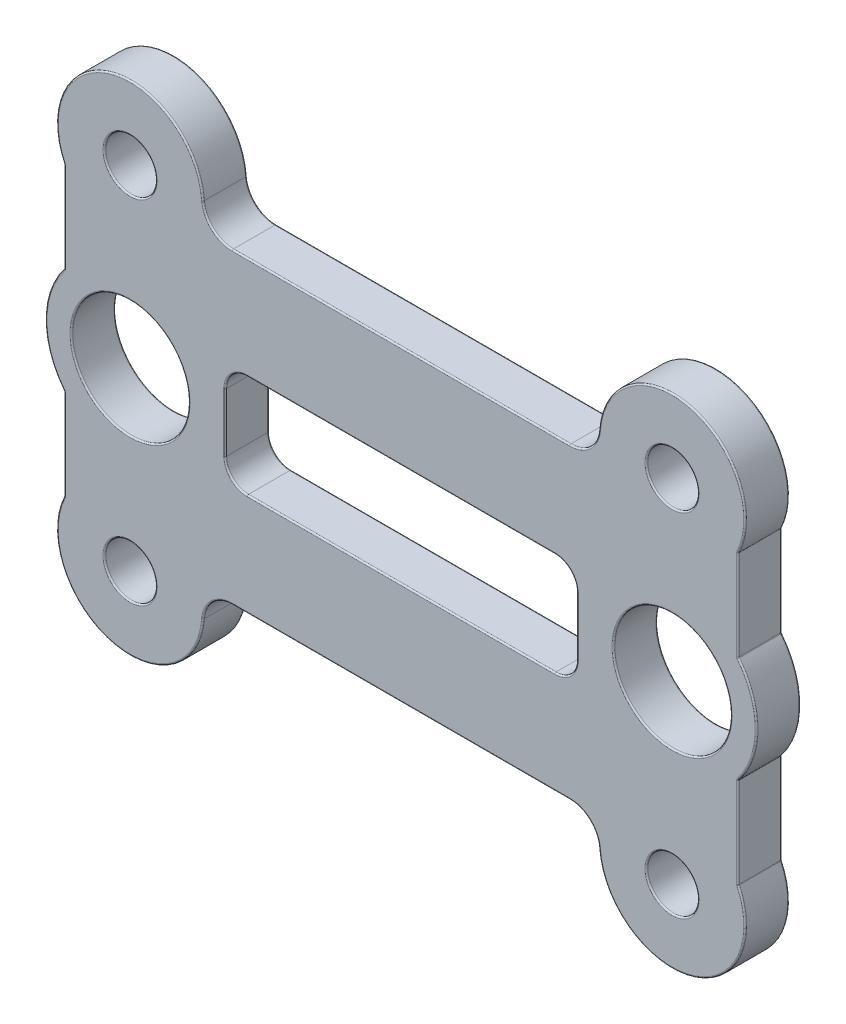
ISO-10303-21;
HEADER;
FILE_DESCRIPTION(('STEP AP214'),'2;1');
FILE_NAME('part.step','',(''),(''),'','','');
FILE_SCHEMA(('AUTOMOTIVE_DESIGN { 1 0 10303 214 1 1 1 1 }'));
ENDSEC;
DATA;
#1=APPLICATION_CONTEXT('core data for automotive mechanical design processes');
#2=APPLICATION_PROTOCOL_DEFINITION('international standard','automotive_design',2000,#1);
#3=PRODUCT_CONTEXT('',#1,'mechanical');
#4=PRODUCT('Part','Part','',(#3));
#5=PRODUCT_RELATED_PRODUCT_CATEGORY('part','',(#4));
#6=PRODUCT_DEFINITION_FORMATION('','',#4);
#7=PRODUCT_DEFINITION_CONTEXT('part definition',#1,'design');
#8=PRODUCT_DEFINITION('design','',#6,#7);
#9=PRODUCT_DEFINITION_SHAPE('','',#8);
#10=(LENGTH_UNIT() NAMED_UNIT(*) SI_UNIT(.MILLI.,.METRE.));
#11=(NAMED_UNIT(*) PLANE_ANGLE_UNIT() SI_UNIT($,.RADIAN.));
#12=(NAMED_UNIT(*) SI_UNIT($,.STERADIAN.) SOLID_ANGLE_UNIT());
#13=UNCERTAINTY_MEASURE_WITH_UNIT(LENGTH_MEASURE(1.E-05),#10,'distance_accuracy_value','');
#14=(GEOMETRIC_REPRESENTATION_CONTEXT(3) GLOBAL_UNCERTAINTY_ASSIGNED_CONTEXT((#13)) GLOBAL_UNIT_ASSIGNED_CONTEXT((#10,
#11,#12)) REPRESENTATION_CONTEXT('',''));
#15=CARTESIAN_POINT('',(0.,0.,0.));
#16=DIRECTION('',(0.,0.,1.));
#17=DIRECTION('',(1.,0.,0.));
#18=AXIS2_PLACEMENT_3D('',#15,#16,#17);
#19=CARTESIAN_POINT('',(23.,9.82055052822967,3.));
#20=DIRECTION('',(-1.,0.,0.));
#21=DIRECTION('',(0.,-1.,0.));
#22=AXIS2_PLACEMENT_3D('',#19,#20,#21);
#23=PLANE('',#22);
#24=DIRECTION('',(0.,0.,1.));
#25=VECTOR('',#24,1.);
#26=CARTESIAN_POINT('',(23.,-3.65289492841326,3.));
#27=LINE('',#26,#25);
#28=CARTESIAN_POINT('',(23.,-3.65289492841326,0.0999999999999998));
#29=VERTEX_POINT('',#28);
#30=CARTESIAN_POINT('',(23.,-3.65289492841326,2.9));
#31=VERTEX_POINT('',#30);
#32=EDGE_CURVE('E703',#29,#31,#27,.T.);
#33=ORIENTED_EDGE('',*,*,#32,.T.);
#34=DIRECTION('',(0.,1.,0.));
#35=VECTOR('',#34,1.);
#36=CARTESIAN_POINT('',(23.,-9.82055052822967,2.9));
#37=LINE('',#36,#35);
#38=CARTESIAN_POINT('',(23.,-9.79772844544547,2.9));
#39=VERTEX_POINT('',#38);
#40=EDGE_CURVE('E708',#31,#39,#37,.F.);
#41=ORIENTED_EDGE('',*,*,#40,.T.);
#42=DIRECTION('',(0.,0.,-1.));
#43=VECTOR('',#42,1.);
#44=CARTESIAN_POINT('',(23.,-9.79772844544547,3.));
#45=LINE('',#44,#43);
#46=CARTESIAN_POINT('',(23.,-9.79772844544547,0.0999999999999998));
#47=VERTEX_POINT('',#46);
#48=EDGE_CURVE('E705',#39,#47,#45,.T.);
#49=ORIENTED_EDGE('',*,*,#48,.T.);
#50=DIRECTION('',(0.,1.,0.));
#51=VECTOR('',#50,1.);
#52=CARTESIAN_POINT('',(23.,9.82055052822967,0.0999999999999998));
#53=LINE('',#52,#51);
#54=EDGE_CURVE('E701',#47,#29,#53,.T.);
#55=ORIENTED_EDGE('',*,*,#54,.T.);
#56=EDGE_LOOP('',(#33,#41,#49,#55));
#57=FACE_BOUND('',#56,.T.);
#58=ADVANCED_FACE('F32',(#57),#23,.F.);
#59=CARTESIAN_POINT('',(-23.,9.82055052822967,3.));
#60=DIRECTION('',(1.,0.,0.));
#61=DIRECTION('',(0.,1.,0.));
#62=AXIS2_PLACEMENT_3D('',#59,#60,#61);
#63=PLANE('',#62);
#64=DIRECTION('',(0.,0.,1.));
#65=VECTOR('',#64,1.);
#66=CARTESIAN_POINT('',(-23.,3.65289492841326,3.));
#67=LINE('',#66,#65);
#68=CARTESIAN_POINT('',(-23.,3.65289492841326,0.0999999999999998));
#69=VERTEX_POINT('',#68);
#70=CARTESIAN_POINT('',(-23.,3.65289492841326,2.9));
#71=VERTEX_POINT('',#70);
#72=EDGE_CURVE('E719',#69,#71,#67,.T.);
#73=ORIENTED_EDGE('',*,*,#72,.T.);
#74=DIRECTION('',(0.,-1.,0.));
#75=VECTOR('',#74,1.);
#76=CARTESIAN_POINT('',(-23.,9.82055052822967,2.9));
#77=LINE('',#76,#75);
#78=CARTESIAN_POINT('',(-23.,9.79772844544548,2.9));
#79=VERTEX_POINT('',#78);
#80=EDGE_CURVE('E724',#71,#79,#77,.F.);
#81=ORIENTED_EDGE('',*,*,#80,.T.);
#82=DIRECTION('',(0.,0.,1.));
#83=VECTOR('',#82,1.);
#84=CARTESIAN_POINT('',(-23.,9.79772844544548,0.));
#85=LINE('',#84,#83);
#86=CARTESIAN_POINT('',(-23.,9.79772844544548,0.0999999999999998));
#87=VERTEX_POINT('',#86);
#88=EDGE_CURVE('E721',#79,#87,#85,.F.);
#89=ORIENTED_EDGE('',*,*,#88,.T.);
#90=DIRECTION('',(0.,-1.,0.));
#91=VECTOR('',#90,1.);
#92=CARTESIAN_POINT('',(-23.,9.82055052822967,0.0999999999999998));
#93=LINE('',#92,#91);
#94=EDGE_CURVE('E717',#87,#69,#93,.T.);
#95=ORIENTED_EDGE('',*,*,#94,.T.);
#96=EDGE_LOOP('',(#73,#81,#89,#95));
#97=FACE_BOUND('',#96,.T.);
#98=ADVANCED_FACE('F1047',(#97),#63,.F.);
#99=CARTESIAN_POINT('',(-18.5,12.,3.));
#100=DIRECTION('',(0.,0.,1.));
#101=DIRECTION('',(1.,0.,0.));
#102=AXIS2_PLACEMENT_3D('',#99,#100,#101);
#103=PLANE('',#102);
#104=CARTESIAN_POINT('',(-18.5,-12.,3.));
#105=DIRECTION('',(0.,0.,1.));
#106=DIRECTION('',(1.,0.,0.));
#107=AXIS2_PLACEMENT_3D('',#104,#105,#106);
#108=CIRCLE('',#107,1.85);
#109=CARTESIAN_POINT('',(-16.65,-12.,3.));
#110=VERTEX_POINT('',#109);
#111=EDGE_CURVE('E844',#110,#110,#108,.F.);
#112=ORIENTED_EDGE('',*,*,#111,.T.);
#113=EDGE_LOOP('',(#112));
#114=FACE_BOUND('',#113,.T.);
#115=CARTESIAN_POINT('',(18.5,-12.,3.));
#116=DIRECTION('',(0.,0.,1.));
#117=DIRECTION('',(1.,0.,0.));
#118=AXIS2_PLACEMENT_3D('',#115,#116,#117);
#119=CIRCLE('',#118,1.85);
#120=CARTESIAN_POINT('',(20.35,-12.,3.));
#121=VERTEX_POINT('',#120);
#122=EDGE_CURVE('E841',#121,#121,#119,.F.);
#123=ORIENTED_EDGE('',*,*,#122,.T.);
#124=EDGE_LOOP('',(#123));
#125=FACE_BOUND('',#124,.T.);
#126=CARTESIAN_POINT('',(18.5,12.,3.));
#127=DIRECTION('',(0.,0.,1.));
#128=DIRECTION('',(1.,0.,0.));
#129=AXIS2_PLACEMENT_3D('',#126,#127,#128);
#130=CIRCLE('',#129,1.85);
#131=CARTESIAN_POINT('',(20.35,12.,3.));
#132=VERTEX_POINT('',#131);
#133=EDGE_CURVE('E838',#132,#132,#130,.F.);
#134=ORIENTED_EDGE('',*,*,#133,.T.);
#135=EDGE_LOOP('',(#134));
#136=FACE_BOUND('',#135,.T.);
#137=CARTESIAN_POINT('',(-18.5,12.,3.));
#138=DIRECTION('',(0.,0.,1.));
#139=DIRECTION('',(1.,0.,0.));
#140=AXIS2_PLACEMENT_3D('',#137,#138,#139);
#141=CIRCLE('',#140,1.85);
#142=CARTESIAN_POINT('',(-16.65,12.,3.));
#143=VERTEX_POINT('',#142);
#144=EDGE_CURVE('E835',#143,#143,#141,.F.);
#145=ORIENTED_EDGE('',*,*,#144,.T.);
#146=EDGE_LOOP('',(#145));
#147=FACE_BOUND('',#146,.T.);
#148=CARTESIAN_POINT('',(-23.1,-3.65289492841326,3.));
#149=DIRECTION('',(0.,0.,1.));
#150=DIRECTION('',(1.,0.,0.));
#151=AXIS2_PLACEMENT_3D('',#148,#149,#150);
#152=CIRCLE('',#151,0.2);
#153=CARTESIAN_POINT('',(-22.9,-3.65289492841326,3.));
#154=VERTEX_POINT('',#153);
#155=CARTESIAN_POINT('',(-22.9433770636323,-3.5285194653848,3.));
#156=VERTEX_POINT('',#155);
#157=EDGE_CURVE('E827',#154,#156,#152,.T.);
#158=ORIENTED_EDGE('',*,*,#157,.F.);
#159=DIRECTION('',(0.,-1.,0.));
#160=VECTOR('',#159,1.);
#161=CARTESIAN_POINT('',(-22.9,-9.82055052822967,3.));
#162=LINE('',#161,#160);
#163=CARTESIAN_POINT('',(-22.9,-9.79772844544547,3.));
#164=VERTEX_POINT('',#163);
#165=EDGE_CURVE('E833',#154,#164,#162,.T.);
#166=ORIENTED_EDGE('',*,*,#165,.T.);
#167=CARTESIAN_POINT('',(-23.1,-9.79772844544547,3.));
#168=DIRECTION('',(0.,0.,1.));
#169=DIRECTION('',(1.,0.,0.));
#170=AXIS2_PLACEMENT_3D('',#167,#168,#169);
#171=CIRCLE('',#170,0.2);
#172=CARTESIAN_POINT('',(-22.9196078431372,-9.88409203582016,3.));
#173=VERTEX_POINT('',#172);
#174=EDGE_CURVE('E830',#173,#164,#171,.T.);
#175=ORIENTED_EDGE('',*,*,#174,.F.);
#176=CARTESIAN_POINT('',(-18.5,-12.,3.));
#177=DIRECTION('',(0.,0.,1.));
#178=DIRECTION('',(1.,0.,0.));
#179=AXIS2_PLACEMENT_3D('',#176,#177,#178);
#180=CIRCLE('',#179,4.9);
#181=CARTESIAN_POINT('',(-13.6125159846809,-12.35,3.));
#182=VERTEX_POINT('',#181);
#183=EDGE_CURVE('E825',#173,#182,#180,.T.);
#184=ORIENTED_EDGE('',*,*,#183,.T.);
#185=CARTESIAN_POINT('',(-11.5178799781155,-12.5,3.));
#186=DIRECTION('',(0.,0.,1.));
#187=DIRECTION('',(1.,0.,0.));
#188=AXIS2_PLACEMENT_3D('',#185,#186,#187);
#189=CIRCLE('',#188,2.1);
#190=CARTESIAN_POINT('',(-11.5178799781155,-10.4,3.));
#191=VERTEX_POINT('',#190);
#192=EDGE_CURVE('E818',#182,#191,#189,.F.);
#193=ORIENTED_EDGE('',*,*,#192,.T.);
#194=DIRECTION('',(-1.,0.,0.));
#195=VECTOR('',#194,1.);
#196=CARTESIAN_POINT('',(-18.5,-10.4,3.));
#197=LINE('',#196,#195);
#198=CARTESIAN_POINT('',(11.5178799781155,-10.4,3.));
#199=VERTEX_POINT('',#198);
#200=EDGE_CURVE('E811',#191,#199,#197,.F.);
#201=ORIENTED_EDGE('',*,*,#200,.T.);
#202=CARTESIAN_POINT('',(11.5178799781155,-12.5,3.));
#203=DIRECTION('',(0.,0.,1.));
#204=DIRECTION('',(1.,0.,0.));
#205=AXIS2_PLACEMENT_3D('',#202,#203,#204);
#206=CIRCLE('',#205,2.1);
#207=CARTESIAN_POINT('',(13.6125159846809,-12.35,3.));
#208=VERTEX_POINT('',#207);
#209=EDGE_CURVE('E796',#199,#208,#206,.F.);
#210=ORIENTED_EDGE('',*,*,#209,.T.);
#211=CARTESIAN_POINT('',(18.5,-12.,3.));
#212=DIRECTION('',(0.,0.,1.));
#213=DIRECTION('',(1.,0.,0.));
#214=AXIS2_PLACEMENT_3D('',#211,#212,#213);
#215=CIRCLE('',#214,4.9);
#216=CARTESIAN_POINT('',(22.9196078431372,-9.88409203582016,3.));
#217=VERTEX_POINT('',#216);
#218=EDGE_CURVE('E788',#208,#217,#215,.T.);
#219=ORIENTED_EDGE('',*,*,#218,.T.);
#220=CARTESIAN_POINT('',(23.1,-9.79772844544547,3.));
#221=DIRECTION('',(0.,0.,1.));
#222=DIRECTION('',(1.,0.,0.));
#223=AXIS2_PLACEMENT_3D('',#220,#221,#222);
#224=CIRCLE('',#223,0.2);
#225=CARTESIAN_POINT('',(22.9,-9.79772844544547,3.));
#226=VERTEX_POINT('',#225);
#227=EDGE_CURVE('E786',#226,#217,#224,.T.);
#228=ORIENTED_EDGE('',*,*,#227,.F.);
#229=DIRECTION('',(0.,1.,0.));
#230=VECTOR('',#229,1.);
#231=CARTESIAN_POINT('',(22.9,-3.61785093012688,3.));
#232=LINE('',#231,#230);
#233=CARTESIAN_POINT('',(22.9,-3.65289492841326,3.));
#234=VERTEX_POINT('',#233);
#235=EDGE_CURVE('E782',#226,#234,#232,.T.);
#236=ORIENTED_EDGE('',*,*,#235,.T.);
#237=CARTESIAN_POINT('',(23.1,-3.65289492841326,3.));
#238=DIRECTION('',(0.,0.,1.));
#239=DIRECTION('',(1.,0.,0.));
#240=AXIS2_PLACEMENT_3D('',#237,#238,#239);
#241=CIRCLE('',#240,0.2);
#242=CARTESIAN_POINT('',(22.9433770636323,-3.5285194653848,3.));
#243=VERTEX_POINT('',#242);
#244=EDGE_CURVE('E779',#243,#234,#241,.T.);
#245=ORIENTED_EDGE('',*,*,#244,.F.);
#246=CARTESIAN_POINT('',(18.5,0.,3.));
#247=DIRECTION('',(0.,0.,1.));
#248=DIRECTION('',(1.,0.,0.));
#249=AXIS2_PLACEMENT_3D('',#246,#247,#248);
#250=CIRCLE('',#249,5.67398002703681);
#251=CARTESIAN_POINT('',(22.9433770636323,3.5285194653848,3.));
#252=VERTEX_POINT('',#251);
#253=EDGE_CURVE('E784',#243,#252,#250,.T.);
#254=ORIENTED_EDGE('',*,*,#253,.T.);
#255=CARTESIAN_POINT('',(23.1,3.65289492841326,3.));
#256=DIRECTION('',(0.,0.,1.));
#257=DIRECTION('',(1.,0.,0.));
#258=AXIS2_PLACEMENT_3D('',#255,#256,#257);
#259=CIRCLE('',#258,0.2);
#260=CARTESIAN_POINT('',(22.9,3.65289492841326,3.));
#261=VERTEX_POINT('',#260);
#262=EDGE_CURVE('E791',#261,#252,#259,.T.);
#263=ORIENTED_EDGE('',*,*,#262,.F.);
#264=DIRECTION('',(0.,1.,0.));
#265=VECTOR('',#264,1.);
#266=CARTESIAN_POINT('',(22.9,9.82055052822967,3.));
#267=LINE('',#266,#265);
#268=CARTESIAN_POINT('',(22.9,9.79772844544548,3.));
#269=VERTEX_POINT('',#268);
#270=EDGE_CURVE('E794',#261,#269,#267,.T.);
#271=ORIENTED_EDGE('',*,*,#270,.T.);
#272=CARTESIAN_POINT('',(23.1,9.79772844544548,3.));
#273=DIRECTION('',(0.,0.,1.));
#274=DIRECTION('',(1.,0.,0.));
#275=AXIS2_PLACEMENT_3D('',#272,#273,#274);
#276=CIRCLE('',#275,0.2);
#277=CARTESIAN_POINT('',(22.9196078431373,9.88409203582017,3.));
#278=VERTEX_POINT('',#277);
#279=EDGE_CURVE('E798',#278,#269,#276,.T.);
#280=ORIENTED_EDGE('',*,*,#279,.F.);
#281=CARTESIAN_POINT('',(18.5,12.,3.));
#282=DIRECTION('',(0.,0.,1.));
#283=DIRECTION('',(1.,0.,0.));
#284=AXIS2_PLACEMENT_3D('',#281,#282,#283);
#285=CIRCLE('',#284,4.9);
#286=CARTESIAN_POINT('',(13.6125159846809,12.35,3.));
#287=VERTEX_POINT('',#286);
#288=EDGE_CURVE('E801',#278,#287,#285,.T.);
#289=ORIENTED_EDGE('',*,*,#288,.T.);
#290=CARTESIAN_POINT('',(11.5178799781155,12.5,3.));
#291=DIRECTION('',(0.,0.,1.));
#292=DIRECTION('',(1.,0.,0.));
#293=AXIS2_PLACEMENT_3D('',#290,#291,#292);
#294=CIRCLE('',#293,2.1);
#295=CARTESIAN_POINT('',(11.5178799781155,10.4,3.));
#296=VERTEX_POINT('',#295);
#297=EDGE_CURVE('E803',#287,#296,#294,.F.);
#298=ORIENTED_EDGE('',*,*,#297,.T.);
#299=DIRECTION('',(-1.,0.,0.));
#300=VECTOR('',#299,1.);
#301=CARTESIAN_POINT('',(-11.5178799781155,10.4,3.));
#302=LINE('',#301,#300);
#303=CARTESIAN_POINT('',(-11.5178799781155,10.4,3.));
#304=VERTEX_POINT('',#303);
#305=EDGE_CURVE('E805',#296,#304,#302,.T.);
#306=ORIENTED_EDGE('',*,*,#305,.T.);
#307=CARTESIAN_POINT('',(-11.5178799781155,12.5,3.));
#308=DIRECTION('',(0.,0.,1.));
#309=DIRECTION('',(1.,0.,0.));
#310=AXIS2_PLACEMENT_3D('',#307,#308,#309);
#311=CIRCLE('',#310,2.1);
#312=CARTESIAN_POINT('',(-13.6125159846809,12.35,3.));
#313=VERTEX_POINT('',#312);
#314=EDGE_CURVE('E807',#304,#313,#311,.F.);
#315=ORIENTED_EDGE('',*,*,#314,.T.);
#316=CARTESIAN_POINT('',(-18.5,12.,3.));
#317=DIRECTION('',(0.,0.,1.));
#318=DIRECTION('',(1.,0.,0.));
#319=AXIS2_PLACEMENT_3D('',#316,#317,#318);
#320=CIRCLE('',#319,4.9);
#321=CARTESIAN_POINT('',(-22.9196078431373,9.88409203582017,3.));
#322=VERTEX_POINT('',#321);
#323=EDGE_CURVE('E809',#313,#322,#320,.T.);
#324=ORIENTED_EDGE('',*,*,#323,.T.);
#325=CARTESIAN_POINT('',(-23.1,9.79772844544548,3.));
#326=DIRECTION('',(0.,0.,1.));
#327=DIRECTION('',(1.,0.,0.));
#328=AXIS2_PLACEMENT_3D('',#325,#326,#327);
#329=CIRCLE('',#328,0.2);
#330=CARTESIAN_POINT('',(-22.9,9.79772844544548,3.));
#331=VERTEX_POINT('',#330);
#332=EDGE_CURVE('E813',#331,#322,#329,.T.);
#333=ORIENTED_EDGE('',*,*,#332,.F.);
#334=DIRECTION('',(0.,-1.,0.));
#335=VECTOR('',#334,1.);
#336=CARTESIAN_POINT('',(-22.9,3.61785093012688,3.));
#337=LINE('',#336,#335);
#338=CARTESIAN_POINT('',(-22.9,3.65289492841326,3.));
#339=VERTEX_POINT('',#338);
#340=EDGE_CURVE('E816',#331,#339,#337,.T.);
#341=ORIENTED_EDGE('',*,*,#340,.T.);
#342=CARTESIAN_POINT('',(-23.1,3.65289492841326,3.));
#343=DIRECTION('',(0.,0.,1.));
#344=DIRECTION('',(1.,0.,0.));
#345=AXIS2_PLACEMENT_3D('',#342,#343,#344);
#346=CIRCLE('',#345,0.2);
#347=CARTESIAN_POINT('',(-22.9433770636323,3.5285194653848,3.));
#348=VERTEX_POINT('',#347);
#349=EDGE_CURVE('E820',#348,#339,#346,.T.);
#350=ORIENTED_EDGE('',*,*,#349,.F.);
#351=CARTESIAN_POINT('',(-18.5,0.,3.));
#352=DIRECTION('',(0.,0.,1.));
#353=DIRECTION('',(1.,0.,0.));
#354=AXIS2_PLACEMENT_3D('',#351,#352,#353);
#355=CIRCLE('',#354,5.67398002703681);
#356=EDGE_CURVE('E823',#348,#156,#355,.T.);
#357=ORIENTED_EDGE('',*,*,#356,.T.);
#358=EDGE_LOOP('',(#158,#166,#175,#184,#193,#201,#210,#219,#228,#236,#245,#254,#263,#271,#280,
#289,#298,#306,#315,#324,#333,#341,#350,#357));
#359=FACE_BOUND('',#358,.T.);
#360=CARTESIAN_POINT('',(18.5,0.,3.));
#361=DIRECTION('',(0.,0.,1.));
#362=DIRECTION('',(1.,0.,0.));
#363=AXIS2_PLACEMENT_3D('',#360,#361,#362);
#364=CIRCLE('',#363,4.1);
#365=CARTESIAN_POINT('',(22.6,0.,3.));
#366=VERTEX_POINT('',#365);
#367=EDGE_CURVE('E776',#366,#366,#364,.F.);
#368=ORIENTED_EDGE('',*,*,#367,.T.);
#369=EDGE_LOOP('',(#368));
#370=FACE_BOUND('',#369,.T.);
#371=CARTESIAN_POINT('',(-18.5,0.,3.));
#372=DIRECTION('',(0.,0.,1.));
#373=DIRECTION('',(1.,0.,0.));
#374=AXIS2_PLACEMENT_3D('',#371,#372,#373);
#375=CIRCLE('',#374,4.1);
#376=CARTESIAN_POINT('',(-14.4,0.,3.));
#377=VERTEX_POINT('',#376);
#378=EDGE_CURVE('E773',#377,#377,#375,.F.);
#379=ORIENTED_EDGE('',*,*,#378,.T.);
#380=EDGE_LOOP('',(#379));
#381=FACE_BOUND('',#380,.T.);
#382=DIRECTION('',(1.,0.,0.));
#383=VECTOR('',#382,1.);
#384=CARTESIAN_POINT('',(-10.5,-3.6,3.));
#385=LINE('',#384,#383);
#386=CARTESIAN_POINT('',(10.5,-3.6,3.));
#387=VERTEX_POINT('',#386);
#388=CARTESIAN_POINT('',(-10.5,-3.6,3.));
#389=VERTEX_POINT('',#388);
#390=EDGE_CURVE('E768',#387,#389,#385,.F.);
#391=ORIENTED_EDGE('',*,*,#390,.T.);
#392=CARTESIAN_POINT('',(-10.5,-2.,3.));
#393=DIRECTION('',(0.,0.,1.));
#394=DIRECTION('',(1.,0.,0.));
#395=AXIS2_PLACEMENT_3D('',#392,#393,#394);
#396=CIRCLE('',#395,1.6);
#397=CARTESIAN_POINT('',(-12.1,-2.,3.));
#398=VERTEX_POINT('',#397);
#399=EDGE_CURVE('E770',#389,#398,#396,.F.);
#400=ORIENTED_EDGE('',*,*,#399,.T.);
#401=DIRECTION('',(0.,-1.,0.));
#402=VECTOR('',#401,1.);
#403=CARTESIAN_POINT('',(-12.1,2.,3.));
#404=LINE('',#403,#402);
#405=CARTESIAN_POINT('',(-12.1,2.,3.));
#406=VERTEX_POINT('',#405);
#407=EDGE_CURVE('E756',#398,#406,#404,.F.);
#408=ORIENTED_EDGE('',*,*,#407,.T.);
#409=CARTESIAN_POINT('',(-10.5,2.,3.));
#410=DIRECTION('',(0.,0.,1.));
#411=DIRECTION('',(1.,0.,0.));
#412=AXIS2_PLACEMENT_3D('',#409,#410,#411);
#413=CIRCLE('',#412,1.6);
#414=CARTESIAN_POINT('',(-10.5,3.6,3.));
#415=VERTEX_POINT('',#414);
#416=EDGE_CURVE('E758',#406,#415,#413,.F.);
#417=ORIENTED_EDGE('',*,*,#416,.T.);
#418=DIRECTION('',(-1.,0.,0.));
#419=VECTOR('',#418,1.);
#420=CARTESIAN_POINT('',(10.5,3.6,3.));
#421=LINE('',#420,#419);
#422=CARTESIAN_POINT('',(10.5,3.6,3.));
#423=VERTEX_POINT('',#422);
#424=EDGE_CURVE('E760',#415,#423,#421,.F.);
#425=ORIENTED_EDGE('',*,*,#424,.T.);
#426=CARTESIAN_POINT('',(10.5,2.,3.));
#427=DIRECTION('',(0.,0.,1.));
#428=DIRECTION('',(1.,0.,0.));
#429=AXIS2_PLACEMENT_3D('',#426,#427,#428);
#430=CIRCLE('',#429,1.6);
#431=CARTESIAN_POINT('',(12.1,2.,3.));
#432=VERTEX_POINT('',#431);
#433=EDGE_CURVE('E762',#423,#432,#430,.F.);
#434=ORIENTED_EDGE('',*,*,#433,.T.);
#435=DIRECTION('',(0.,1.,0.));
#436=VECTOR('',#435,1.);
#437=CARTESIAN_POINT('',(12.1,-2.,3.));
#438=LINE('',#437,#436);
#439=CARTESIAN_POINT('',(12.1,-2.,3.));
#440=VERTEX_POINT('',#439);
#441=EDGE_CURVE('E764',#432,#440,#438,.F.);
#442=ORIENTED_EDGE('',*,*,#441,.T.);
#443=CARTESIAN_POINT('',(10.5,-2.,3.));
#444=DIRECTION('',(0.,0.,1.));
#445=DIRECTION('',(1.,0.,0.));
#446=AXIS2_PLACEMENT_3D('',#443,#444,#445);
#447=CIRCLE('',#446,1.6);
#448=EDGE_CURVE('E766',#440,#387,#447,.F.);
#449=ORIENTED_EDGE('',*,*,#448,.T.);
#450=EDGE_LOOP('',(#391,#400,#408,#417,#425,#434,#442,#449));
#451=FACE_BOUND('',#450,.T.);
#452=ADVANCED_FACE('F1054',(#114,#125,#136,#147,#359,#370,#381,#451),#103,.T.);
#453=CARTESIAN_POINT('',(-18.5,12.,0.));
#454=DIRECTION('',(0.,0.,1.));
#455=DIRECTION('',(1.,0.,0.));
#456=AXIS2_PLACEMENT_3D('',#453,#454,#455);
#457=PLANE('',#456);
#458=CARTESIAN_POINT('',(-18.5,-12.,0.));
#459=DIRECTION('',(0.,0.,1.));
#460=DIRECTION('',(1.,0.,0.));
#461=AXIS2_PLACEMENT_3D('',#458,#459,#460);
#462=CIRCLE('',#461,1.85);
#463=CARTESIAN_POINT('',(-16.65,-12.,0.));
#464=VERTEX_POINT('',#463);
#465=EDGE_CURVE('E11',#464,#464,#462,.T.);
#466=ORIENTED_EDGE('',*,*,#465,.T.);
#467=EDGE_LOOP('',(#466));
#468=FACE_BOUND('',#467,.T.);
#469=CARTESIAN_POINT('',(18.5,-12.,0.));
#470=DIRECTION('',(0.,0.,1.));
#471=DIRECTION('',(1.,0.,0.));
#472=AXIS2_PLACEMENT_3D('',#469,#470,#471);
#473=CIRCLE('',#472,1.85);
#474=CARTESIAN_POINT('',(20.35,-12.,0.));
#475=VERTEX_POINT('',#474);
#476=EDGE_CURVE('E40',#475,#475,#473,.T.);
#477=ORIENTED_EDGE('',*,*,#476,.T.);
#478=EDGE_LOOP('',(#477));
#479=FACE_BOUND('',#478,.T.);
#480=CARTESIAN_POINT('',(18.5,12.,0.));
#481=DIRECTION('',(0.,0.,1.));
#482=DIRECTION('',(1.,0.,0.));
#483=AXIS2_PLACEMENT_3D('',#480,#481,#482);
#484=CIRCLE('',#483,1.85);
#485=CARTESIAN_POINT('',(20.35,12.,0.));
#486=VERTEX_POINT('',#485);
#487=EDGE_CURVE('E1014',#486,#486,#484,.T.);
#488=ORIENTED_EDGE('',*,*,#487,.T.);
#489=EDGE_LOOP('',(#488));
#490=FACE_BOUND('',#489,.T.);
#491=CARTESIAN_POINT('',(-23.1,3.65289492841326,0.));
#492=DIRECTION('',(0.,0.,1.));
#493=DIRECTION('',(1.,0.,0.));
#494=AXIS2_PLACEMENT_3D('',#491,#492,#493);
#495=CIRCLE('',#494,0.2);
#496=CARTESIAN_POINT('',(-22.9,3.65289492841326,0.));
#497=VERTEX_POINT('',#496);
#498=CARTESIAN_POINT('',(-22.9433770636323,3.5285194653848,0.));
#499=VERTEX_POINT('',#498);
#500=EDGE_CURVE('E52',#497,#499,#495,.F.);
#501=ORIENTED_EDGE('',*,*,#500,.F.);
#502=DIRECTION('',(0.,-1.,0.));
#503=VECTOR('',#502,1.);
#504=CARTESIAN_POINT('',(-22.9,12.,0.));
#505=LINE('',#504,#503);
#506=CARTESIAN_POINT('',(-22.9,9.79772844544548,0.));
#507=VERTEX_POINT('',#506);
#508=EDGE_CURVE('E47',#497,#507,#505,.F.);
#509=ORIENTED_EDGE('',*,*,#508,.T.);
#510=CARTESIAN_POINT('',(-23.1,9.79772844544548,0.));
#511=DIRECTION('',(0.,0.,1.));
#512=DIRECTION('',(1.,0.,0.));
#513=AXIS2_PLACEMENT_3D('',#510,#511,#512);
#514=CIRCLE('',#513,0.2);
#515=CARTESIAN_POINT('',(-22.9196078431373,9.88409203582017,0.));
#516=VERTEX_POINT('',#515);
#517=EDGE_CURVE('E1010',#516,#507,#514,.F.);
#518=ORIENTED_EDGE('',*,*,#517,.F.);
#519=CARTESIAN_POINT('',(-18.5,12.,0.));
#520=DIRECTION('',(0.,0.,1.));
#521=DIRECTION('',(1.,0.,0.));
#522=AXIS2_PLACEMENT_3D('',#519,#520,#521);
#523=CIRCLE('',#522,4.9);
#524=CARTESIAN_POINT('',(-13.6125159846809,12.35,0.));
#525=VERTEX_POINT('',#524);
#526=EDGE_CURVE('E1007',#516,#525,#523,.F.);
#527=ORIENTED_EDGE('',*,*,#526,.T.);
#528=CARTESIAN_POINT('',(-11.5178799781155,12.5,0.));
#529=DIRECTION('',(0.,0.,1.));
#530=DIRECTION('',(1.,0.,0.));
#531=AXIS2_PLACEMENT_3D('',#528,#529,#530);
#532=CIRCLE('',#531,2.1);
#533=CARTESIAN_POINT('',(-11.5178799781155,10.4,0.));
#534=VERTEX_POINT('',#533);
#535=EDGE_CURVE('E1000',#525,#534,#532,.T.);
#536=ORIENTED_EDGE('',*,*,#535,.T.);
#537=DIRECTION('',(-1.,0.,0.));
#538=VECTOR('',#537,1.);
#539=CARTESIAN_POINT('',(-18.5,10.4,0.));
#540=LINE('',#539,#538);
#541=CARTESIAN_POINT('',(11.5178799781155,10.4,0.));
#542=VERTEX_POINT('',#541);
#543=EDGE_CURVE('E993',#534,#542,#540,.F.);
#544=ORIENTED_EDGE('',*,*,#543,.T.);
#545=CARTESIAN_POINT('',(11.5178799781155,12.5,0.));
#546=DIRECTION('',(0.,0.,1.));
#547=DIRECTION('',(1.,0.,0.));
#548=AXIS2_PLACEMENT_3D('',#545,#546,#547);
#549=CIRCLE('',#548,2.1);
#550=CARTESIAN_POINT('',(13.6125159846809,12.35,0.));
#551=VERTEX_POINT('',#550);
#552=EDGE_CURVE('E978',#542,#551,#549,.T.);
#553=ORIENTED_EDGE('',*,*,#552,.T.);
#554=CARTESIAN_POINT('',(18.5,12.,0.));
#555=DIRECTION('',(0.,0.,1.));
#556=DIRECTION('',(1.,0.,0.));
#557=AXIS2_PLACEMENT_3D('',#554,#555,#556);
#558=CIRCLE('',#557,4.9);
#559=CARTESIAN_POINT('',(22.9196078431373,9.88409203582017,0.));
#560=VERTEX_POINT('',#559);
#561=EDGE_CURVE('E469',#551,#560,#558,.F.);
#562=ORIENTED_EDGE('',*,*,#561,.T.);
#563=CARTESIAN_POINT('',(23.1,9.79772844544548,0.));
#564=DIRECTION('',(0.,0.,1.));
#565=DIRECTION('',(1.,0.,0.));
#566=AXIS2_PLACEMENT_3D('',#563,#564,#565);
#567=CIRCLE('',#566,0.2);
#568=CARTESIAN_POINT('',(22.9,9.79772844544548,0.));
#569=VERTEX_POINT('',#568);
#570=EDGE_CURVE('E970',#569,#560,#567,.F.);
#571=ORIENTED_EDGE('',*,*,#570,.F.);
#572=DIRECTION('',(0.,1.,0.));
#573=VECTOR('',#572,1.);
#574=CARTESIAN_POINT('',(22.9,12.,0.));
#575=LINE('',#574,#573);
#576=CARTESIAN_POINT('',(22.9,3.65289492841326,0.));
#577=VERTEX_POINT('',#576);
#578=EDGE_CURVE('E966',#569,#577,#575,.F.);
#579=ORIENTED_EDGE('',*,*,#578,.T.);
#580=CARTESIAN_POINT('',(23.1,3.65289492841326,0.));
#581=DIRECTION('',(0.,0.,1.));
#582=DIRECTION('',(1.,0.,0.));
#583=AXIS2_PLACEMENT_3D('',#580,#581,#582);
#584=CIRCLE('',#583,0.2);
#585=CARTESIAN_POINT('',(22.9433770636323,3.5285194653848,0.));
#586=VERTEX_POINT('',#585);
#587=EDGE_CURVE('E963',#586,#577,#584,.F.);
#588=ORIENTED_EDGE('',*,*,#587,.F.);
#589=CARTESIAN_POINT('',(18.5,0.,0.));
#590=DIRECTION('',(0.,0.,1.));
#591=DIRECTION('',(1.,0.,0.));
#592=AXIS2_PLACEMENT_3D('',#589,#590,#591);
#593=CIRCLE('',#592,5.67398002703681);
#594=CARTESIAN_POINT('',(22.9433770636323,-3.5285194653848,0.));
#595=VERTEX_POINT('',#594);
#596=EDGE_CURVE('E968',#586,#595,#593,.F.);
#597=ORIENTED_EDGE('',*,*,#596,.T.);
#598=CARTESIAN_POINT('',(23.1,-3.65289492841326,0.));
#599=DIRECTION('',(0.,0.,1.));
#600=DIRECTION('',(1.,0.,0.));
#601=AXIS2_PLACEMENT_3D('',#598,#599,#600);
#602=CIRCLE('',#601,0.2);
#603=CARTESIAN_POINT('',(22.9,-3.65289492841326,0.));
#604=VERTEX_POINT('',#603);
#605=EDGE_CURVE('E973',#604,#595,#602,.F.);
#606=ORIENTED_EDGE('',*,*,#605,.F.);
#607=DIRECTION('',(0.,1.,0.));
#608=VECTOR('',#607,1.);
#609=CARTESIAN_POINT('',(22.9,12.,0.));
#610=LINE('',#609,#608);
#611=CARTESIAN_POINT('',(22.9,-9.79772844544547,0.));
#612=VERTEX_POINT('',#611);
#613=EDGE_CURVE('E976',#604,#612,#610,.F.);
#614=ORIENTED_EDGE('',*,*,#613,.T.);
#615=CARTESIAN_POINT('',(23.1,-9.79772844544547,0.));
#616=DIRECTION('',(0.,0.,1.));
#617=DIRECTION('',(1.,0.,0.));
#618=AXIS2_PLACEMENT_3D('',#615,#616,#617);
#619=CIRCLE('',#618,0.2);
#620=CARTESIAN_POINT('',(22.9196078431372,-9.88409203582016,0.));
#621=VERTEX_POINT('',#620);
#622=EDGE_CURVE('E980',#621,#612,#619,.F.);
#623=ORIENTED_EDGE('',*,*,#622,.F.);
#624=CARTESIAN_POINT('',(18.5,-12.,0.));
#625=DIRECTION('',(0.,0.,1.));
#626=DIRECTION('',(1.,0.,0.));
#627=AXIS2_PLACEMENT_3D('',#624,#625,#626);
#628=CIRCLE('',#627,4.9);
#629=CARTESIAN_POINT('',(13.6125159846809,-12.35,0.));
#630=VERTEX_POINT('',#629);
#631=EDGE_CURVE('E983',#621,#630,#628,.F.);
#632=ORIENTED_EDGE('',*,*,#631,.T.);
#633=CARTESIAN_POINT('',(11.5178799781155,-12.5,0.));
#634=DIRECTION('',(0.,0.,1.));
#635=DIRECTION('',(1.,0.,0.));
#636=AXIS2_PLACEMENT_3D('',#633,#634,#635);
#637=CIRCLE('',#636,2.1);
#638=CARTESIAN_POINT('',(11.5178799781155,-10.4,0.));
#639=VERTEX_POINT('',#638);
#640=EDGE_CURVE('E985',#630,#639,#637,.T.);
#641=ORIENTED_EDGE('',*,*,#640,.T.);
#642=DIRECTION('',(-1.,0.,0.));
#643=VECTOR('',#642,1.);
#644=CARTESIAN_POINT('',(-11.5178799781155,-10.4,0.));
#645=LINE('',#644,#643);
#646=CARTESIAN_POINT('',(-11.5178799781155,-10.4,0.));
#647=VERTEX_POINT('',#646);
#648=EDGE_CURVE('E987',#639,#647,#645,.T.);
#649=ORIENTED_EDGE('',*,*,#648,.T.);
#650=CARTESIAN_POINT('',(-11.5178799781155,-12.5,0.));
#651=DIRECTION('',(0.,0.,1.));
#652=DIRECTION('',(1.,0.,0.));
#653=AXIS2_PLACEMENT_3D('',#650,#651,#652);
#654=CIRCLE('',#653,2.1);
#655=CARTESIAN_POINT('',(-13.6125159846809,-12.35,0.));
#656=VERTEX_POINT('',#655);
#657=EDGE_CURVE('E989',#647,#656,#654,.T.);
#658=ORIENTED_EDGE('',*,*,#657,.T.);
#659=CARTESIAN_POINT('',(-18.5,-12.,0.));
#660=DIRECTION('',(0.,0.,1.));
#661=DIRECTION('',(1.,0.,0.));
#662=AXIS2_PLACEMENT_3D('',#659,#660,#661);
#663=CIRCLE('',#662,4.9);
#664=CARTESIAN_POINT('',(-22.9196078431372,-9.88409203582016,0.));
#665=VERTEX_POINT('',#664);
#666=EDGE_CURVE('E991',#656,#665,#663,.F.);
#667=ORIENTED_EDGE('',*,*,#666,.T.);
#668=CARTESIAN_POINT('',(-23.1,-9.79772844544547,0.));
#669=DIRECTION('',(0.,0.,1.));
#670=DIRECTION('',(1.,0.,0.));
#671=AXIS2_PLACEMENT_3D('',#668,#669,#670);
#672=CIRCLE('',#671,0.2);
#673=CARTESIAN_POINT('',(-22.9,-9.79772844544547,0.));
#674=VERTEX_POINT('',#673);
#675=EDGE_CURVE('E995',#674,#665,#672,.F.);
#676=ORIENTED_EDGE('',*,*,#675,.F.);
#677=DIRECTION('',(0.,-1.,0.));
#678=VECTOR('',#677,1.);
#679=CARTESIAN_POINT('',(-22.9,12.,0.));
#680=LINE('',#679,#678);
#681=CARTESIAN_POINT('',(-22.9,-3.65289492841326,0.));
#682=VERTEX_POINT('',#681);
#683=EDGE_CURVE('E998',#674,#682,#680,.F.);
#684=ORIENTED_EDGE('',*,*,#683,.T.);
#685=CARTESIAN_POINT('',(-23.1,-3.65289492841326,0.));
#686=DIRECTION('',(0.,0.,1.));
#687=DIRECTION('',(1.,0.,0.));
#688=AXIS2_PLACEMENT_3D('',#685,#686,#687);
#689=CIRCLE('',#688,0.2);
#690=CARTESIAN_POINT('',(-22.9433770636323,-3.5285194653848,0.));
#691=VERTEX_POINT('',#690);
#692=EDGE_CURVE('E1002',#691,#682,#689,.F.);
#693=ORIENTED_EDGE('',*,*,#692,.F.);
#694=CARTESIAN_POINT('',(-18.5,0.,0.));
#695=DIRECTION('',(0.,0.,1.));
#696=DIRECTION('',(1.,0.,0.));
#697=AXIS2_PLACEMENT_3D('',#694,#695,#696);
#698=CIRCLE('',#697,5.67398002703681);
#699=EDGE_CURVE('E1005',#691,#499,#698,.F.);
#700=ORIENTED_EDGE('',*,*,#699,.T.);
#701=EDGE_LOOP('',(#501,#509,#518,#527,#536,#544,#553,#562,#571,#579,#588,#597,#606,#614,#623,
#632,#641,#649,#658,#667,#676,#684,#693,#700));
#702=FACE_BOUND('',#701,.T.);
#703=CARTESIAN_POINT('',(-18.5,12.,0.));
#704=DIRECTION('',(0.,0.,1.));
#705=DIRECTION('',(1.,0.,0.));
#706=AXIS2_PLACEMENT_3D('',#703,#704,#705);
#707=CIRCLE('',#706,1.85);
#708=CARTESIAN_POINT('',(-16.65,12.,0.));
#709=VERTEX_POINT('',#708);
#710=EDGE_CURVE('E960',#709,#709,#707,.T.);
#711=ORIENTED_EDGE('',*,*,#710,.T.);
#712=EDGE_LOOP('',(#711));
#713=FACE_BOUND('',#712,.T.);
#714=CARTESIAN_POINT('',(18.5,0.,0.));
#715=DIRECTION('',(0.,0.,1.));
#716=DIRECTION('',(1.,0.,0.));
#717=AXIS2_PLACEMENT_3D('',#714,#715,#716);
#718=CIRCLE('',#717,4.1);
#719=CARTESIAN_POINT('',(22.6,0.,0.));
#720=VERTEX_POINT('',#719);
#721=EDGE_CURVE('E957',#720,#720,#718,.T.);
#722=ORIENTED_EDGE('',*,*,#721,.T.);
#723=EDGE_LOOP('',(#722));
#724=FACE_BOUND('',#723,.T.);
#725=CARTESIAN_POINT('',(-18.5,0.,0.));
#726=DIRECTION('',(0.,0.,1.));
#727=DIRECTION('',(1.,0.,0.));
#728=AXIS2_PLACEMENT_3D('',#725,#726,#727);
#729=CIRCLE('',#728,4.1);
#730=CARTESIAN_POINT('',(-14.4,0.,0.));
#731=VERTEX_POINT('',#730);
#732=EDGE_CURVE('E954',#731,#731,#729,.T.);
#733=ORIENTED_EDGE('',*,*,#732,.T.);
#734=EDGE_LOOP('',(#733));
#735=FACE_BOUND('',#734,.T.);
#736=DIRECTION('',(1.,0.,0.));
#737=VECTOR('',#736,1.);
#738=CARTESIAN_POINT('',(-18.5,-3.6,0.));
#739=LINE('',#738,#737);
#740=CARTESIAN_POINT('',(-10.5,-3.6,0.));
#741=VERTEX_POINT('',#740);
#742=CARTESIAN_POINT('',(10.5,-3.6,0.));
#743=VERTEX_POINT('',#742);
#744=EDGE_CURVE('E949',#741,#743,#739,.T.);
#745=ORIENTED_EDGE('',*,*,#744,.T.);
#746=CARTESIAN_POINT('',(10.5,-2.,0.));
#747=DIRECTION('',(0.,0.,1.));
#748=DIRECTION('',(1.,0.,0.));
#749=AXIS2_PLACEMENT_3D('',#746,#747,#748);
#750=CIRCLE('',#749,1.6);
#751=CARTESIAN_POINT('',(12.1,-2.,0.));
#752=VERTEX_POINT('',#751);
#753=EDGE_CURVE('E951',#743,#752,#750,.T.);
#754=ORIENTED_EDGE('',*,*,#753,.T.);
#755=DIRECTION('',(0.,1.,0.));
#756=VECTOR('',#755,1.);
#757=CARTESIAN_POINT('',(12.1,12.,0.));
#758=LINE('',#757,#756);
#759=CARTESIAN_POINT('',(12.1,2.,0.));
#760=VERTEX_POINT('',#759);
#761=EDGE_CURVE('E937',#752,#760,#758,.T.);
#762=ORIENTED_EDGE('',*,*,#761,.T.);
#763=CARTESIAN_POINT('',(10.5,2.,0.));
#764=DIRECTION('',(0.,0.,1.));
#765=DIRECTION('',(1.,0.,0.));
#766=AXIS2_PLACEMENT_3D('',#763,#764,#765);
#767=CIRCLE('',#766,1.6);
#768=CARTESIAN_POINT('',(10.5,3.6,0.));
#769=VERTEX_POINT('',#768);
#770=EDGE_CURVE('E939',#760,#769,#767,.T.);
#771=ORIENTED_EDGE('',*,*,#770,.T.);
#772=DIRECTION('',(-1.,0.,0.));
#773=VECTOR('',#772,1.);
#774=CARTESIAN_POINT('',(-18.5,3.6,0.));
#775=LINE('',#774,#773);
#776=CARTESIAN_POINT('',(-10.5,3.6,0.));
#777=VERTEX_POINT('',#776);
#778=EDGE_CURVE('E941',#769,#777,#775,.T.);
#779=ORIENTED_EDGE('',*,*,#778,.T.);
#780=CARTESIAN_POINT('',(-10.5,2.,0.));
#781=DIRECTION('',(0.,0.,1.));
#782=DIRECTION('',(1.,0.,0.));
#783=AXIS2_PLACEMENT_3D('',#780,#781,#782);
#784=CIRCLE('',#783,1.6);
#785=CARTESIAN_POINT('',(-12.1,2.,0.));
#786=VERTEX_POINT('',#785);
#787=EDGE_CURVE('E943',#777,#786,#784,.T.);
#788=ORIENTED_EDGE('',*,*,#787,.T.);
#789=DIRECTION('',(0.,-1.,0.));
#790=VECTOR('',#789,1.);
#791=CARTESIAN_POINT('',(-12.1,12.,0.));
#792=LINE('',#791,#790);
#793=CARTESIAN_POINT('',(-12.1,-2.,0.));
#794=VERTEX_POINT('',#793);
#795=EDGE_CURVE('E945',#786,#794,#792,.T.);
#796=ORIENTED_EDGE('',*,*,#795,.T.);
#797=CARTESIAN_POINT('',(-10.5,-2.,0.));
#798=DIRECTION('',(0.,0.,1.));
#799=DIRECTION('',(1.,0.,0.));
#800=AXIS2_PLACEMENT_3D('',#797,#798,#799);
#801=CIRCLE('',#800,1.6);
#802=EDGE_CURVE('E947',#794,#741,#801,.T.);
#803=ORIENTED_EDGE('',*,*,#802,.T.);
#804=EDGE_LOOP('',(#745,#754,#762,#771,#779,#788,#796,#803));
#805=FACE_BOUND('',#804,.T.);
#806=ADVANCED_FACE('F1019',(#468,#479,#490,#702,#713,#724,#735,#805),#457,.F.);
#807=CARTESIAN_POINT('',(-18.5,12.,3.));
#808=DIRECTION('',(0.,0.,-1.));
#809=DIRECTION('',(-1.,0.,0.));
#810=AXIS2_PLACEMENT_3D('',#807,#808,#809);
#811=CYLINDRICAL_SURFACE('',#810,5.);
#812=DIRECTION('',(0.,0.,-1.));
#813=VECTOR('',#812,1.);
#814=CARTESIAN_POINT('',(-23.0098039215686,9.84091024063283,3.));
#815=LINE('',#814,#813);
#816=CARTESIAN_POINT('',(-23.0098039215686,9.84091024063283,0.0999999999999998));
#817=VERTEX_POINT('',#816);
#818=CARTESIAN_POINT('',(-23.0098039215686,9.84091024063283,2.9));
#819=VERTEX_POINT('',#818);
#820=EDGE_CURVE('E728',#817,#819,#815,.F.);
#821=ORIENTED_EDGE('',*,*,#820,.T.);
#822=CARTESIAN_POINT('',(-18.5,12.,2.9));
#823=DIRECTION('',(0.,0.,1.));
#824=DIRECTION('',(1.,0.,0.));
#825=AXIS2_PLACEMENT_3D('',#822,#823,#824);
#826=CIRCLE('',#825,5.);
#827=CARTESIAN_POINT('',(-13.5127714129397,12.3571428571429,2.9));
#828=VERTEX_POINT('',#827);
#829=EDGE_CURVE('E730',#819,#828,#826,.F.);
#830=ORIENTED_EDGE('',*,*,#829,.T.);
#831=DIRECTION('',(0.,0.,-1.));
#832=VECTOR('',#831,1.);
#833=CARTESIAN_POINT('',(-13.5127714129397,12.3571428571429,3.));
#834=LINE('',#833,#832);
#835=CARTESIAN_POINT('',(-13.5127714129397,12.3571428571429,0.0999999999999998));
#836=VERTEX_POINT('',#835);
#837=EDGE_CURVE('E453',#828,#836,#834,.T.);
#838=ORIENTED_EDGE('',*,*,#837,.T.);
#839=CARTESIAN_POINT('',(-18.5,12.,0.0999999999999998));
#840=DIRECTION('',(0.,0.,1.));
#841=DIRECTION('',(1.,0.,0.));
#842=AXIS2_PLACEMENT_3D('',#839,#840,#841);
#843=CIRCLE('',#842,5.);
#844=EDGE_CURVE('E726',#836,#817,#843,.T.);
#845=ORIENTED_EDGE('',*,*,#844,.T.);
#846=EDGE_LOOP('',(#821,#830,#838,#845));
#847=FACE_BOUND('',#846,.T.);
#848=ADVANCED_FACE('F34',(#847),#811,.T.);
#849=DIRECTION('',(0.,0.,-1.));
#850=VECTOR('',#849,1.);
#851=CARTESIAN_POINT('',(-23.,-9.79772844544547,3.));
#852=LINE('',#851,#850);
#853=CARTESIAN_POINT('',(-23.,-9.79772844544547,0.0999999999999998));
#854=VERTEX_POINT('',#853);
#855=CARTESIAN_POINT('',(-23.,-9.79772844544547,2.9));
#856=VERTEX_POINT('',#855);
#857=EDGE_CURVE('E751',#854,#856,#852,.F.);
#858=ORIENTED_EDGE('',*,*,#857,.T.);
#859=DIRECTION('',(0.,-1.,0.));
#860=VECTOR('',#859,1.);
#861=CARTESIAN_POINT('',(-23.,-3.61785093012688,2.9));
#862=LINE('',#861,#860);
#863=CARTESIAN_POINT('',(-23.,-3.65289492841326,2.9));
#864=VERTEX_POINT('',#863);
#865=EDGE_CURVE('E754',#856,#864,#862,.F.);
#866=ORIENTED_EDGE('',*,*,#865,.T.);
#867=DIRECTION('',(0.,0.,1.));
#868=VECTOR('',#867,1.);
#869=CARTESIAN_POINT('',(-23.,-3.65289492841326,3.));
#870=LINE('',#869,#868);
#871=CARTESIAN_POINT('',(-23.,-3.65289492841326,0.0999999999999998));
#872=VERTEX_POINT('',#871);
#873=EDGE_CURVE('E749',#864,#872,#870,.F.);
#874=ORIENTED_EDGE('',*,*,#873,.T.);
#875=DIRECTION('',(0.,-1.,0.));
#876=VECTOR('',#875,1.);
#877=CARTESIAN_POINT('',(-23.,9.82055052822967,0.0999999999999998));
#878=LINE('',#877,#876);
#879=EDGE_CURVE('E747',#872,#854,#878,.T.);
#880=ORIENTED_EDGE('',*,*,#879,.T.);
#881=EDGE_LOOP('',(#858,#866,#874,#880));
#882=FACE_BOUND('',#881,.T.);
#883=ADVANCED_FACE('F1056',(#882),#63,.F.);
#884=DIRECTION('',(0.,0.,1.));
#885=VECTOR('',#884,1.);
#886=CARTESIAN_POINT('',(23.,9.79772844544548,3.));
#887=LINE('',#886,#885);
#888=CARTESIAN_POINT('',(23.,9.79772844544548,0.0999999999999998));
#889=VERTEX_POINT('',#888);
#890=CARTESIAN_POINT('',(23.,9.79772844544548,2.9));
#891=VERTEX_POINT('',#890);
#892=EDGE_CURVE('E687',#889,#891,#887,.T.);
#893=ORIENTED_EDGE('',*,*,#892,.T.);
#894=DIRECTION('',(0.,1.,0.));
#895=VECTOR('',#894,1.);
#896=CARTESIAN_POINT('',(23.,3.61785093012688,2.9));
#897=LINE('',#896,#895);
#898=CARTESIAN_POINT('',(23.,3.65289492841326,2.9));
#899=VERTEX_POINT('',#898);
#900=EDGE_CURVE('E690',#891,#899,#897,.F.);
#901=ORIENTED_EDGE('',*,*,#900,.T.);
#902=DIRECTION('',(0.,0.,1.));
#903=VECTOR('',#902,1.);
#904=CARTESIAN_POINT('',(23.,3.65289492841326,3.));
#905=LINE('',#904,#903);
#906=CARTESIAN_POINT('',(23.,3.65289492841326,0.0999999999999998));
#907=VERTEX_POINT('',#906);
#908=EDGE_CURVE('E685',#899,#907,#905,.F.);
#909=ORIENTED_EDGE('',*,*,#908,.T.);
#910=DIRECTION('',(0.,1.,0.));
#911=VECTOR('',#910,1.);
#912=CARTESIAN_POINT('',(23.,9.82055052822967,0.0999999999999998));
#913=LINE('',#912,#911);
#914=EDGE_CURVE('E683',#907,#889,#913,.T.);
#915=ORIENTED_EDGE('',*,*,#914,.T.);
#916=EDGE_LOOP('',(#893,#901,#909,#915));
#917=FACE_BOUND('',#916,.T.);
#918=ADVANCED_FACE('F1050',(#917),#23,.F.);
#919=CARTESIAN_POINT('',(18.5,12.,3.));
#920=DIRECTION('',(0.,0.,-1.));
#921=DIRECTION('',(-1.,0.,0.));
#922=AXIS2_PLACEMENT_3D('',#919,#920,#921);
#923=CYLINDRICAL_SURFACE('',#922,5.);
#924=DIRECTION('',(0.,0.,-1.));
#925=VECTOR('',#924,1.);
#926=CARTESIAN_POINT('',(13.5127714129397,12.3571428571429,3.));
#927=LINE('',#926,#925);
#928=CARTESIAN_POINT('',(13.5127714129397,12.3571428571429,0.0999999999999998));
#929=VERTEX_POINT('',#928);
#930=CARTESIAN_POINT('',(13.5127714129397,12.3571428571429,2.9));
#931=VERTEX_POINT('',#930);
#932=EDGE_CURVE('E436',#929,#931,#927,.F.);
#933=ORIENTED_EDGE('',*,*,#932,.T.);
#934=CARTESIAN_POINT('',(18.5,12.,2.9));
#935=DIRECTION('',(0.,0.,1.));
#936=DIRECTION('',(1.,0.,0.));
#937=AXIS2_PLACEMENT_3D('',#934,#935,#936);
#938=CIRCLE('',#937,5.);
#939=CARTESIAN_POINT('',(23.0098039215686,9.84091024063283,2.9));
#940=VERTEX_POINT('',#939);
#941=EDGE_CURVE('E681',#931,#940,#938,.F.);
#942=ORIENTED_EDGE('',*,*,#941,.T.);
#943=DIRECTION('',(0.,0.,-1.));
#944=VECTOR('',#943,1.);
#945=CARTESIAN_POINT('',(23.0098039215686,9.84091024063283,3.));
#946=LINE('',#945,#944);
#947=CARTESIAN_POINT('',(23.0098039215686,9.84091024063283,0.0999999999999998));
#948=VERTEX_POINT('',#947);
#949=EDGE_CURVE('E439',#940,#948,#946,.T.);
#950=ORIENTED_EDGE('',*,*,#949,.T.);
#951=CARTESIAN_POINT('',(18.5,12.,0.0999999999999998));
#952=DIRECTION('',(0.,0.,1.));
#953=DIRECTION('',(1.,0.,0.));
#954=AXIS2_PLACEMENT_3D('',#951,#952,#953);
#955=CIRCLE('',#954,5.);
#956=EDGE_CURVE('E433',#948,#929,#955,.T.);
#957=ORIENTED_EDGE('',*,*,#956,.T.);
#958=EDGE_LOOP('',(#933,#942,#950,#957));
#959=FACE_BOUND('',#958,.T.);
#960=ADVANCED_FACE('F435',(#959),#923,.T.);
#961=CARTESIAN_POINT('',(-13.7303039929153,10.5,3.));
#962=DIRECTION('',(0.,-1.,0.));
#963=DIRECTION('',(0.,0.,-1.));
#964=AXIS2_PLACEMENT_3D('',#961,#962,#963);
#965=PLANE('',#964);
#966=DIRECTION('',(0.,0.,1.));
#967=VECTOR('',#966,1.);
#968=CARTESIAN_POINT('',(-11.5178799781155,10.5,3.));
#969=LINE('',#968,#967);
#970=CARTESIAN_POINT('',(-11.5178799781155,10.5,0.0999999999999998));
#971=VERTEX_POINT('',#970);
#972=CARTESIAN_POINT('',(-11.5178799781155,10.5,2.9));
#973=VERTEX_POINT('',#972);
#974=EDGE_CURVE('E651',#971,#973,#969,.T.);
#975=ORIENTED_EDGE('',*,*,#974,.T.);
#976=DIRECTION('',(-1.,0.,0.));
#977=VECTOR('',#976,1.);
#978=CARTESIAN_POINT('',(11.5178799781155,10.5,2.9));
#979=LINE('',#978,#977);
#980=CARTESIAN_POINT('',(11.5178799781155,10.5,2.9));
#981=VERTEX_POINT('',#980);
#982=EDGE_CURVE('E465',#973,#981,#979,.F.);
#983=ORIENTED_EDGE('',*,*,#982,.T.);
#984=DIRECTION('',(0.,0.,1.));
#985=VECTOR('',#984,1.);
#986=CARTESIAN_POINT('',(11.5178799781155,10.5,0.));
#987=LINE('',#986,#985);
#988=CARTESIAN_POINT('',(11.5178799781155,10.5,0.0999999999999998));
#989=VERTEX_POINT('',#988);
#990=EDGE_CURVE('E454',#981,#989,#987,.F.);
#991=ORIENTED_EDGE('',*,*,#990,.T.);
#992=DIRECTION('',(-1.,0.,0.));
#993=VECTOR('',#992,1.);
#994=CARTESIAN_POINT('',(-13.7303039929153,10.5,0.0999999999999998));
#995=LINE('',#994,#993);
#996=EDGE_CURVE('E887',#989,#971,#995,.T.);
#997=ORIENTED_EDGE('',*,*,#996,.T.);
#998=EDGE_LOOP('',(#975,#983,#991,#997));
#999=FACE_BOUND('',#998,.T.);
#1000=ADVANCED_FACE('F1064',(#999),#965,.F.);
#1001=CARTESIAN_POINT('',(-18.5,12.,3.));
#1002=DIRECTION('',(0.,0.,-1.));
#1003=DIRECTION('',(-1.,0.,0.));
#1004=AXIS2_PLACEMENT_3D('',#1001,#1002,#1003);
#1005=CYLINDRICAL_SURFACE('',#1004,1.75);
#1006=CARTESIAN_POINT('',(-18.5,12.,2.9));
#1007=DIRECTION('',(0.,0.,1.));
#1008=DIRECTION('',(1.,0.,0.));
#1009=AXIS2_PLACEMENT_3D('',#1006,#1007,#1008);
#1010=CIRCLE('',#1009,1.75);
#1011=CARTESIAN_POINT('',(-16.75,12.,2.9));
#1012=VERTEX_POINT('',#1011);
#1013=EDGE_CURVE('E868',#1012,#1012,#1010,.T.);
#1014=ORIENTED_EDGE('',*,*,#1013,.T.);
#1015=EDGE_LOOP('',(#1014));
#1016=FACE_BOUND('',#1015,.T.);
#1017=CARTESIAN_POINT('',(-18.5,12.,0.0999999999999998));
#1018=DIRECTION('',(0.,0.,1.));
#1019=DIRECTION('',(1.,0.,0.));
#1020=AXIS2_PLACEMENT_3D('',#1017,#1018,#1019);
#1021=CIRCLE('',#1020,1.75);
#1022=CARTESIAN_POINT('',(-16.75,12.,0.0999999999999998));
#1023=VERTEX_POINT('',#1022);
#1024=EDGE_CURVE('E865',#1023,#1023,#1021,.F.);
#1025=ORIENTED_EDGE('',*,*,#1024,.T.);
#1026=EDGE_LOOP('',(#1025));
#1027=FACE_BOUND('',#1026,.T.);
#1028=ADVANCED_FACE('F2260',(#1016,#1027),#1005,.F.);
#1029=CARTESIAN_POINT('',(18.5,12.,3.));
#1030=DIRECTION('',(0.,0.,-1.));
#1031=DIRECTION('',(-1.,0.,0.));
#1032=AXIS2_PLACEMENT_3D('',#1029,#1030,#1031);
#1033=CYLINDRICAL_SURFACE('',#1032,1.75);
#1034=CARTESIAN_POINT('',(18.5,12.,2.9));
#1035=DIRECTION('',(0.,0.,1.));
#1036=DIRECTION('',(1.,0.,0.));
#1037=AXIS2_PLACEMENT_3D('',#1034,#1035,#1036);
#1038=CIRCLE('',#1037,1.75);
#1039=CARTESIAN_POINT('',(20.25,12.,2.9));
#1040=VERTEX_POINT('',#1039);
#1041=EDGE_CURVE('E862',#1040,#1040,#1038,.T.);
#1042=ORIENTED_EDGE('',*,*,#1041,.T.);
#1043=EDGE_LOOP('',(#1042));
#1044=FACE_BOUND('',#1043,.T.);
#1045=CARTESIAN_POINT('',(18.5,12.,0.0999999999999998));
#1046=DIRECTION('',(0.,0.,1.));
#1047=DIRECTION('',(1.,0.,0.));
#1048=AXIS2_PLACEMENT_3D('',#1045,#1046,#1047);
#1049=CIRCLE('',#1048,1.75);
#1050=CARTESIAN_POINT('',(20.25,12.,0.0999999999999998));
#1051=VERTEX_POINT('',#1050);
#1052=EDGE_CURVE('E859',#1051,#1051,#1049,.F.);
#1053=ORIENTED_EDGE('',*,*,#1052,.T.);
#1054=EDGE_LOOP('',(#1053));
#1055=FACE_BOUND('',#1054,.T.);
#1056=ADVANCED_FACE('F2267',(#1044,#1055),#1033,.F.);
#1057=CARTESIAN_POINT('',(-18.5,-12.,3.));
#1058=DIRECTION('',(0.,0.,-1.));
#1059=DIRECTION('',(-1.,0.,0.));
#1060=AXIS2_PLACEMENT_3D('',#1057,#1058,#1059);
#1061=CYLINDRICAL_SURFACE('',#1060,5.);
#1062=DIRECTION('',(0.,0.,-1.));
#1063=VECTOR('',#1062,1.);
#1064=CARTESIAN_POINT('',(-13.5127714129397,-12.3571428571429,3.));
#1065=LINE('',#1064,#1063);
#1066=CARTESIAN_POINT('',(-13.5127714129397,-12.3571428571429,0.0999999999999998));
#1067=VERTEX_POINT('',#1066);
#1068=CARTESIAN_POINT('',(-13.5127714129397,-12.3571428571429,2.9));
#1069=VERTEX_POINT('',#1068);
#1070=EDGE_CURVE('E645',#1067,#1069,#1065,.F.);
#1071=ORIENTED_EDGE('',*,*,#1070,.T.);
#1072=CARTESIAN_POINT('',(-18.5,-12.,2.9));
#1073=DIRECTION('',(0.,0.,1.));
#1074=DIRECTION('',(1.,0.,0.));
#1075=AXIS2_PLACEMENT_3D('',#1072,#1073,#1074);
#1076=CIRCLE('',#1075,5.);
#1077=CARTESIAN_POINT('',(-23.0098039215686,-9.84091024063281,2.9));
#1078=VERTEX_POINT('',#1077);
#1079=EDGE_CURVE('E745',#1069,#1078,#1076,.F.);
#1080=ORIENTED_EDGE('',*,*,#1079,.T.);
#1081=DIRECTION('',(0.,0.,-1.));
#1082=VECTOR('',#1081,1.);
#1083=CARTESIAN_POINT('',(-23.0098039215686,-9.84091024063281,3.));
#1084=LINE('',#1083,#1082);
#1085=CARTESIAN_POINT('',(-23.0098039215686,-9.84091024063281,0.0999999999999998));
#1086=VERTEX_POINT('',#1085);
#1087=EDGE_CURVE('E743',#1078,#1086,#1084,.T.);
#1088=ORIENTED_EDGE('',*,*,#1087,.T.);
#1089=CARTESIAN_POINT('',(-18.5,-12.,0.0999999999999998));
#1090=DIRECTION('',(0.,0.,1.));
#1091=DIRECTION('',(1.,0.,0.));
#1092=AXIS2_PLACEMENT_3D('',#1089,#1090,#1091);
#1093=CIRCLE('',#1092,5.);
#1094=EDGE_CURVE('E741',#1086,#1067,#1093,.T.);
#1095=ORIENTED_EDGE('',*,*,#1094,.T.);
#1096=EDGE_LOOP('',(#1071,#1080,#1088,#1095));
#1097=FACE_BOUND('',#1096,.T.);
#1098=ADVANCED_FACE('F2272',(#1097),#1061,.T.);
#1099=CARTESIAN_POINT('',(-13.7303039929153,-10.5,3.));
#1100=DIRECTION('',(0.,-1.,0.));
#1101=DIRECTION('',(0.,0.,-1.));
#1102=AXIS2_PLACEMENT_3D('',#1099,#1100,#1101);
#1103=PLANE('',#1102);
#1104=DIRECTION('',(0.,0.,1.));
#1105=VECTOR('',#1104,1.);
#1106=CARTESIAN_POINT('',(11.5178799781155,-10.5,3.));
#1107=LINE('',#1106,#1105);
#1108=CARTESIAN_POINT('',(11.5178799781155,-10.5,0.0999999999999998));
#1109=VERTEX_POINT('',#1108);
#1110=CARTESIAN_POINT('',(11.5178799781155,-10.5,2.9));
#1111=VERTEX_POINT('',#1110);
#1112=EDGE_CURVE('E639',#1109,#1111,#1107,.T.);
#1113=ORIENTED_EDGE('',*,*,#1112,.T.);
#1114=DIRECTION('',(-1.,0.,0.));
#1115=VECTOR('',#1114,1.);
#1116=CARTESIAN_POINT('',(-13.7303039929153,-10.5,2.9));
#1117=LINE('',#1116,#1115);
#1118=CARTESIAN_POINT('',(-11.5178799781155,-10.5,2.9));
#1119=VERTEX_POINT('',#1118);
#1120=EDGE_CURVE('E877',#1111,#1119,#1117,.T.);
#1121=ORIENTED_EDGE('',*,*,#1120,.T.);
#1122=DIRECTION('',(0.,0.,1.));
#1123=VECTOR('',#1122,1.);
#1124=CARTESIAN_POINT('',(-11.5178799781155,-10.5,0.));
#1125=LINE('',#1124,#1123);
#1126=CARTESIAN_POINT('',(-11.5178799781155,-10.5,0.1));
#1127=VERTEX_POINT('',#1126);
#1128=EDGE_CURVE('E642',#1119,#1127,#1125,.F.);
#1129=ORIENTED_EDGE('',*,*,#1128,.T.);
#1130=DIRECTION('',(-1.,0.,0.));
#1131=VECTOR('',#1130,1.);
#1132=CARTESIAN_POINT('',(11.5178799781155,-10.5,0.1));
#1133=LINE('',#1132,#1131);
#1134=EDGE_CURVE('E875',#1127,#1109,#1133,.F.);
#1135=ORIENTED_EDGE('',*,*,#1134,.T.);
#1136=EDGE_LOOP('',(#1113,#1121,#1129,#1135));
#1137=FACE_BOUND('',#1136,.T.);
#1138=ADVANCED_FACE('F2289',(#1137),#1103,.T.);
#1139=CARTESIAN_POINT('',(18.5,-12.,3.));
#1140=DIRECTION('',(0.,0.,-1.));
#1141=DIRECTION('',(-1.,0.,0.));
#1142=AXIS2_PLACEMENT_3D('',#1139,#1140,#1141);
#1143=CYLINDRICAL_SURFACE('',#1142,5.);
#1144=DIRECTION('',(0.,0.,-1.));
#1145=VECTOR('',#1144,1.);
#1146=CARTESIAN_POINT('',(23.0098039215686,-9.84091024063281,3.));
#1147=LINE('',#1146,#1145);
#1148=CARTESIAN_POINT('',(23.0098039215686,-9.84091024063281,0.0999999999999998));
#1149=VERTEX_POINT('',#1148);
#1150=CARTESIAN_POINT('',(23.0098039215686,-9.84091024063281,2.9));
#1151=VERTEX_POINT('',#1150);
#1152=EDGE_CURVE('E712',#1149,#1151,#1147,.F.);
#1153=ORIENTED_EDGE('',*,*,#1152,.T.);
#1154=CARTESIAN_POINT('',(18.5,-12.,2.9));
#1155=DIRECTION('',(0.,0.,1.));
#1156=DIRECTION('',(1.,0.,0.));
#1157=AXIS2_PLACEMENT_3D('',#1154,#1155,#1156);
#1158=CIRCLE('',#1157,5.);
#1159=CARTESIAN_POINT('',(13.5127714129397,-12.3571428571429,2.9));
#1160=VERTEX_POINT('',#1159);
#1161=EDGE_CURVE('E715',#1151,#1160,#1158,.F.);
#1162=ORIENTED_EDGE('',*,*,#1161,.T.);
#1163=DIRECTION('',(0.,0.,-1.));
#1164=VECTOR('',#1163,1.);
#1165=CARTESIAN_POINT('',(13.5127714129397,-12.3571428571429,3.));
#1166=LINE('',#1165,#1164);
#1167=CARTESIAN_POINT('',(13.5127714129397,-12.3571428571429,0.0999999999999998));
#1168=VERTEX_POINT('',#1167);
#1169=EDGE_CURVE('E648',#1160,#1168,#1166,.T.);
#1170=ORIENTED_EDGE('',*,*,#1169,.T.);
#1171=CARTESIAN_POINT('',(18.5,-12.,0.0999999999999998));
#1172=DIRECTION('',(0.,0.,1.));
#1173=DIRECTION('',(1.,0.,0.));
#1174=AXIS2_PLACEMENT_3D('',#1171,#1172,#1173);
#1175=CIRCLE('',#1174,5.);
#1176=EDGE_CURVE('E710',#1168,#1149,#1175,.T.);
#1177=ORIENTED_EDGE('',*,*,#1176,.T.);
#1178=EDGE_LOOP('',(#1153,#1162,#1170,#1177));
#1179=FACE_BOUND('',#1178,.T.);
#1180=ADVANCED_FACE('F1043',(#1179),#1143,.T.);
#1181=CARTESIAN_POINT('',(-18.5,-12.,3.));
#1182=DIRECTION('',(0.,0.,-1.));
#1183=DIRECTION('',(-1.,0.,0.));
#1184=AXIS2_PLACEMENT_3D('',#1181,#1182,#1183);
#1185=CYLINDRICAL_SURFACE('',#1184,1.75);
#1186=CARTESIAN_POINT('',(-18.5,-12.,2.9));
#1187=DIRECTION('',(0.,0.,1.));
#1188=DIRECTION('',(1.,0.,0.));
#1189=AXIS2_PLACEMENT_3D('',#1186,#1187,#1188);
#1190=CIRCLE('',#1189,1.75);
#1191=CARTESIAN_POINT('',(-16.75,-12.,2.9));
#1192=VERTEX_POINT('',#1191);
#1193=EDGE_CURVE('E850',#1192,#1192,#1190,.T.);
#1194=ORIENTED_EDGE('',*,*,#1193,.T.);
#1195=EDGE_LOOP('',(#1194));
#1196=FACE_BOUND('',#1195,.T.);
#1197=CARTESIAN_POINT('',(-18.5,-12.,0.0999999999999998));
#1198=DIRECTION('',(0.,0.,1.));
#1199=DIRECTION('',(1.,0.,0.));
#1200=AXIS2_PLACEMENT_3D('',#1197,#1198,#1199);
#1201=CIRCLE('',#1200,1.75);
#1202=CARTESIAN_POINT('',(-16.75,-12.,0.0999999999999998));
#1203=VERTEX_POINT('',#1202);
#1204=EDGE_CURVE('E847',#1203,#1203,#1201,.F.);
#1205=ORIENTED_EDGE('',*,*,#1204,.T.);
#1206=EDGE_LOOP('',(#1205));
#1207=FACE_BOUND('',#1206,.T.);
#1208=ADVANCED_FACE('F1033',(#1196,#1207),#1185,.F.);
#1209=CARTESIAN_POINT('',(18.5,-12.,3.));
#1210=DIRECTION('',(0.,0.,-1.));
#1211=DIRECTION('',(-1.,0.,0.));
#1212=AXIS2_PLACEMENT_3D('',#1209,#1210,#1211);
#1213=CYLINDRICAL_SURFACE('',#1212,1.75);
#1214=CARTESIAN_POINT('',(18.5,-12.,2.9));
#1215=DIRECTION('',(0.,0.,1.));
#1216=DIRECTION('',(1.,0.,0.));
#1217=AXIS2_PLACEMENT_3D('',#1214,#1215,#1216);
#1218=CIRCLE('',#1217,1.75);
#1219=CARTESIAN_POINT('',(20.25,-12.,2.9));
#1220=VERTEX_POINT('',#1219);
#1221=EDGE_CURVE('E856',#1220,#1220,#1218,.T.);
#1222=ORIENTED_EDGE('',*,*,#1221,.T.);
#1223=EDGE_LOOP('',(#1222));
#1224=FACE_BOUND('',#1223,.T.);
#1225=CARTESIAN_POINT('',(18.5,-12.,0.0999999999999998));
#1226=DIRECTION('',(0.,0.,1.));
#1227=DIRECTION('',(1.,0.,0.));
#1228=AXIS2_PLACEMENT_3D('',#1225,#1226,#1227);
#1229=CIRCLE('',#1228,1.75);
#1230=CARTESIAN_POINT('',(20.25,-12.,0.0999999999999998));
#1231=VERTEX_POINT('',#1230);
#1232=EDGE_CURVE('E853',#1231,#1231,#1229,.F.);
#1233=ORIENTED_EDGE('',*,*,#1232,.T.);
#1234=EDGE_LOOP('',(#1233));
#1235=FACE_BOUND('',#1234,.T.);
#1236=ADVANCED_FACE('F1030',(#1224,#1235),#1213,.F.);
#1237=CARTESIAN_POINT('',(-18.5,0.,-16.3312817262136));
#1238=DIRECTION('',(0.,0.,1.));
#1239=DIRECTION('',(1.,0.,0.));
#1240=AXIS2_PLACEMENT_3D('',#1237,#1238,#1239);
#1241=CYLINDRICAL_SURFACE('',#1240,5.77398002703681);
#1242=DIRECTION('',(0.,0.,1.));
#1243=VECTOR('',#1242,1.);
#1244=CARTESIAN_POINT('',(-23.0216885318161,-3.59070719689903,-16.3312817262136));
#1245=LINE('',#1244,#1243);
#1246=CARTESIAN_POINT('',(-23.0216885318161,-3.59070719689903,0.0999999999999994));
#1247=VERTEX_POINT('',#1246);
#1248=CARTESIAN_POINT('',(-23.0216885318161,-3.59070719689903,2.9));
#1249=VERTEX_POINT('',#1248);
#1250=EDGE_CURVE('E734',#1247,#1249,#1245,.T.);
#1251=ORIENTED_EDGE('',*,*,#1250,.T.);
#1252=CARTESIAN_POINT('',(-18.5,0.,2.9));
#1253=DIRECTION('',(0.,0.,1.));
#1254=DIRECTION('',(1.,0.,0.));
#1255=AXIS2_PLACEMENT_3D('',#1252,#1253,#1254);
#1256=CIRCLE('',#1255,5.77398002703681);
#1257=CARTESIAN_POINT('',(-23.0216885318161,3.59070719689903,2.9));
#1258=VERTEX_POINT('',#1257);
#1259=EDGE_CURVE('E739',#1249,#1258,#1256,.F.);
#1260=ORIENTED_EDGE('',*,*,#1259,.T.);
#1261=DIRECTION('',(0.,0.,1.));
#1262=VECTOR('',#1261,1.);
#1263=CARTESIAN_POINT('',(-23.0216885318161,3.59070719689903,-16.3312817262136));
#1264=LINE('',#1263,#1262);
#1265=CARTESIAN_POINT('',(-23.0216885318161,3.59070719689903,0.0999999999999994));
#1266=VERTEX_POINT('',#1265);
#1267=EDGE_CURVE('E736',#1258,#1266,#1264,.F.);
#1268=ORIENTED_EDGE('',*,*,#1267,.T.);
#1269=CARTESIAN_POINT('',(-18.5,0.,0.0999999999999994));
#1270=DIRECTION('',(0.,0.,1.));
#1271=DIRECTION('',(1.,0.,0.));
#1272=AXIS2_PLACEMENT_3D('',#1269,#1270,#1271);
#1273=CIRCLE('',#1272,5.77398002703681);
#1274=EDGE_CURVE('E732',#1266,#1247,#1273,.T.);
#1275=ORIENTED_EDGE('',*,*,#1274,.T.);
#1276=EDGE_LOOP('',(#1251,#1260,#1268,#1275));
#1277=FACE_BOUND('',#1276,.T.);
#1278=ADVANCED_FACE('F1032',(#1277),#1241,.T.);
#1279=CARTESIAN_POINT('',(18.5,0.,-16.3312817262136));
#1280=DIRECTION('',(0.,0.,1.));
#1281=DIRECTION('',(1.,0.,0.));
#1282=AXIS2_PLACEMENT_3D('',#1279,#1280,#1281);
#1283=CYLINDRICAL_SURFACE('',#1282,5.77398002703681);
#1284=DIRECTION('',(0.,0.,1.));
#1285=VECTOR('',#1284,1.);
#1286=CARTESIAN_POINT('',(23.0216885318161,3.59070719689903,-16.3312817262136));
#1287=LINE('',#1286,#1285);
#1288=CARTESIAN_POINT('',(23.0216885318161,3.59070719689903,0.0999999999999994));
#1289=VERTEX_POINT('',#1288);
#1290=CARTESIAN_POINT('',(23.0216885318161,3.59070719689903,2.9));
#1291=VERTEX_POINT('',#1290);
#1292=EDGE_CURVE('E696',#1289,#1291,#1287,.T.);
#1293=ORIENTED_EDGE('',*,*,#1292,.T.);
#1294=CARTESIAN_POINT('',(18.5,0.,2.9));
#1295=DIRECTION('',(0.,0.,1.));
#1296=DIRECTION('',(1.,0.,0.));
#1297=AXIS2_PLACEMENT_3D('',#1294,#1295,#1296);
#1298=CIRCLE('',#1297,5.77398002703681);
#1299=CARTESIAN_POINT('',(23.0216885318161,-3.59070719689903,2.9));
#1300=VERTEX_POINT('',#1299);
#1301=EDGE_CURVE('E699',#1291,#1300,#1298,.F.);
#1302=ORIENTED_EDGE('',*,*,#1301,.T.);
#1303=DIRECTION('',(0.,0.,1.));
#1304=VECTOR('',#1303,1.);
#1305=CARTESIAN_POINT('',(23.0216885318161,-3.59070719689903,-16.3312817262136));
#1306=LINE('',#1305,#1304);
#1307=CARTESIAN_POINT('',(23.0216885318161,-3.59070719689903,0.0999999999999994));
#1308=VERTEX_POINT('',#1307);
#1309=EDGE_CURVE('E694',#1300,#1308,#1306,.F.);
#1310=ORIENTED_EDGE('',*,*,#1309,.T.);
#1311=CARTESIAN_POINT('',(18.5,0.,0.0999999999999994));
#1312=DIRECTION('',(0.,0.,1.));
#1313=DIRECTION('',(1.,0.,0.));
#1314=AXIS2_PLACEMENT_3D('',#1311,#1312,#1313);
#1315=CIRCLE('',#1314,5.77398002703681);
#1316=EDGE_CURVE('E692',#1308,#1289,#1315,.T.);
#1317=ORIENTED_EDGE('',*,*,#1316,.T.);
#1318=EDGE_LOOP('',(#1293,#1302,#1310,#1317));
#1319=FACE_BOUND('',#1318,.T.);
#1320=ADVANCED_FACE('F1040',(#1319),#1283,.T.);
#1321=CARTESIAN_POINT('',(18.5,0.,0.));
#1322=DIRECTION('',(0.,0.,1.));
#1323=DIRECTION('',(1.,0.,0.));
#1324=AXIS2_PLACEMENT_3D('',#1321,#1322,#1323);
#1325=CYLINDRICAL_SURFACE('',#1324,4.);
#1326=CARTESIAN_POINT('',(18.5,0.,2.9));
#1327=DIRECTION('',(0.,0.,1.));
#1328=DIRECTION('',(1.,0.,0.));
#1329=AXIS2_PLACEMENT_3D('',#1326,#1327,#1328);
#1330=CIRCLE('',#1329,4.);
#1331=CARTESIAN_POINT('',(22.5,0.,2.9));
#1332=VERTEX_POINT('',#1331);
#1333=EDGE_CURVE('E894',#1332,#1332,#1330,.T.);
#1334=ORIENTED_EDGE('',*,*,#1333,.T.);
#1335=EDGE_LOOP('',(#1334));
#1336=FACE_BOUND('',#1335,.T.);
#1337=CARTESIAN_POINT('',(18.5,0.,0.1));
#1338=DIRECTION('',(0.,0.,1.));
#1339=DIRECTION('',(1.,0.,0.));
#1340=AXIS2_PLACEMENT_3D('',#1337,#1338,#1339);
#1341=CIRCLE('',#1340,4.);
#1342=CARTESIAN_POINT('',(22.5,0.,0.1));
#1343=VERTEX_POINT('',#1342);
#1344=EDGE_CURVE('E891',#1343,#1343,#1341,.F.);
#1345=ORIENTED_EDGE('',*,*,#1344,.T.);
#1346=EDGE_LOOP('',(#1345));
#1347=FACE_BOUND('',#1346,.T.);
#1348=ADVANCED_FACE('F1382',(#1336,#1347),#1325,.F.);
#1349=CARTESIAN_POINT('',(-18.5,0.,0.));
#1350=DIRECTION('',(0.,0.,1.));
#1351=DIRECTION('',(1.,0.,0.));
#1352=AXIS2_PLACEMENT_3D('',#1349,#1350,#1351);
#1353=CYLINDRICAL_SURFACE('',#1352,4.);
#1354=CARTESIAN_POINT('',(-18.5,0.,2.9));
#1355=DIRECTION('',(0.,0.,1.));
#1356=DIRECTION('',(1.,0.,0.));
#1357=AXIS2_PLACEMENT_3D('',#1354,#1355,#1356);
#1358=CIRCLE('',#1357,4.);
#1359=CARTESIAN_POINT('',(-14.5,0.,2.9));
#1360=VERTEX_POINT('',#1359);
#1361=EDGE_CURVE('E900',#1360,#1360,#1358,.T.);
#1362=ORIENTED_EDGE('',*,*,#1361,.T.);
#1363=EDGE_LOOP('',(#1362));
#1364=FACE_BOUND('',#1363,.T.);
#1365=CARTESIAN_POINT('',(-18.5,0.,0.1));
#1366=DIRECTION('',(0.,0.,1.));
#1367=DIRECTION('',(1.,0.,0.));
#1368=AXIS2_PLACEMENT_3D('',#1365,#1366,#1367);
#1369=CIRCLE('',#1368,4.);
#1370=CARTESIAN_POINT('',(-14.5,0.,0.1));
#1371=VERTEX_POINT('',#1370);
#1372=EDGE_CURVE('E897',#1371,#1371,#1369,.F.);
#1373=ORIENTED_EDGE('',*,*,#1372,.T.);
#1374=EDGE_LOOP('',(#1373));
#1375=FACE_BOUND('',#1374,.T.);
#1376=ADVANCED_FACE('F1378',(#1364,#1375),#1353,.F.);
#1377=CARTESIAN_POINT('',(-12.,3.5,0.));
#1378=DIRECTION('',(-1.,0.,0.));
#1379=DIRECTION('',(0.,0.,1.));
#1380=AXIS2_PLACEMENT_3D('',#1377,#1378,#1379);
#1381=PLANE('',#1380);
#1382=DIRECTION('',(0.,0.,1.));
#1383=VECTOR('',#1382,1.);
#1384=CARTESIAN_POINT('',(-12.,2.,3.));
#1385=LINE('',#1384,#1383);
#1386=CARTESIAN_POINT('',(-12.,2.,0.0999999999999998));
#1387=VERTEX_POINT('',#1386);
#1388=CARTESIAN_POINT('',(-12.,2.,2.9));
#1389=VERTEX_POINT('',#1388);
#1390=EDGE_CURVE('E443',#1387,#1389,#1385,.T.);
#1391=ORIENTED_EDGE('',*,*,#1390,.T.);
#1392=DIRECTION('',(0.,-1.,0.));
#1393=VECTOR('',#1392,1.);
#1394=CARTESIAN_POINT('',(-12.,-2.,2.9));
#1395=LINE('',#1394,#1393);
#1396=CARTESIAN_POINT('',(-12.,-2.,2.9));
#1397=VERTEX_POINT('',#1396);
#1398=EDGE_CURVE('E935',#1389,#1397,#1395,.T.);
#1399=ORIENTED_EDGE('',*,*,#1398,.T.);
#1400=DIRECTION('',(0.,0.,1.));
#1401=VECTOR('',#1400,1.);
#1402=CARTESIAN_POINT('',(-12.,-2.,0.));
#1403=LINE('',#1402,#1401);
#1404=CARTESIAN_POINT('',(-12.,-2.,0.1));
#1405=VERTEX_POINT('',#1404);
#1406=EDGE_CURVE('E675',#1397,#1405,#1403,.F.);
#1407=ORIENTED_EDGE('',*,*,#1406,.T.);
#1408=DIRECTION('',(0.,-1.,0.));
#1409=VECTOR('',#1408,1.);
#1410=CARTESIAN_POINT('',(-12.,3.5,0.1));
#1411=LINE('',#1410,#1409);
#1412=EDGE_CURVE('E933',#1405,#1387,#1411,.F.);
#1413=ORIENTED_EDGE('',*,*,#1412,.T.);
#1414=EDGE_LOOP('',(#1391,#1399,#1407,#1413));
#1415=FACE_BOUND('',#1414,.T.);
#1416=ADVANCED_FACE('F1368',(#1415),#1381,.F.);
#1417=CARTESIAN_POINT('',(-12.,3.5,0.));
#1418=DIRECTION('',(0.,1.,0.));
#1419=DIRECTION('',(0.,0.,1.));
#1420=AXIS2_PLACEMENT_3D('',#1417,#1418,#1419);
#1421=PLANE('',#1420);
#1422=DIRECTION('',(0.,0.,1.));
#1423=VECTOR('',#1422,1.);
#1424=CARTESIAN_POINT('',(10.5,3.5,3.));
#1425=LINE('',#1424,#1423);
#1426=CARTESIAN_POINT('',(10.5,3.5,0.0999999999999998));
#1427=VERTEX_POINT('',#1426);
#1428=CARTESIAN_POINT('',(10.5,3.5,2.9));
#1429=VERTEX_POINT('',#1428);
#1430=EDGE_CURVE('E672',#1427,#1429,#1425,.T.);
#1431=ORIENTED_EDGE('',*,*,#1430,.T.);
#1432=DIRECTION('',(-1.,0.,0.));
#1433=VECTOR('',#1432,1.);
#1434=CARTESIAN_POINT('',(-10.5,3.5,2.9));
#1435=LINE('',#1434,#1433);
#1436=CARTESIAN_POINT('',(-10.5,3.5,2.9));
#1437=VERTEX_POINT('',#1436);
#1438=EDGE_CURVE('E927',#1429,#1437,#1435,.T.);
#1439=ORIENTED_EDGE('',*,*,#1438,.T.);
#1440=DIRECTION('',(0.,0.,1.));
#1441=VECTOR('',#1440,1.);
#1442=CARTESIAN_POINT('',(-10.5,3.5,0.));
#1443=LINE('',#1442,#1441);
#1444=CARTESIAN_POINT('',(-10.5,3.5,0.1));
#1445=VERTEX_POINT('',#1444);
#1446=EDGE_CURVE('E669',#1437,#1445,#1443,.F.);
#1447=ORIENTED_EDGE('',*,*,#1446,.T.);
#1448=DIRECTION('',(-1.,0.,0.));
#1449=VECTOR('',#1448,1.);
#1450=CARTESIAN_POINT('',(-12.,3.5,0.1));
#1451=LINE('',#1450,#1449);
#1452=EDGE_CURVE('E925',#1445,#1427,#1451,.F.);
#1453=ORIENTED_EDGE('',*,*,#1452,.T.);
#1454=EDGE_LOOP('',(#1431,#1439,#1447,#1453));
#1455=FACE_BOUND('',#1454,.T.);
#1456=ADVANCED_FACE('F1364',(#1455),#1421,.F.);
#1457=CARTESIAN_POINT('',(12.,3.5,0.));
#1458=DIRECTION('',(1.,0.,0.));
#1459=DIRECTION('',(0.,1.,0.));
#1460=AXIS2_PLACEMENT_3D('',#1457,#1458,#1459);
#1461=PLANE('',#1460);
#1462=DIRECTION('',(0.,0.,1.));
#1463=VECTOR('',#1462,1.);
#1464=CARTESIAN_POINT('',(12.,-2.,3.));
#1465=LINE('',#1464,#1463);
#1466=CARTESIAN_POINT('',(12.,-2.,0.0999999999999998));
#1467=VERTEX_POINT('',#1466);
#1468=CARTESIAN_POINT('',(12.,-2.,2.9));
#1469=VERTEX_POINT('',#1468);
#1470=EDGE_CURVE('E660',#1467,#1469,#1465,.T.);
#1471=ORIENTED_EDGE('',*,*,#1470,.T.);
#1472=DIRECTION('',(0.,1.,0.));
#1473=VECTOR('',#1472,1.);
#1474=CARTESIAN_POINT('',(12.,2.,2.9));
#1475=LINE('',#1474,#1473);
#1476=CARTESIAN_POINT('',(12.,2.,2.9));
#1477=VERTEX_POINT('',#1476);
#1478=EDGE_CURVE('E919',#1469,#1477,#1475,.T.);
#1479=ORIENTED_EDGE('',*,*,#1478,.T.);
#1480=DIRECTION('',(0.,0.,1.));
#1481=VECTOR('',#1480,1.);
#1482=CARTESIAN_POINT('',(12.,2.,0.));
#1483=LINE('',#1482,#1481);
#1484=CARTESIAN_POINT('',(12.,2.,0.1));
#1485=VERTEX_POINT('',#1484);
#1486=EDGE_CURVE('E657',#1477,#1485,#1483,.F.);
#1487=ORIENTED_EDGE('',*,*,#1486,.T.);
#1488=DIRECTION('',(0.,1.,0.));
#1489=VECTOR('',#1488,1.);
#1490=CARTESIAN_POINT('',(12.,3.5,0.1));
#1491=LINE('',#1490,#1489);
#1492=EDGE_CURVE('E917',#1485,#1467,#1491,.F.);
#1493=ORIENTED_EDGE('',*,*,#1492,.T.);
#1494=EDGE_LOOP('',(#1471,#1479,#1487,#1493));
#1495=FACE_BOUND('',#1494,.T.);
#1496=ADVANCED_FACE('F1367',(#1495),#1461,.F.);
#1497=CARTESIAN_POINT('',(-12.,-3.5,0.));
#1498=DIRECTION('',(0.,-1.,0.));
#1499=DIRECTION('',(0.,0.,-1.));
#1500=AXIS2_PLACEMENT_3D('',#1497,#1498,#1499);
#1501=PLANE('',#1500);
#1502=DIRECTION('',(0.,0.,1.));
#1503=VECTOR('',#1502,1.);
#1504=CARTESIAN_POINT('',(-10.5,-3.5,3.));
#1505=LINE('',#1504,#1503);
#1506=CARTESIAN_POINT('',(-10.5,-3.5,0.0999999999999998));
#1507=VERTEX_POINT('',#1506);
#1508=CARTESIAN_POINT('',(-10.5,-3.5,2.9));
#1509=VERTEX_POINT('',#1508);
#1510=EDGE_CURVE('E663',#1507,#1509,#1505,.T.);
#1511=ORIENTED_EDGE('',*,*,#1510,.T.);
#1512=DIRECTION('',(1.,0.,0.));
#1513=VECTOR('',#1512,1.);
#1514=CARTESIAN_POINT('',(10.5,-3.5,2.9));
#1515=LINE('',#1514,#1513);
#1516=CARTESIAN_POINT('',(10.5,-3.5,2.9));
#1517=VERTEX_POINT('',#1516);
#1518=EDGE_CURVE('E910',#1509,#1517,#1515,.T.);
#1519=ORIENTED_EDGE('',*,*,#1518,.T.);
#1520=DIRECTION('',(0.,0.,1.));
#1521=VECTOR('',#1520,1.);
#1522=CARTESIAN_POINT('',(10.5,-3.5,0.));
#1523=LINE('',#1522,#1521);
#1524=CARTESIAN_POINT('',(10.5,-3.5,0.1));
#1525=VERTEX_POINT('',#1524);
#1526=EDGE_CURVE('E666',#1517,#1525,#1523,.F.);
#1527=ORIENTED_EDGE('',*,*,#1526,.T.);
#1528=DIRECTION('',(1.,0.,0.));
#1529=VECTOR('',#1528,1.);
#1530=CARTESIAN_POINT('',(-12.,-3.5,0.1));
#1531=LINE('',#1530,#1529);
#1532=EDGE_CURVE('E908',#1525,#1507,#1531,.F.);
#1533=ORIENTED_EDGE('',*,*,#1532,.T.);
#1534=EDGE_LOOP('',(#1511,#1519,#1527,#1533));
#1535=FACE_BOUND('',#1534,.T.);
#1536=ADVANCED_FACE('F1362',(#1535),#1501,.F.);
#1537=CARTESIAN_POINT('',(-11.5178799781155,-12.5,3.));
#1538=DIRECTION('',(0.,0.,-1.));
#1539=DIRECTION('',(-1.,0.,0.));
#1540=AXIS2_PLACEMENT_3D('',#1537,#1538,#1539);
#1541=CYLINDRICAL_SURFACE('',#1540,2.);
#1542=ORIENTED_EDGE('',*,*,#1128,.F.);
#1543=CARTESIAN_POINT('',(-11.5178799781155,-12.5,2.9));
#1544=DIRECTION('',(0.,0.,1.));
#1545=DIRECTION('',(1.,0.,0.));
#1546=AXIS2_PLACEMENT_3D('',#1543,#1544,#1545);
#1547=CIRCLE('',#1546,2.);
#1548=EDGE_CURVE('E881',#1119,#1069,#1547,.T.);
#1549=ORIENTED_EDGE('',*,*,#1548,.T.);
#1550=ORIENTED_EDGE('',*,*,#1070,.F.);
#1551=CARTESIAN_POINT('',(-11.5178799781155,-12.5,0.0999999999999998));
#1552=DIRECTION('',(0.,0.,1.));
#1553=DIRECTION('',(1.,0.,0.));
#1554=AXIS2_PLACEMENT_3D('',#1551,#1552,#1553);
#1555=CIRCLE('',#1554,2.);
#1556=EDGE_CURVE('E879',#1067,#1127,#1555,.F.);
#1557=ORIENTED_EDGE('',*,*,#1556,.T.);
#1558=EDGE_LOOP('',(#1542,#1549,#1550,#1557));
#1559=FACE_BOUND('',#1558,.T.);
#1560=ADVANCED_FACE('F1358',(#1559),#1541,.F.);
#1561=CARTESIAN_POINT('',(11.5178799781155,-12.5,3.));
#1562=DIRECTION('',(0.,0.,-1.));
#1563=DIRECTION('',(-1.,0.,0.));
#1564=AXIS2_PLACEMENT_3D('',#1561,#1562,#1563);
#1565=CYLINDRICAL_SURFACE('',#1564,2.);
#1566=ORIENTED_EDGE('',*,*,#1169,.F.);
#1567=CARTESIAN_POINT('',(11.5178799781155,-12.5,2.9));
#1568=DIRECTION('',(0.,0.,1.));
#1569=DIRECTION('',(1.,0.,0.));
#1570=AXIS2_PLACEMENT_3D('',#1567,#1568,#1569);
#1571=CIRCLE('',#1570,2.);
#1572=EDGE_CURVE('E873',#1160,#1111,#1571,.T.);
#1573=ORIENTED_EDGE('',*,*,#1572,.T.);
#1574=ORIENTED_EDGE('',*,*,#1112,.F.);
#1575=CARTESIAN_POINT('',(11.5178799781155,-12.5,0.0999999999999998));
#1576=DIRECTION('',(0.,0.,1.));
#1577=DIRECTION('',(1.,0.,0.));
#1578=AXIS2_PLACEMENT_3D('',#1575,#1576,#1577);
#1579=CIRCLE('',#1578,2.);
#1580=EDGE_CURVE('E871',#1109,#1168,#1579,.F.);
#1581=ORIENTED_EDGE('',*,*,#1580,.T.);
#1582=EDGE_LOOP('',(#1566,#1573,#1574,#1581));
#1583=FACE_BOUND('',#1582,.T.);
#1584=ADVANCED_FACE('F1355',(#1583),#1565,.F.);
#1585=CARTESIAN_POINT('',(11.5178799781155,12.5,3.));
#1586=DIRECTION('',(0.,0.,-1.));
#1587=DIRECTION('',(-1.,0.,0.));
#1588=AXIS2_PLACEMENT_3D('',#1585,#1586,#1587);
#1589=CYLINDRICAL_SURFACE('',#1588,2.);
#1590=ORIENTED_EDGE('',*,*,#990,.F.);
#1591=CARTESIAN_POINT('',(11.5178799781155,12.5,2.9));
#1592=DIRECTION('',(0.,0.,1.));
#1593=DIRECTION('',(1.,0.,0.));
#1594=AXIS2_PLACEMENT_3D('',#1591,#1592,#1593);
#1595=CIRCLE('',#1594,2.);
#1596=EDGE_CURVE('E452',#981,#931,#1595,.T.);
#1597=ORIENTED_EDGE('',*,*,#1596,.T.);
#1598=ORIENTED_EDGE('',*,*,#932,.F.);
#1599=CARTESIAN_POINT('',(11.5178799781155,12.5,0.0999999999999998));
#1600=DIRECTION('',(0.,0.,1.));
#1601=DIRECTION('',(1.,0.,0.));
#1602=AXIS2_PLACEMENT_3D('',#1599,#1600,#1601);
#1603=CIRCLE('',#1602,2.);
#1604=EDGE_CURVE('E449',#929,#989,#1603,.F.);
#1605=ORIENTED_EDGE('',*,*,#1604,.T.);
#1606=EDGE_LOOP('',(#1590,#1597,#1598,#1605));
#1607=FACE_BOUND('',#1606,.T.);
#1608=ADVANCED_FACE('F448',(#1607),#1589,.F.);
#1609=CARTESIAN_POINT('',(-11.5178799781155,12.5,3.));
#1610=DIRECTION('',(0.,0.,-1.));
#1611=DIRECTION('',(-1.,0.,0.));
#1612=AXIS2_PLACEMENT_3D('',#1609,#1610,#1611);
#1613=CYLINDRICAL_SURFACE('',#1612,2.);
#1614=ORIENTED_EDGE('',*,*,#837,.F.);
#1615=CARTESIAN_POINT('',(-11.5178799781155,12.5,2.9));
#1616=DIRECTION('',(0.,0.,1.));
#1617=DIRECTION('',(1.,0.,0.));
#1618=AXIS2_PLACEMENT_3D('',#1615,#1616,#1617);
#1619=CIRCLE('',#1618,2.);
#1620=EDGE_CURVE('E885',#828,#973,#1619,.T.);
#1621=ORIENTED_EDGE('',*,*,#1620,.T.);
#1622=ORIENTED_EDGE('',*,*,#974,.F.);
#1623=CARTESIAN_POINT('',(-11.5178799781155,12.5,0.0999999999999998));
#1624=DIRECTION('',(0.,0.,1.));
#1625=DIRECTION('',(1.,0.,0.));
#1626=AXIS2_PLACEMENT_3D('',#1623,#1624,#1625);
#1627=CIRCLE('',#1626,2.);
#1628=EDGE_CURVE('E883',#971,#836,#1627,.F.);
#1629=ORIENTED_EDGE('',*,*,#1628,.T.);
#1630=EDGE_LOOP('',(#1614,#1621,#1622,#1629));
#1631=FACE_BOUND('',#1630,.T.);
#1632=ADVANCED_FACE('F1144',(#1631),#1613,.F.);
#1633=CARTESIAN_POINT('',(10.5,-2.,0.));
#1634=DIRECTION('',(0.,0.,-1.));
#1635=DIRECTION('',(-1.,0.,0.));
#1636=AXIS2_PLACEMENT_3D('',#1633,#1634,#1635);
#1637=CYLINDRICAL_SURFACE('',#1636,1.5);
#1638=ORIENTED_EDGE('',*,*,#1526,.F.);
#1639=CARTESIAN_POINT('',(10.5,-2.,2.9));
#1640=DIRECTION('',(0.,0.,1.));
#1641=DIRECTION('',(1.,0.,0.));
#1642=AXIS2_PLACEMENT_3D('',#1639,#1640,#1641);
#1643=CIRCLE('',#1642,1.5);
#1644=EDGE_CURVE('E915',#1517,#1469,#1643,.T.);
#1645=ORIENTED_EDGE('',*,*,#1644,.T.);
#1646=ORIENTED_EDGE('',*,*,#1470,.F.);
#1647=CARTESIAN_POINT('',(10.5,-2.,0.1));
#1648=DIRECTION('',(0.,0.,1.));
#1649=DIRECTION('',(1.,0.,0.));
#1650=AXIS2_PLACEMENT_3D('',#1647,#1648,#1649);
#1651=CIRCLE('',#1650,1.5);
#1652=EDGE_CURVE('E912',#1467,#1525,#1651,.F.);
#1653=ORIENTED_EDGE('',*,*,#1652,.T.);
#1654=EDGE_LOOP('',(#1638,#1645,#1646,#1653));
#1655=FACE_BOUND('',#1654,.T.);
#1656=ADVANCED_FACE('F1346',(#1655),#1637,.F.);
#1657=CARTESIAN_POINT('',(10.5,2.,0.));
#1658=DIRECTION('',(0.,0.,-1.));
#1659=DIRECTION('',(-1.,0.,0.));
#1660=AXIS2_PLACEMENT_3D('',#1657,#1658,#1659);
#1661=CYLINDRICAL_SURFACE('',#1660,1.5);
#1662=ORIENTED_EDGE('',*,*,#1486,.F.);
#1663=CARTESIAN_POINT('',(10.5,2.,2.9));
#1664=DIRECTION('',(0.,0.,1.));
#1665=DIRECTION('',(1.,0.,0.));
#1666=AXIS2_PLACEMENT_3D('',#1663,#1664,#1665);
#1667=CIRCLE('',#1666,1.5);
#1668=EDGE_CURVE('E923',#1477,#1429,#1667,.T.);
#1669=ORIENTED_EDGE('',*,*,#1668,.T.);
#1670=ORIENTED_EDGE('',*,*,#1430,.F.);
#1671=CARTESIAN_POINT('',(10.5,2.,0.1));
#1672=DIRECTION('',(0.,0.,1.));
#1673=DIRECTION('',(1.,0.,0.));
#1674=AXIS2_PLACEMENT_3D('',#1671,#1672,#1673);
#1675=CIRCLE('',#1674,1.5);
#1676=EDGE_CURVE('E921',#1427,#1485,#1675,.F.);
#1677=ORIENTED_EDGE('',*,*,#1676,.T.);
#1678=EDGE_LOOP('',(#1662,#1669,#1670,#1677));
#1679=FACE_BOUND('',#1678,.T.);
#1680=ADVANCED_FACE('F1342',(#1679),#1661,.F.);
#1681=CARTESIAN_POINT('',(-10.5,2.,0.));
#1682=DIRECTION('',(0.,0.,-1.));
#1683=DIRECTION('',(-1.,0.,0.));
#1684=AXIS2_PLACEMENT_3D('',#1681,#1682,#1683);
#1685=CYLINDRICAL_SURFACE('',#1684,1.5);
#1686=ORIENTED_EDGE('',*,*,#1446,.F.);
#1687=CARTESIAN_POINT('',(-10.5,2.,2.9));
#1688=DIRECTION('',(0.,0.,1.));
#1689=DIRECTION('',(1.,0.,0.));
#1690=AXIS2_PLACEMENT_3D('',#1687,#1688,#1689);
#1691=CIRCLE('',#1690,1.5);
#1692=EDGE_CURVE('E931',#1437,#1389,#1691,.T.);
#1693=ORIENTED_EDGE('',*,*,#1692,.T.);
#1694=ORIENTED_EDGE('',*,*,#1390,.F.);
#1695=CARTESIAN_POINT('',(-10.5,2.,0.1));
#1696=DIRECTION('',(0.,0.,1.));
#1697=DIRECTION('',(1.,0.,0.));
#1698=AXIS2_PLACEMENT_3D('',#1695,#1696,#1697);
#1699=CIRCLE('',#1698,1.5);
#1700=EDGE_CURVE('E929',#1387,#1445,#1699,.F.);
#1701=ORIENTED_EDGE('',*,*,#1700,.T.);
#1702=EDGE_LOOP('',(#1686,#1693,#1694,#1701));
#1703=FACE_BOUND('',#1702,.T.);
#1704=ADVANCED_FACE('F1338',(#1703),#1685,.F.);
#1705=CARTESIAN_POINT('',(-10.5,-2.,0.));
#1706=DIRECTION('',(0.,0.,-1.));
#1707=DIRECTION('',(-1.,0.,0.));
#1708=AXIS2_PLACEMENT_3D('',#1705,#1706,#1707);
#1709=CYLINDRICAL_SURFACE('',#1708,1.5);
#1710=ORIENTED_EDGE('',*,*,#1406,.F.);
#1711=CARTESIAN_POINT('',(-10.5,-2.,2.9));
#1712=DIRECTION('',(0.,0.,1.));
#1713=DIRECTION('',(1.,0.,0.));
#1714=AXIS2_PLACEMENT_3D('',#1711,#1712,#1713);
#1715=CIRCLE('',#1714,1.5);
#1716=EDGE_CURVE('E905',#1397,#1509,#1715,.T.);
#1717=ORIENTED_EDGE('',*,*,#1716,.T.);
#1718=ORIENTED_EDGE('',*,*,#1510,.F.);
#1719=CARTESIAN_POINT('',(-10.5,-2.,0.1));
#1720=DIRECTION('',(0.,0.,1.));
#1721=DIRECTION('',(1.,0.,0.));
#1722=AXIS2_PLACEMENT_3D('',#1719,#1720,#1721);
#1723=CIRCLE('',#1722,1.5);
#1724=EDGE_CURVE('E903',#1507,#1405,#1723,.F.);
#1725=ORIENTED_EDGE('',*,*,#1724,.T.);
#1726=EDGE_LOOP('',(#1710,#1717,#1718,#1725));
#1727=FACE_BOUND('',#1726,.T.);
#1728=ADVANCED_FACE('F1335',(#1727),#1709,.F.);
#1729=CARTESIAN_POINT('',(-23.1,-9.79772844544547,3.));
#1730=DIRECTION('',(0.,0.,-1.));
#1731=DIRECTION('',(-1.,0.,0.));
#1732=AXIS2_PLACEMENT_3D('',#1729,#1730,#1731);
#1733=CYLINDRICAL_SURFACE('',#1732,0.1);
#1734=CARTESIAN_POINT('',(-23.1,-9.79772844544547,2.9));
#1735=DIRECTION('',(0.,0.,1.));
#1736=DIRECTION('',(1.,0.,0.));
#1737=AXIS2_PLACEMENT_3D('',#1734,#1735,#1736);
#1738=CIRCLE('',#1737,0.1);
#1739=EDGE_CURVE('E636',#856,#1078,#1738,.F.);
#1740=ORIENTED_EDGE('',*,*,#1739,.F.);
#1741=ORIENTED_EDGE('',*,*,#857,.F.);
#1742=CARTESIAN_POINT('',(-23.1,-9.79772844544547,0.0999999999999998));
#1743=DIRECTION('',(0.,0.,1.));
#1744=DIRECTION('',(1.,0.,0.));
#1745=AXIS2_PLACEMENT_3D('',#1742,#1743,#1744);
#1746=CIRCLE('',#1745,0.1);
#1747=EDGE_CURVE('E633',#1086,#854,#1746,.T.);
#1748=ORIENTED_EDGE('',*,*,#1747,.F.);
#1749=ORIENTED_EDGE('',*,*,#1087,.F.);
#1750=EDGE_LOOP('',(#1740,#1741,#1748,#1749));
#1751=FACE_BOUND('',#1750,.T.);
#1752=ADVANCED_FACE('F1310',(#1751),#1733,.F.);
#1753=CARTESIAN_POINT('',(-23.1,-9.79772844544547,2.9));
#1754=DIRECTION('',(0.,0.,1.));
#1755=DIRECTION('',(1.,0.,0.));
#1756=AXIS2_PLACEMENT_3D('',#1753,#1754,#1755);
#1757=TOROIDAL_SURFACE('',#1756,0.2,0.1);
#1758=CARTESIAN_POINT('',(-22.9,-9.79772844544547,2.9));
#1759=DIRECTION('',(0.,-1.,0.));
#1760=DIRECTION('',(0.,0.,-1.));
#1761=AXIS2_PLACEMENT_3D('',#1758,#1759,#1760);
#1762=CIRCLE('',#1761,0.1);
#1763=EDGE_CURVE('E627',#856,#164,#1762,.F.);
#1764=ORIENTED_EDGE('',*,*,#1763,.F.);
#1765=ORIENTED_EDGE('',*,*,#1739,.T.);
#1766=CARTESIAN_POINT('',(-22.9196078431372,-9.88409203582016,2.9));
#1767=DIRECTION('',(0.431817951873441,0.901960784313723,0.));
#1768=DIRECTION('',(-0.901960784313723,0.431817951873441,0.));
#1769=AXIS2_PLACEMENT_3D('',#1766,#1767,#1768);
#1770=CIRCLE('',#1769,0.1);
#1771=EDGE_CURVE('E630',#173,#1078,#1770,.F.);
#1772=ORIENTED_EDGE('',*,*,#1771,.F.);
#1773=ORIENTED_EDGE('',*,*,#174,.T.);
#1774=EDGE_LOOP('',(#1764,#1765,#1772,#1773));
#1775=FACE_BOUND('',#1774,.T.);
#1776=ADVANCED_FACE('F1305',(#1775),#1757,.T.);
#1777=CARTESIAN_POINT('',(-23.1,-9.79772844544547,0.0999999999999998));
#1778=DIRECTION('',(0.,0.,1.));
#1779=DIRECTION('',(1.,0.,0.));
#1780=AXIS2_PLACEMENT_3D('',#1777,#1778,#1779);
#1781=TOROIDAL_SURFACE('',#1780,0.2,0.1);
#1782=CARTESIAN_POINT('',(-22.9196078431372,-9.88409203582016,0.1));
#1783=DIRECTION('',(0.431817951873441,0.901960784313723,0.));
#1784=DIRECTION('',(-0.901960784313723,0.431817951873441,0.));
#1785=AXIS2_PLACEMENT_3D('',#1782,#1783,#1784);
#1786=CIRCLE('',#1785,0.1);
#1787=EDGE_CURVE('E621',#1086,#665,#1786,.F.);
#1788=ORIENTED_EDGE('',*,*,#1787,.F.);
#1789=ORIENTED_EDGE('',*,*,#1747,.T.);
#1790=CARTESIAN_POINT('',(-22.9,-9.79772844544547,0.0999999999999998));
#1791=DIRECTION('',(0.,-1.,0.));
#1792=DIRECTION('',(0.,0.,-1.));
#1793=AXIS2_PLACEMENT_3D('',#1790,#1791,#1792);
#1794=CIRCLE('',#1793,0.1);
#1795=EDGE_CURVE('E624',#674,#854,#1794,.F.);
#1796=ORIENTED_EDGE('',*,*,#1795,.F.);
#1797=ORIENTED_EDGE('',*,*,#675,.T.);
#1798=EDGE_LOOP('',(#1788,#1789,#1796,#1797));
#1799=FACE_BOUND('',#1798,.T.);
#1800=ADVANCED_FACE('F1263',(#1799),#1781,.T.);
#1801=CARTESIAN_POINT('',(-18.5,-12.,2.9));
#1802=DIRECTION('',(0.,0.,1.));
#1803=DIRECTION('',(1.,0.,0.));
#1804=AXIS2_PLACEMENT_3D('',#1801,#1802,#1803);
#1805=TOROIDAL_SURFACE('',#1804,4.9,0.1);
#1806=ORIENTED_EDGE('',*,*,#1771,.T.);
#1807=ORIENTED_EDGE('',*,*,#1079,.F.);
#1808=CARTESIAN_POINT('',(-13.6125159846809,-12.35,2.9));
#1809=DIRECTION('',(0.0714285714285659,0.997445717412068,0.));
#1810=DIRECTION('',(-0.997445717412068,0.0714285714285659,0.));
#1811=AXIS2_PLACEMENT_3D('',#1808,#1809,#1810);
#1812=CIRCLE('',#1811,0.1);
#1813=EDGE_CURVE('E618',#182,#1069,#1812,.T.);
#1814=ORIENTED_EDGE('',*,*,#1813,.F.);
#1815=ORIENTED_EDGE('',*,*,#183,.F.);
#1816=EDGE_LOOP('',(#1806,#1807,#1814,#1815));
#1817=FACE_BOUND('',#1816,.T.);
#1818=ADVANCED_FACE('F1322',(#1817),#1805,.T.);
#1819=CARTESIAN_POINT('',(-22.9,12.,2.9));
#1820=DIRECTION('',(0.,1.,0.));
#1821=DIRECTION('',(-1.,0.,0.));
#1822=AXIS2_PLACEMENT_3D('',#1819,#1820,#1821);
#1823=CYLINDRICAL_SURFACE('',#1822,0.1);
#1824=ORIENTED_EDGE('',*,*,#1763,.T.);
#1825=ORIENTED_EDGE('',*,*,#165,.F.);
#1826=CARTESIAN_POINT('',(-22.9,-3.65289492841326,2.9));
#1827=DIRECTION('',(0.,1.,0.));
#1828=DIRECTION('',(0.,0.,1.));
#1829=AXIS2_PLACEMENT_3D('',#1826,#1827,#1828);
#1830=CIRCLE('',#1829,0.1);
#1831=EDGE_CURVE('E615',#864,#154,#1830,.T.);
#1832=ORIENTED_EDGE('',*,*,#1831,.F.);
#1833=ORIENTED_EDGE('',*,*,#865,.F.);
#1834=EDGE_LOOP('',(#1824,#1825,#1832,#1833));
#1835=FACE_BOUND('',#1834,.T.);
#1836=ADVANCED_FACE('F1301',(#1835),#1823,.T.);
#1837=CARTESIAN_POINT('',(-23.1,-3.65289492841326,-16.3312817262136));
#1838=DIRECTION('',(0.,0.,1.));
#1839=DIRECTION('',(1.,0.,0.));
#1840=AXIS2_PLACEMENT_3D('',#1837,#1838,#1839);
#1841=CYLINDRICAL_SURFACE('',#1840,0.1);
#1842=CARTESIAN_POINT('',(-23.1,-3.65289492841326,0.0999999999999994));
#1843=DIRECTION('',(0.,0.,1.));
#1844=DIRECTION('',(1.,0.,0.));
#1845=AXIS2_PLACEMENT_3D('',#1842,#1843,#1844);
#1846=CIRCLE('',#1845,0.1);
#1847=EDGE_CURVE('E609',#872,#1247,#1846,.T.);
#1848=ORIENTED_EDGE('',*,*,#1847,.F.);
#1849=ORIENTED_EDGE('',*,*,#873,.F.);
#1850=CARTESIAN_POINT('',(-23.1,-3.65289492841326,2.9));
#1851=DIRECTION('',(0.,0.,1.));
#1852=DIRECTION('',(1.,0.,0.));
#1853=AXIS2_PLACEMENT_3D('',#1850,#1851,#1852);
#1854=CIRCLE('',#1853,0.1);
#1855=EDGE_CURVE('E612',#1249,#864,#1854,.F.);
#1856=ORIENTED_EDGE('',*,*,#1855,.F.);
#1857=ORIENTED_EDGE('',*,*,#1250,.F.);
#1858=EDGE_LOOP('',(#1848,#1849,#1856,#1857));
#1859=FACE_BOUND('',#1858,.T.);
#1860=ADVANCED_FACE('F1314',(#1859),#1841,.F.);
#1861=CARTESIAN_POINT('',(-22.9,9.82055052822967,0.0999999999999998));
#1862=DIRECTION('',(0.,-1.,0.));
#1863=DIRECTION('',(1.,0.,0.));
#1864=AXIS2_PLACEMENT_3D('',#1861,#1862,#1863);
#1865=CYLINDRICAL_SURFACE('',#1864,0.1);
#1866=ORIENTED_EDGE('',*,*,#1795,.T.);
#1867=ORIENTED_EDGE('',*,*,#879,.F.);
#1868=CARTESIAN_POINT('',(-22.9,-3.65289492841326,0.1));
#1869=DIRECTION('',(0.,1.,0.));
#1870=DIRECTION('',(0.,0.,1.));
#1871=AXIS2_PLACEMENT_3D('',#1868,#1869,#1870);
#1872=CIRCLE('',#1871,0.1);
#1873=EDGE_CURVE('E606',#682,#872,#1872,.T.);
#1874=ORIENTED_EDGE('',*,*,#1873,.F.);
#1875=ORIENTED_EDGE('',*,*,#683,.F.);
#1876=EDGE_LOOP('',(#1866,#1867,#1874,#1875));
#1877=FACE_BOUND('',#1876,.T.);
#1878=ADVANCED_FACE('F1269',(#1877),#1865,.T.);
#1879=CARTESIAN_POINT('',(-18.5,-12.,0.0999999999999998));
#1880=DIRECTION('',(0.,0.,1.));
#1881=DIRECTION('',(1.,0.,0.));
#1882=AXIS2_PLACEMENT_3D('',#1879,#1880,#1881);
#1883=TOROIDAL_SURFACE('',#1882,4.9,0.1);
#1884=ORIENTED_EDGE('',*,*,#1787,.T.);
#1885=ORIENTED_EDGE('',*,*,#666,.F.);
#1886=CARTESIAN_POINT('',(-13.6125159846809,-12.35,0.0999999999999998));
#1887=DIRECTION('',(0.0714285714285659,0.997445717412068,0.));
#1888=DIRECTION('',(-0.997445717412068,0.0714285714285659,0.));
#1889=AXIS2_PLACEMENT_3D('',#1886,#1887,#1888);
#1890=CIRCLE('',#1889,0.1);
#1891=EDGE_CURVE('E603',#1067,#656,#1890,.T.);
#1892=ORIENTED_EDGE('',*,*,#1891,.F.);
#1893=ORIENTED_EDGE('',*,*,#1094,.F.);
#1894=EDGE_LOOP('',(#1884,#1885,#1892,#1893));
#1895=FACE_BOUND('',#1894,.T.);
#1896=ADVANCED_FACE('F1259',(#1895),#1883,.T.);
#1897=CARTESIAN_POINT('',(-11.5178799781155,-12.5,2.9));
#1898=DIRECTION('',(0.,0.,1.));
#1899=DIRECTION('',(1.,0.,0.));
#1900=AXIS2_PLACEMENT_3D('',#1897,#1898,#1899);
#1901=TOROIDAL_SURFACE('',#1900,2.1,0.1);
#1902=ORIENTED_EDGE('',*,*,#1813,.T.);
#1903=ORIENTED_EDGE('',*,*,#1548,.F.);
#1904=CARTESIAN_POINT('',(-11.5178799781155,-10.4,2.9));
#1905=DIRECTION('',(1.,0.,0.));
#1906=DIRECTION('',(0.,0.,-1.));
#1907=AXIS2_PLACEMENT_3D('',#1904,#1905,#1906);
#1908=CIRCLE('',#1907,0.1);
#1909=EDGE_CURVE('E600',#191,#1119,#1908,.T.);
#1910=ORIENTED_EDGE('',*,*,#1909,.F.);
#1911=ORIENTED_EDGE('',*,*,#192,.F.);
#1912=EDGE_LOOP('',(#1902,#1903,#1910,#1911));
#1913=FACE_BOUND('',#1912,.T.);
#1914=ADVANCED_FACE('F1487',(#1913),#1901,.T.);
#1915=CARTESIAN_POINT('',(-23.1,-3.65289492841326,2.9));
#1916=DIRECTION('',(0.,0.,1.));
#1917=DIRECTION('',(1.,0.,0.));
#1918=AXIS2_PLACEMENT_3D('',#1915,#1916,#1917);
#1919=TOROIDAL_SURFACE('',#1918,0.2,0.1);
#1920=ORIENTED_EDGE('',*,*,#1831,.T.);
#1921=ORIENTED_EDGE('',*,*,#157,.T.);
#1922=CARTESIAN_POINT('',(-22.9433770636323,-3.5285194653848,2.9));
#1923=DIRECTION('',(0.621877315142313,-0.783114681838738,0.));
#1924=DIRECTION('',(0.783114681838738,0.621877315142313,0.));
#1925=AXIS2_PLACEMENT_3D('',#1922,#1923,#1924);
#1926=CIRCLE('',#1925,0.1);
#1927=EDGE_CURVE('E597',#1249,#156,#1926,.F.);
#1928=ORIENTED_EDGE('',*,*,#1927,.F.);
#1929=ORIENTED_EDGE('',*,*,#1855,.T.);
#1930=EDGE_LOOP('',(#1920,#1921,#1928,#1929));
#1931=FACE_BOUND('',#1930,.T.);
#1932=ADVANCED_FACE('F1296',(#1931),#1919,.T.);
#1933=CARTESIAN_POINT('',(-23.1,-3.65289492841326,0.0999999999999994));
#1934=DIRECTION('',(0.,0.,1.));
#1935=DIRECTION('',(1.,0.,0.));
#1936=AXIS2_PLACEMENT_3D('',#1933,#1934,#1935);
#1937=TOROIDAL_SURFACE('',#1936,0.2,0.1);
#1938=ORIENTED_EDGE('',*,*,#1873,.T.);
#1939=ORIENTED_EDGE('',*,*,#1847,.T.);
#1940=CARTESIAN_POINT('',(-22.9433770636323,-3.5285194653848,0.0999999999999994));
#1941=DIRECTION('',(0.621877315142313,-0.783114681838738,0.));
#1942=DIRECTION('',(0.783114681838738,0.621877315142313,0.));
#1943=AXIS2_PLACEMENT_3D('',#1940,#1941,#1942);
#1944=CIRCLE('',#1943,0.1);
#1945=EDGE_CURVE('E594',#691,#1247,#1944,.F.);
#1946=ORIENTED_EDGE('',*,*,#1945,.F.);
#1947=ORIENTED_EDGE('',*,*,#692,.T.);
#1948=EDGE_LOOP('',(#1938,#1939,#1946,#1947));
#1949=FACE_BOUND('',#1948,.T.);
#1950=ADVANCED_FACE('F1274',(#1949),#1937,.T.);
#1951=CARTESIAN_POINT('',(-11.5178799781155,-12.5,0.0999999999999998));
#1952=DIRECTION('',(0.,0.,1.));
#1953=DIRECTION('',(1.,0.,0.));
#1954=AXIS2_PLACEMENT_3D('',#1951,#1952,#1953);
#1955=TOROIDAL_SURFACE('',#1954,2.1,0.1);
#1956=ORIENTED_EDGE('',*,*,#1891,.T.);
#1957=ORIENTED_EDGE('',*,*,#657,.F.);
#1958=CARTESIAN_POINT('',(-11.5178799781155,-10.4,0.0999999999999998));
#1959=DIRECTION('',(1.,0.,0.));
#1960=DIRECTION('',(0.,0.,-1.));
#1961=AXIS2_PLACEMENT_3D('',#1958,#1959,#1960);
#1962=CIRCLE('',#1961,0.1);
#1963=EDGE_CURVE('E591',#1127,#647,#1962,.T.);
#1964=ORIENTED_EDGE('',*,*,#1963,.F.);
#1965=ORIENTED_EDGE('',*,*,#1556,.F.);
#1966=EDGE_LOOP('',(#1956,#1957,#1964,#1965));
#1967=FACE_BOUND('',#1966,.T.);
#1968=ADVANCED_FACE('F1254',(#1967),#1955,.T.);
#1969=CARTESIAN_POINT('',(-13.7303039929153,-10.4,2.9));
#1970=DIRECTION('',(-1.,0.,0.));
#1971=DIRECTION('',(0.,0.,1.));
#1972=AXIS2_PLACEMENT_3D('',#1969,#1970,#1971);
#1973=CYLINDRICAL_SURFACE('',#1972,0.1);
#1974=ORIENTED_EDGE('',*,*,#1909,.T.);
#1975=ORIENTED_EDGE('',*,*,#1120,.F.);
#1976=CARTESIAN_POINT('',(11.5178799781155,-10.4,2.9));
#1977=DIRECTION('',(1.,0.,0.));
#1978=DIRECTION('',(0.,0.,-1.));
#1979=AXIS2_PLACEMENT_3D('',#1976,#1977,#1978);
#1980=CIRCLE('',#1979,0.1);
#1981=EDGE_CURVE('E588',#199,#1111,#1980,.T.);
#1982=ORIENTED_EDGE('',*,*,#1981,.F.);
#1983=ORIENTED_EDGE('',*,*,#200,.F.);
#1984=EDGE_LOOP('',(#1974,#1975,#1982,#1983));
#1985=FACE_BOUND('',#1984,.T.);
#1986=ADVANCED_FACE('F1520',(#1985),#1973,.T.);
#1987=CARTESIAN_POINT('',(-18.5,0.,2.9));
#1988=DIRECTION('',(0.,0.,1.));
#1989=DIRECTION('',(1.,0.,0.));
#1990=AXIS2_PLACEMENT_3D('',#1987,#1988,#1989);
#1991=TOROIDAL_SURFACE('',#1990,5.67398002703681,0.1);
#1992=ORIENTED_EDGE('',*,*,#1927,.T.);
#1993=ORIENTED_EDGE('',*,*,#356,.F.);
#1994=CARTESIAN_POINT('',(-22.9433770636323,3.5285194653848,2.9));
#1995=DIRECTION('',(0.621877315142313,0.783114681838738,0.));
#1996=DIRECTION('',(-0.783114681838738,0.621877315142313,0.));
#1997=AXIS2_PLACEMENT_3D('',#1994,#1995,#1996);
#1998=CIRCLE('',#1997,0.1);
#1999=EDGE_CURVE('E585',#1258,#348,#1998,.T.);
#2000=ORIENTED_EDGE('',*,*,#1999,.F.);
#2001=ORIENTED_EDGE('',*,*,#1259,.F.);
#2002=EDGE_LOOP('',(#1992,#1993,#2000,#2001));
#2003=FACE_BOUND('',#2002,.T.);
#2004=ADVANCED_FACE('F1292',(#2003),#1991,.T.);
#2005=CARTESIAN_POINT('',(-23.1,3.65289492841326,-16.3312817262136));
#2006=DIRECTION('',(0.,0.,1.));
#2007=DIRECTION('',(1.,0.,0.));
#2008=AXIS2_PLACEMENT_3D('',#2005,#2006,#2007);
#2009=CYLINDRICAL_SURFACE('',#2008,0.1);
#2010=CARTESIAN_POINT('',(-23.1,3.65289492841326,0.0999999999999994));
#2011=DIRECTION('',(0.,0.,1.));
#2012=DIRECTION('',(1.,0.,0.));
#2013=AXIS2_PLACEMENT_3D('',#2010,#2011,#2012);
#2014=CIRCLE('',#2013,0.1);
#2015=EDGE_CURVE('E579',#1266,#69,#2014,.T.);
#2016=ORIENTED_EDGE('',*,*,#2015,.F.);
#2017=ORIENTED_EDGE('',*,*,#1267,.F.);
#2018=CARTESIAN_POINT('',(-23.1,3.65289492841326,2.9));
#2019=DIRECTION('',(0.,0.,1.));
#2020=DIRECTION('',(1.,0.,0.));
#2021=AXIS2_PLACEMENT_3D('',#2018,#2019,#2020);
#2022=CIRCLE('',#2021,0.1);
#2023=EDGE_CURVE('E582',#71,#1258,#2022,.F.);
#2024=ORIENTED_EDGE('',*,*,#2023,.F.);
#2025=ORIENTED_EDGE('',*,*,#72,.F.);
#2026=EDGE_LOOP('',(#2016,#2017,#2024,#2025));
#2027=FACE_BOUND('',#2026,.T.);
#2028=ADVANCED_FACE('F1284',(#2027),#2009,.F.);
#2029=CARTESIAN_POINT('',(-18.5,0.,0.0999999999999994));
#2030=DIRECTION('',(0.,0.,1.));
#2031=DIRECTION('',(1.,0.,0.));
#2032=AXIS2_PLACEMENT_3D('',#2029,#2030,#2031);
#2033=TOROIDAL_SURFACE('',#2032,5.67398002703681,0.1);
#2034=ORIENTED_EDGE('',*,*,#1945,.T.);
#2035=ORIENTED_EDGE('',*,*,#1274,.F.);
#2036=CARTESIAN_POINT('',(-22.9433770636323,3.5285194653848,0.1));
#2037=DIRECTION('',(0.621877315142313,0.783114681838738,0.));
#2038=DIRECTION('',(-0.783114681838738,0.621877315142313,0.));
#2039=AXIS2_PLACEMENT_3D('',#2036,#2037,#2038);
#2040=CIRCLE('',#2039,0.1);
#2041=EDGE_CURVE('E577',#499,#1266,#2040,.T.);
#2042=ORIENTED_EDGE('',*,*,#2041,.F.);
#2043=ORIENTED_EDGE('',*,*,#699,.F.);
#2044=EDGE_LOOP('',(#2034,#2035,#2042,#2043));
#2045=FACE_BOUND('',#2044,.T.);
#2046=ADVANCED_FACE('F1278',(#2045),#2033,.T.);
#2047=CARTESIAN_POINT('',(-18.5,-10.4,0.1));
#2048=DIRECTION('',(1.,0.,0.));
#2049=DIRECTION('',(0.,0.,-1.));
#2050=AXIS2_PLACEMENT_3D('',#2047,#2048,#2049);
#2051=CYLINDRICAL_SURFACE('',#2050,0.1);
#2052=ORIENTED_EDGE('',*,*,#1963,.T.);
#2053=ORIENTED_EDGE('',*,*,#648,.F.);
#2054=CARTESIAN_POINT('',(11.5178799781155,-10.4,0.1));
#2055=DIRECTION('',(1.,0.,0.));
#2056=DIRECTION('',(0.,0.,-1.));
#2057=AXIS2_PLACEMENT_3D('',#2054,#2055,#2056);
#2058=CIRCLE('',#2057,0.1);
#2059=EDGE_CURVE('E574',#1109,#639,#2058,.T.);
#2060=ORIENTED_EDGE('',*,*,#2059,.F.);
#2061=ORIENTED_EDGE('',*,*,#1134,.F.);
#2062=EDGE_LOOP('',(#2052,#2053,#2060,#2061));
#2063=FACE_BOUND('',#2062,.T.);
#2064=ADVANCED_FACE('F1249',(#2063),#2051,.T.);
#2065=CARTESIAN_POINT('',(11.5178799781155,-12.5,2.9));
#2066=DIRECTION('',(0.,0.,1.));
#2067=DIRECTION('',(1.,0.,0.));
#2068=AXIS2_PLACEMENT_3D('',#2065,#2066,#2067);
#2069=TOROIDAL_SURFACE('',#2068,2.1,0.1);
#2070=ORIENTED_EDGE('',*,*,#1981,.T.);
#2071=ORIENTED_EDGE('',*,*,#1572,.F.);
#2072=CARTESIAN_POINT('',(13.6125159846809,-12.35,2.9));
#2073=DIRECTION('',(0.0714285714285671,-0.997445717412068,0.));
#2074=DIRECTION('',(0.997445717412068,0.0714285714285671,0.));
#2075=AXIS2_PLACEMENT_3D('',#2072,#2073,#2074);
#2076=CIRCLE('',#2075,0.1);
#2077=EDGE_CURVE('E571',#208,#1160,#2076,.T.);
#2078=ORIENTED_EDGE('',*,*,#2077,.F.);
#2079=ORIENTED_EDGE('',*,*,#209,.F.);
#2080=EDGE_LOOP('',(#2070,#2071,#2078,#2079));
#2081=FACE_BOUND('',#2080,.T.);
#2082=ADVANCED_FACE('F1562',(#2081),#2069,.T.);
#2083=CARTESIAN_POINT('',(-23.1,3.65289492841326,2.9));
#2084=DIRECTION('',(0.,0.,1.));
#2085=DIRECTION('',(1.,0.,0.));
#2086=AXIS2_PLACEMENT_3D('',#2083,#2084,#2085);
#2087=TOROIDAL_SURFACE('',#2086,0.2,0.1);
#2088=ORIENTED_EDGE('',*,*,#1999,.T.);
#2089=ORIENTED_EDGE('',*,*,#349,.T.);
#2090=CARTESIAN_POINT('',(-22.9,3.65289492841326,2.9));
#2091=DIRECTION('',(0.,-1.,0.));
#2092=DIRECTION('',(0.,0.,-1.));
#2093=AXIS2_PLACEMENT_3D('',#2090,#2091,#2092);
#2094=CIRCLE('',#2093,0.1);
#2095=EDGE_CURVE('E568',#71,#339,#2094,.F.);
#2096=ORIENTED_EDGE('',*,*,#2095,.F.);
#2097=ORIENTED_EDGE('',*,*,#2023,.T.);
#2098=EDGE_LOOP('',(#2088,#2089,#2096,#2097));
#2099=FACE_BOUND('',#2098,.T.);
#2100=ADVANCED_FACE('F1289',(#2099),#2087,.T.);
#2101=CARTESIAN_POINT('',(-23.1,3.65289492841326,0.0999999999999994));
#2102=DIRECTION('',(0.,0.,1.));
#2103=DIRECTION('',(1.,0.,0.));
#2104=AXIS2_PLACEMENT_3D('',#2101,#2102,#2103);
#2105=TOROIDAL_SURFACE('',#2104,0.2,0.1);
#2106=ORIENTED_EDGE('',*,*,#2041,.T.);
#2107=ORIENTED_EDGE('',*,*,#2015,.T.);
#2108=CARTESIAN_POINT('',(-22.9,3.65289492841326,0.0999999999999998));
#2109=DIRECTION('',(0.,-1.,0.));
#2110=DIRECTION('',(0.,0.,-1.));
#2111=AXIS2_PLACEMENT_3D('',#2108,#2109,#2110);
#2112=CIRCLE('',#2111,0.1);
#2113=EDGE_CURVE('E565',#497,#69,#2112,.F.);
#2114=ORIENTED_EDGE('',*,*,#2113,.F.);
#2115=ORIENTED_EDGE('',*,*,#500,.T.);
#2116=EDGE_LOOP('',(#2106,#2107,#2114,#2115));
#2117=FACE_BOUND('',#2116,.T.);
#2118=ADVANCED_FACE('F1281',(#2117),#2105,.T.);
#2119=CARTESIAN_POINT('',(11.5178799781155,-12.5,0.0999999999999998));
#2120=DIRECTION('',(0.,0.,1.));
#2121=DIRECTION('',(1.,0.,0.));
#2122=AXIS2_PLACEMENT_3D('',#2119,#2120,#2121);
#2123=TOROIDAL_SURFACE('',#2122,2.1,0.1);
#2124=ORIENTED_EDGE('',*,*,#2059,.T.);
#2125=ORIENTED_EDGE('',*,*,#640,.F.);
#2126=CARTESIAN_POINT('',(13.6125159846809,-12.35,0.0999999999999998));
#2127=DIRECTION('',(0.0714285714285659,-0.997445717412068,0.));
#2128=DIRECTION('',(0.997445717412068,0.0714285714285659,0.));
#2129=AXIS2_PLACEMENT_3D('',#2126,#2127,#2128);
#2130=CIRCLE('',#2129,0.1);
#2131=EDGE_CURVE('E562',#1168,#630,#2130,.T.);
#2132=ORIENTED_EDGE('',*,*,#2131,.F.);
#2133=ORIENTED_EDGE('',*,*,#1580,.F.);
#2134=EDGE_LOOP('',(#2124,#2125,#2132,#2133));
#2135=FACE_BOUND('',#2134,.T.);
#2136=ADVANCED_FACE('F1244',(#2135),#2123,.T.);
#2137=CARTESIAN_POINT('',(18.5,-12.,2.9));
#2138=DIRECTION('',(0.,0.,1.));
#2139=DIRECTION('',(1.,0.,0.));
#2140=AXIS2_PLACEMENT_3D('',#2137,#2138,#2139);
#2141=TOROIDAL_SURFACE('',#2140,4.9,0.1);
#2142=ORIENTED_EDGE('',*,*,#2077,.T.);
#2143=ORIENTED_EDGE('',*,*,#1161,.F.);
#2144=CARTESIAN_POINT('',(22.9196078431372,-9.88409203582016,2.9));
#2145=DIRECTION('',(-0.431817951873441,0.901960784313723,0.));
#2146=DIRECTION('',(-0.901960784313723,-0.431817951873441,0.));
#2147=AXIS2_PLACEMENT_3D('',#2144,#2145,#2146);
#2148=CIRCLE('',#2147,0.1);
#2149=EDGE_CURVE('E557',#217,#1151,#2148,.T.);
#2150=ORIENTED_EDGE('',*,*,#2149,.F.);
#2151=ORIENTED_EDGE('',*,*,#218,.F.);
#2152=EDGE_LOOP('',(#2142,#2143,#2150,#2151));
#2153=FACE_BOUND('',#2152,.T.);
#2154=ADVANCED_FACE('F1231',(#2153),#2141,.T.);
#2155=CARTESIAN_POINT('',(-22.9,12.,2.9));
#2156=DIRECTION('',(0.,1.,0.));
#2157=DIRECTION('',(-1.,0.,0.));
#2158=AXIS2_PLACEMENT_3D('',#2155,#2156,#2157);
#2159=CYLINDRICAL_SURFACE('',#2158,0.1);
#2160=ORIENTED_EDGE('',*,*,#2095,.T.);
#2161=ORIENTED_EDGE('',*,*,#340,.F.);
#2162=CARTESIAN_POINT('',(-22.9,9.79772844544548,2.9));
#2163=DIRECTION('',(0.,1.,0.));
#2164=DIRECTION('',(0.,0.,1.));
#2165=AXIS2_PLACEMENT_3D('',#2162,#2163,#2164);
#2166=CIRCLE('',#2165,0.1);
#2167=EDGE_CURVE('E554',#79,#331,#2166,.T.);
#2168=ORIENTED_EDGE('',*,*,#2167,.F.);
#2169=ORIENTED_EDGE('',*,*,#80,.F.);
#2170=EDGE_LOOP('',(#2160,#2161,#2168,#2169));
#2171=FACE_BOUND('',#2170,.T.);
#2172=ADVANCED_FACE('F1172',(#2171),#2159,.T.);
#2173=CARTESIAN_POINT('',(-23.1,9.79772844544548,3.));
#2174=DIRECTION('',(0.,0.,-1.));
#2175=DIRECTION('',(-1.,0.,0.));
#2176=AXIS2_PLACEMENT_3D('',#2173,#2174,#2175);
#2177=CYLINDRICAL_SURFACE('',#2176,0.1);
#2178=CARTESIAN_POINT('',(-23.1,9.79772844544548,0.0999999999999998));
#2179=DIRECTION('',(0.,0.,1.));
#2180=DIRECTION('',(1.,0.,0.));
#2181=AXIS2_PLACEMENT_3D('',#2178,#2179,#2180);
#2182=CIRCLE('',#2181,0.1);
#2183=EDGE_CURVE('E548',#87,#817,#2182,.T.);
#2184=ORIENTED_EDGE('',*,*,#2183,.F.);
#2185=ORIENTED_EDGE('',*,*,#88,.F.);
#2186=CARTESIAN_POINT('',(-23.1,9.79772844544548,2.9));
#2187=DIRECTION('',(0.,0.,1.));
#2188=DIRECTION('',(1.,0.,0.));
#2189=AXIS2_PLACEMENT_3D('',#2186,#2187,#2188);
#2190=CIRCLE('',#2189,0.1);
#2191=EDGE_CURVE('E551',#819,#79,#2190,.F.);
#2192=ORIENTED_EDGE('',*,*,#2191,.F.);
#2193=ORIENTED_EDGE('',*,*,#820,.F.);
#2194=EDGE_LOOP('',(#2184,#2185,#2192,#2193));
#2195=FACE_BOUND('',#2194,.T.);
#2196=ADVANCED_FACE('F1159',(#2195),#2177,.F.);
#2197=CARTESIAN_POINT('',(-22.9,9.82055052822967,0.0999999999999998));
#2198=DIRECTION('',(0.,-1.,0.));
#2199=DIRECTION('',(1.,0.,0.));
#2200=AXIS2_PLACEMENT_3D('',#2197,#2198,#2199);
#2201=CYLINDRICAL_SURFACE('',#2200,0.1);
#2202=ORIENTED_EDGE('',*,*,#2113,.T.);
#2203=ORIENTED_EDGE('',*,*,#94,.F.);
#2204=CARTESIAN_POINT('',(-22.9,9.79772844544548,0.1));
#2205=DIRECTION('',(0.,1.,0.));
#2206=DIRECTION('',(0.,0.,1.));
#2207=AXIS2_PLACEMENT_3D('',#2204,#2205,#2206);
#2208=CIRCLE('',#2207,0.1);
#2209=EDGE_CURVE('E546',#507,#87,#2208,.T.);
#2210=ORIENTED_EDGE('',*,*,#2209,.F.);
#2211=ORIENTED_EDGE('',*,*,#508,.F.);
#2212=EDGE_LOOP('',(#2202,#2203,#2210,#2211));
#2213=FACE_BOUND('',#2212,.T.);
#2214=ADVANCED_FACE('F1166',(#2213),#2201,.T.);
#2215=CARTESIAN_POINT('',(18.5,-12.,0.0999999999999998));
#2216=DIRECTION('',(0.,0.,1.));
#2217=DIRECTION('',(1.,0.,0.));
#2218=AXIS2_PLACEMENT_3D('',#2215,#2216,#2217);
#2219=TOROIDAL_SURFACE('',#2218,4.9,0.1);
#2220=ORIENTED_EDGE('',*,*,#2131,.T.);
#2221=ORIENTED_EDGE('',*,*,#631,.F.);
#2222=CARTESIAN_POINT('',(22.9196078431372,-9.88409203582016,0.0999999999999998));
#2223=DIRECTION('',(-0.431817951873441,0.901960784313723,0.));
#2224=DIRECTION('',(-0.901960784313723,-0.431817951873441,0.));
#2225=AXIS2_PLACEMENT_3D('',#2222,#2223,#2224);
#2226=CIRCLE('',#2225,0.1);
#2227=EDGE_CURVE('E543',#1149,#621,#2226,.T.);
#2228=ORIENTED_EDGE('',*,*,#2227,.F.);
#2229=ORIENTED_EDGE('',*,*,#1176,.F.);
#2230=EDGE_LOOP('',(#2220,#2221,#2228,#2229));
#2231=FACE_BOUND('',#2230,.T.);
#2232=ADVANCED_FACE('F1239',(#2231),#2219,.T.);
#2233=CARTESIAN_POINT('',(23.1,-9.79772844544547,3.));
#2234=DIRECTION('',(0.,0.,-1.));
#2235=DIRECTION('',(-1.,0.,0.));
#2236=AXIS2_PLACEMENT_3D('',#2233,#2234,#2235);
#2237=CYLINDRICAL_SURFACE('',#2236,0.1);
#2238=CARTESIAN_POINT('',(23.1,-9.79772844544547,2.9));
#2239=DIRECTION('',(0.,0.,1.));
#2240=DIRECTION('',(1.,0.,0.));
#2241=AXIS2_PLACEMENT_3D('',#2238,#2239,#2240);
#2242=CIRCLE('',#2241,0.1);
#2243=EDGE_CURVE('E559',#1151,#39,#2242,.F.);
#2244=ORIENTED_EDGE('',*,*,#2243,.F.);
#2245=ORIENTED_EDGE('',*,*,#1152,.F.);
#2246=CARTESIAN_POINT('',(23.1,-9.79772844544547,0.0999999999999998));
#2247=DIRECTION('',(0.,0.,1.));
#2248=DIRECTION('',(1.,0.,0.));
#2249=AXIS2_PLACEMENT_3D('',#2246,#2247,#2248);
#2250=CIRCLE('',#2249,0.1);
#2251=EDGE_CURVE('E540',#47,#1149,#2250,.T.);
#2252=ORIENTED_EDGE('',*,*,#2251,.F.);
#2253=ORIENTED_EDGE('',*,*,#48,.F.);
#2254=EDGE_LOOP('',(#2244,#2245,#2252,#2253));
#2255=FACE_BOUND('',#2254,.T.);
#2256=ADVANCED_FACE('F1220',(#2255),#2237,.F.);
#2257=CARTESIAN_POINT('',(23.1,-9.79772844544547,2.9));
#2258=DIRECTION('',(0.,0.,1.));
#2259=DIRECTION('',(1.,0.,0.));
#2260=AXIS2_PLACEMENT_3D('',#2257,#2258,#2259);
#2261=TOROIDAL_SURFACE('',#2260,0.2,0.1);
#2262=ORIENTED_EDGE('',*,*,#2149,.T.);
#2263=ORIENTED_EDGE('',*,*,#2243,.T.);
#2264=CARTESIAN_POINT('',(22.9,-9.79772844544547,2.9));
#2265=DIRECTION('',(0.,-1.,0.));
#2266=DIRECTION('',(0.,0.,-1.));
#2267=AXIS2_PLACEMENT_3D('',#2264,#2265,#2266);
#2268=CIRCLE('',#2267,0.1);
#2269=EDGE_CURVE('E537',#226,#39,#2268,.F.);
#2270=ORIENTED_EDGE('',*,*,#2269,.F.);
#2271=ORIENTED_EDGE('',*,*,#227,.T.);
#2272=EDGE_LOOP('',(#2262,#2263,#2270,#2271));
#2273=FACE_BOUND('',#2272,.T.);
#2274=ADVANCED_FACE('F1227',(#2273),#2261,.T.);
#2275=CARTESIAN_POINT('',(-23.1,9.79772844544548,2.9));
#2276=DIRECTION('',(0.,0.,1.));
#2277=DIRECTION('',(1.,0.,0.));
#2278=AXIS2_PLACEMENT_3D('',#2275,#2276,#2277);
#2279=TOROIDAL_SURFACE('',#2278,0.2,0.1);
#2280=ORIENTED_EDGE('',*,*,#2167,.T.);
#2281=ORIENTED_EDGE('',*,*,#332,.T.);
#2282=CARTESIAN_POINT('',(-22.9196078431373,9.88409203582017,2.9));
#2283=DIRECTION('',(0.431817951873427,-0.90196078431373,0.));
#2284=DIRECTION('',(0.90196078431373,0.431817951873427,0.));
#2285=AXIS2_PLACEMENT_3D('',#2282,#2283,#2284);
#2286=CIRCLE('',#2285,0.1);
#2287=EDGE_CURVE('E534',#819,#322,#2286,.F.);
#2288=ORIENTED_EDGE('',*,*,#2287,.F.);
#2289=ORIENTED_EDGE('',*,*,#2191,.T.);
#2290=EDGE_LOOP('',(#2280,#2281,#2288,#2289));
#2291=FACE_BOUND('',#2290,.T.);
#2292=ADVANCED_FACE('F1174',(#2291),#2279,.T.);
#2293=CARTESIAN_POINT('',(-23.1,9.79772844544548,0.0999999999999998));
#2294=DIRECTION('',(0.,0.,1.));
#2295=DIRECTION('',(1.,0.,0.));
#2296=AXIS2_PLACEMENT_3D('',#2293,#2294,#2295);
#2297=TOROIDAL_SURFACE('',#2296,0.2,0.1);
#2298=ORIENTED_EDGE('',*,*,#2209,.T.);
#2299=ORIENTED_EDGE('',*,*,#2183,.T.);
#2300=CARTESIAN_POINT('',(-22.9196078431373,9.88409203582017,0.0999999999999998));
#2301=DIRECTION('',(0.431817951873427,-0.90196078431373,0.));
#2302=DIRECTION('',(0.90196078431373,0.431817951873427,0.));
#2303=AXIS2_PLACEMENT_3D('',#2300,#2301,#2302);
#2304=CIRCLE('',#2303,0.1);
#2305=EDGE_CURVE('E531',#516,#817,#2304,.F.);
#2306=ORIENTED_EDGE('',*,*,#2305,.F.);
#2307=ORIENTED_EDGE('',*,*,#517,.T.);
#2308=EDGE_LOOP('',(#2298,#2299,#2306,#2307));
#2309=FACE_BOUND('',#2308,.T.);
#2310=ADVANCED_FACE('F1164',(#2309),#2297,.T.);
#2311=CARTESIAN_POINT('',(23.1,-9.79772844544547,0.0999999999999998));
#2312=DIRECTION('',(0.,0.,1.));
#2313=DIRECTION('',(1.,0.,0.));
#2314=AXIS2_PLACEMENT_3D('',#2311,#2312,#2313);
#2315=TOROIDAL_SURFACE('',#2314,0.2,0.1);
#2316=ORIENTED_EDGE('',*,*,#2227,.T.);
#2317=ORIENTED_EDGE('',*,*,#622,.T.);
#2318=CARTESIAN_POINT('',(22.9,-9.79772844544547,0.1));
#2319=DIRECTION('',(0.,-1.,0.));
#2320=DIRECTION('',(0.,0.,-1.));
#2321=AXIS2_PLACEMENT_3D('',#2318,#2319,#2320);
#2322=CIRCLE('',#2321,0.1);
#2323=EDGE_CURVE('E528',#47,#612,#2322,.F.);
#2324=ORIENTED_EDGE('',*,*,#2323,.F.);
#2325=ORIENTED_EDGE('',*,*,#2251,.T.);
#2326=EDGE_LOOP('',(#2316,#2317,#2324,#2325));
#2327=FACE_BOUND('',#2326,.T.);
#2328=ADVANCED_FACE('F1215',(#2327),#2315,.T.);
#2329=CARTESIAN_POINT('',(22.9,12.,2.9));
#2330=DIRECTION('',(0.,-1.,0.));
#2331=DIRECTION('',(1.,0.,0.));
#2332=AXIS2_PLACEMENT_3D('',#2329,#2330,#2331);
#2333=CYLINDRICAL_SURFACE('',#2332,0.1);
#2334=ORIENTED_EDGE('',*,*,#2269,.T.);
#2335=ORIENTED_EDGE('',*,*,#40,.F.);
#2336=CARTESIAN_POINT('',(22.9,-3.65289492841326,2.9));
#2337=DIRECTION('',(0.,1.,0.));
#2338=DIRECTION('',(0.,0.,1.));
#2339=AXIS2_PLACEMENT_3D('',#2336,#2337,#2338);
#2340=CIRCLE('',#2339,0.1);
#2341=EDGE_CURVE('E522',#234,#31,#2340,.T.);
#2342=ORIENTED_EDGE('',*,*,#2341,.F.);
#2343=ORIENTED_EDGE('',*,*,#235,.F.);
#2344=EDGE_LOOP('',(#2334,#2335,#2342,#2343));
#2345=FACE_BOUND('',#2344,.T.);
#2346=ADVANCED_FACE('F1224',(#2345),#2333,.T.);
#2347=CARTESIAN_POINT('',(-18.5,12.,2.9));
#2348=DIRECTION('',(0.,0.,1.));
#2349=DIRECTION('',(1.,0.,0.));
#2350=AXIS2_PLACEMENT_3D('',#2347,#2348,#2349);
#2351=TOROIDAL_SURFACE('',#2350,4.9,0.1);
#2352=ORIENTED_EDGE('',*,*,#2287,.T.);
#2353=ORIENTED_EDGE('',*,*,#323,.F.);
#2354=CARTESIAN_POINT('',(-13.6125159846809,12.35,2.9));
#2355=DIRECTION('',(0.0714285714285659,-0.997445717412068,0.));
#2356=DIRECTION('',(0.997445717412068,0.0714285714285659,0.));
#2357=AXIS2_PLACEMENT_3D('',#2354,#2355,#2356);
#2358=CIRCLE('',#2357,0.1);
#2359=EDGE_CURVE('E519',#828,#313,#2358,.T.);
#2360=ORIENTED_EDGE('',*,*,#2359,.F.);
#2361=ORIENTED_EDGE('',*,*,#829,.F.);
#2362=EDGE_LOOP('',(#2352,#2353,#2360,#2361));
#2363=FACE_BOUND('',#2362,.T.);
#2364=ADVANCED_FACE('F1179',(#2363),#2351,.T.);
#2365=CARTESIAN_POINT('',(-18.5,12.,0.0999999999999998));
#2366=DIRECTION('',(0.,0.,1.));
#2367=DIRECTION('',(1.,0.,0.));
#2368=AXIS2_PLACEMENT_3D('',#2365,#2366,#2367);
#2369=TOROIDAL_SURFACE('',#2368,4.9,0.1);
#2370=ORIENTED_EDGE('',*,*,#2305,.T.);
#2371=ORIENTED_EDGE('',*,*,#844,.F.);
#2372=CARTESIAN_POINT('',(-13.6125159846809,12.35,0.1));
#2373=DIRECTION('',(0.0714285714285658,-0.997445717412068,0.));
#2374=DIRECTION('',(0.997445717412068,0.0714285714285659,0.));
#2375=AXIS2_PLACEMENT_3D('',#2372,#2373,#2374);
#2376=CIRCLE('',#2375,0.1);
#2377=EDGE_CURVE('E516',#525,#836,#2376,.T.);
#2378=ORIENTED_EDGE('',*,*,#2377,.F.);
#2379=ORIENTED_EDGE('',*,*,#526,.F.);
#2380=EDGE_LOOP('',(#2370,#2371,#2378,#2379));
#2381=FACE_BOUND('',#2380,.T.);
#2382=ADVANCED_FACE('F1152',(#2381),#2369,.T.);
#2383=CARTESIAN_POINT('',(22.9,9.82055052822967,0.0999999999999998));
#2384=DIRECTION('',(0.,1.,0.));
#2385=DIRECTION('',(-1.,0.,0.));
#2386=AXIS2_PLACEMENT_3D('',#2383,#2384,#2385);
#2387=CYLINDRICAL_SURFACE('',#2386,0.1);
#2388=ORIENTED_EDGE('',*,*,#2323,.T.);
#2389=ORIENTED_EDGE('',*,*,#613,.F.);
#2390=CARTESIAN_POINT('',(22.9,-3.65289492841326,0.0999999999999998));
#2391=DIRECTION('',(0.,1.,0.));
#2392=DIRECTION('',(0.,0.,1.));
#2393=AXIS2_PLACEMENT_3D('',#2390,#2391,#2392);
#2394=CIRCLE('',#2393,0.1);
#2395=EDGE_CURVE('E513',#29,#604,#2394,.T.);
#2396=ORIENTED_EDGE('',*,*,#2395,.F.);
#2397=ORIENTED_EDGE('',*,*,#54,.F.);
#2398=EDGE_LOOP('',(#2388,#2389,#2396,#2397));
#2399=FACE_BOUND('',#2398,.T.);
#2400=ADVANCED_FACE('F1211',(#2399),#2387,.T.);
#2401=CARTESIAN_POINT('',(23.1,-3.65289492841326,-16.3312817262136));
#2402=DIRECTION('',(0.,0.,1.));
#2403=DIRECTION('',(1.,0.,0.));
#2404=AXIS2_PLACEMENT_3D('',#2401,#2402,#2403);
#2405=CYLINDRICAL_SURFACE('',#2404,0.1);
#2406=CARTESIAN_POINT('',(23.1,-3.65289492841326,2.9));
#2407=DIRECTION('',(0.,0.,1.));
#2408=DIRECTION('',(1.,0.,0.));
#2409=AXIS2_PLACEMENT_3D('',#2406,#2407,#2408);
#2410=CIRCLE('',#2409,0.1);
#2411=EDGE_CURVE('E525',#31,#1300,#2410,.F.);
#2412=ORIENTED_EDGE('',*,*,#2411,.F.);
#2413=ORIENTED_EDGE('',*,*,#32,.F.);
#2414=CARTESIAN_POINT('',(23.1,-3.65289492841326,0.0999999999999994));
#2415=DIRECTION('',(0.,0.,1.));
#2416=DIRECTION('',(1.,0.,0.));
#2417=AXIS2_PLACEMENT_3D('',#2414,#2415,#2416);
#2418=CIRCLE('',#2417,0.1);
#2419=EDGE_CURVE('E510',#1308,#29,#2418,.T.);
#2420=ORIENTED_EDGE('',*,*,#2419,.F.);
#2421=ORIENTED_EDGE('',*,*,#1309,.F.);
#2422=EDGE_LOOP('',(#2412,#2413,#2420,#2421));
#2423=FACE_BOUND('',#2422,.T.);
#2424=ADVANCED_FACE('F1205',(#2423),#2405,.F.);
#2425=CARTESIAN_POINT('',(23.1,-3.65289492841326,2.9));
#2426=DIRECTION('',(0.,0.,1.));
#2427=DIRECTION('',(1.,0.,0.));
#2428=AXIS2_PLACEMENT_3D('',#2425,#2426,#2427);
#2429=TOROIDAL_SURFACE('',#2428,0.2,0.1);
#2430=ORIENTED_EDGE('',*,*,#2341,.T.);
#2431=ORIENTED_EDGE('',*,*,#2411,.T.);
#2432=CARTESIAN_POINT('',(22.9433770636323,-3.5285194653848,2.9));
#2433=DIRECTION('',(-0.621877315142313,-0.783114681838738,0.));
#2434=DIRECTION('',(0.783114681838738,-0.621877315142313,0.));
#2435=AXIS2_PLACEMENT_3D('',#2432,#2433,#2434);
#2436=CIRCLE('',#2435,0.1);
#2437=EDGE_CURVE('E507',#243,#1300,#2436,.F.);
#2438=ORIENTED_EDGE('',*,*,#2437,.F.);
#2439=ORIENTED_EDGE('',*,*,#244,.T.);
#2440=EDGE_LOOP('',(#2430,#2431,#2438,#2439));
#2441=FACE_BOUND('',#2440,.T.);
#2442=ADVANCED_FACE('F1201',(#2441),#2429,.T.);
#2443=CARTESIAN_POINT('',(-11.5178799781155,12.5,2.9));
#2444=DIRECTION('',(0.,0.,1.));
#2445=DIRECTION('',(1.,0.,0.));
#2446=AXIS2_PLACEMENT_3D('',#2443,#2444,#2445);
#2447=TOROIDAL_SURFACE('',#2446,2.1,0.1);
#2448=ORIENTED_EDGE('',*,*,#2359,.T.);
#2449=ORIENTED_EDGE('',*,*,#314,.F.);
#2450=CARTESIAN_POINT('',(-11.5178799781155,10.4,2.9));
#2451=DIRECTION('',(1.,0.,0.));
#2452=DIRECTION('',(0.,0.,-1.));
#2453=AXIS2_PLACEMENT_3D('',#2450,#2451,#2452);
#2454=CIRCLE('',#2453,0.1);
#2455=EDGE_CURVE('E504',#973,#304,#2454,.T.);
#2456=ORIENTED_EDGE('',*,*,#2455,.F.);
#2457=ORIENTED_EDGE('',*,*,#1620,.F.);
#2458=EDGE_LOOP('',(#2448,#2449,#2456,#2457));
#2459=FACE_BOUND('',#2458,.T.);
#2460=ADVANCED_FACE('F1182',(#2459),#2447,.T.);
#2461=CARTESIAN_POINT('',(-11.5178799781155,12.5,0.0999999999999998));
#2462=DIRECTION('',(0.,0.,1.));
#2463=DIRECTION('',(1.,0.,0.));
#2464=AXIS2_PLACEMENT_3D('',#2461,#2462,#2463);
#2465=TOROIDAL_SURFACE('',#2464,2.1,0.1);
#2466=ORIENTED_EDGE('',*,*,#2377,.T.);
#2467=ORIENTED_EDGE('',*,*,#1628,.F.);
#2468=CARTESIAN_POINT('',(-11.5178799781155,10.4,0.1));
#2469=DIRECTION('',(1.,0.,0.));
#2470=DIRECTION('',(0.,0.,-1.));
#2471=AXIS2_PLACEMENT_3D('',#2468,#2469,#2470);
#2472=CIRCLE('',#2471,0.1);
#2473=EDGE_CURVE('E501',#534,#971,#2472,.T.);
#2474=ORIENTED_EDGE('',*,*,#2473,.F.);
#2475=ORIENTED_EDGE('',*,*,#535,.F.);
#2476=EDGE_LOOP('',(#2466,#2467,#2474,#2475));
#2477=FACE_BOUND('',#2476,.T.);
#2478=ADVANCED_FACE('F1147',(#2477),#2465,.T.);
#2479=CARTESIAN_POINT('',(23.1,-3.65289492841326,0.0999999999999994));
#2480=DIRECTION('',(0.,0.,1.));
#2481=DIRECTION('',(1.,0.,0.));
#2482=AXIS2_PLACEMENT_3D('',#2479,#2480,#2481);
#2483=TOROIDAL_SURFACE('',#2482,0.2,0.1);
#2484=ORIENTED_EDGE('',*,*,#2395,.T.);
#2485=ORIENTED_EDGE('',*,*,#605,.T.);
#2486=CARTESIAN_POINT('',(22.9433770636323,-3.5285194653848,0.1));
#2487=DIRECTION('',(-0.621877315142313,-0.783114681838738,0.));
#2488=DIRECTION('',(0.783114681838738,-0.621877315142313,0.));
#2489=AXIS2_PLACEMENT_3D('',#2486,#2487,#2488);
#2490=CIRCLE('',#2489,0.1);
#2491=EDGE_CURVE('E498',#1308,#595,#2490,.F.);
#2492=ORIENTED_EDGE('',*,*,#2491,.F.);
#2493=ORIENTED_EDGE('',*,*,#2419,.T.);
#2494=EDGE_LOOP('',(#2484,#2485,#2492,#2493));
#2495=FACE_BOUND('',#2494,.T.);
#2496=ADVANCED_FACE('F1208',(#2495),#2483,.T.);
#2497=CARTESIAN_POINT('',(18.5,0.,2.9));
#2498=DIRECTION('',(0.,0.,1.));
#2499=DIRECTION('',(1.,0.,0.));
#2500=AXIS2_PLACEMENT_3D('',#2497,#2498,#2499);
#2501=TOROIDAL_SURFACE('',#2500,5.67398002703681,0.1);
#2502=ORIENTED_EDGE('',*,*,#2437,.T.);
#2503=ORIENTED_EDGE('',*,*,#1301,.F.);
#2504=CARTESIAN_POINT('',(22.9433770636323,3.5285194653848,2.9));
#2505=DIRECTION('',(-0.621877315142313,0.783114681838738,0.));
#2506=DIRECTION('',(-0.783114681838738,-0.621877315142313,0.));
#2507=AXIS2_PLACEMENT_3D('',#2504,#2505,#2506);
#2508=CIRCLE('',#2507,0.1);
#2509=EDGE_CURVE('E493',#252,#1291,#2508,.T.);
#2510=ORIENTED_EDGE('',*,*,#2509,.F.);
#2511=ORIENTED_EDGE('',*,*,#253,.F.);
#2512=EDGE_LOOP('',(#2502,#2503,#2510,#2511));
#2513=FACE_BOUND('',#2512,.T.);
#2514=ADVANCED_FACE('F1114',(#2513),#2501,.T.);
#2515=CARTESIAN_POINT('',(-18.5,10.4,2.9));
#2516=DIRECTION('',(1.,0.,0.));
#2517=DIRECTION('',(0.,0.,-1.));
#2518=AXIS2_PLACEMENT_3D('',#2515,#2516,#2517);
#2519=CYLINDRICAL_SURFACE('',#2518,0.1);
#2520=ORIENTED_EDGE('',*,*,#2455,.T.);
#2521=ORIENTED_EDGE('',*,*,#305,.F.);
#2522=CARTESIAN_POINT('',(11.5178799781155,10.4,2.9));
#2523=DIRECTION('',(1.,0.,0.));
#2524=DIRECTION('',(0.,0.,-1.));
#2525=AXIS2_PLACEMENT_3D('',#2522,#2523,#2524);
#2526=CIRCLE('',#2525,0.1);
#2527=EDGE_CURVE('E490',#981,#296,#2526,.T.);
#2528=ORIENTED_EDGE('',*,*,#2527,.F.);
#2529=ORIENTED_EDGE('',*,*,#982,.F.);
#2530=EDGE_LOOP('',(#2520,#2521,#2528,#2529));
#2531=FACE_BOUND('',#2530,.T.);
#2532=ADVANCED_FACE('F1187',(#2531),#2519,.T.);
#2533=CARTESIAN_POINT('',(-13.7303039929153,10.4,0.0999999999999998));
#2534=DIRECTION('',(-1.,0.,0.));
#2535=DIRECTION('',(0.,0.,1.));
#2536=AXIS2_PLACEMENT_3D('',#2533,#2534,#2535);
#2537=CYLINDRICAL_SURFACE('',#2536,0.1);
#2538=ORIENTED_EDGE('',*,*,#2473,.T.);
#2539=ORIENTED_EDGE('',*,*,#996,.F.);
#2540=CARTESIAN_POINT('',(11.5178799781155,10.4,0.1));
#2541=DIRECTION('',(1.,0.,0.));
#2542=DIRECTION('',(0.,0.,-1.));
#2543=AXIS2_PLACEMENT_3D('',#2540,#2541,#2542);
#2544=CIRCLE('',#2543,0.1);
#2545=EDGE_CURVE('E464',#542,#989,#2544,.T.);
#2546=ORIENTED_EDGE('',*,*,#2545,.F.);
#2547=ORIENTED_EDGE('',*,*,#543,.F.);
#2548=EDGE_LOOP('',(#2538,#2539,#2546,#2547));
#2549=FACE_BOUND('',#2548,.T.);
#2550=ADVANCED_FACE('F1137',(#2549),#2537,.T.);
#2551=CARTESIAN_POINT('',(18.5,0.,0.0999999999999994));
#2552=DIRECTION('',(0.,0.,1.));
#2553=DIRECTION('',(1.,0.,0.));
#2554=AXIS2_PLACEMENT_3D('',#2551,#2552,#2553);
#2555=TOROIDAL_SURFACE('',#2554,5.67398002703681,0.1);
#2556=ORIENTED_EDGE('',*,*,#2491,.T.);
#2557=ORIENTED_EDGE('',*,*,#596,.F.);
#2558=CARTESIAN_POINT('',(22.9433770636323,3.5285194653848,0.0999999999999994));
#2559=DIRECTION('',(-0.621877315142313,0.783114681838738,0.));
#2560=DIRECTION('',(-0.783114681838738,-0.621877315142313,0.));
#2561=AXIS2_PLACEMENT_3D('',#2558,#2559,#2560);
#2562=CIRCLE('',#2561,0.1);
#2563=EDGE_CURVE('E486',#1289,#586,#2562,.T.);
#2564=ORIENTED_EDGE('',*,*,#2563,.F.);
#2565=ORIENTED_EDGE('',*,*,#1316,.F.);
#2566=EDGE_LOOP('',(#2556,#2557,#2564,#2565));
#2567=FACE_BOUND('',#2566,.T.);
#2568=ADVANCED_FACE('F1122',(#2567),#2555,.T.);
#2569=CARTESIAN_POINT('',(23.1,3.65289492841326,-16.3312817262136));
#2570=DIRECTION('',(0.,0.,1.));
#2571=DIRECTION('',(1.,0.,0.));
#2572=AXIS2_PLACEMENT_3D('',#2569,#2570,#2571);
#2573=CYLINDRICAL_SURFACE('',#2572,0.1);
#2574=CARTESIAN_POINT('',(23.1,3.65289492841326,2.9));
#2575=DIRECTION('',(0.,0.,1.));
#2576=DIRECTION('',(1.,0.,0.));
#2577=AXIS2_PLACEMENT_3D('',#2574,#2575,#2576);
#2578=CIRCLE('',#2577,0.1);
#2579=EDGE_CURVE('E495',#1291,#899,#2578,.F.);
#2580=ORIENTED_EDGE('',*,*,#2579,.F.);
#2581=ORIENTED_EDGE('',*,*,#1292,.F.);
#2582=CARTESIAN_POINT('',(23.1,3.65289492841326,0.0999999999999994));
#2583=DIRECTION('',(0.,0.,1.));
#2584=DIRECTION('',(1.,0.,0.));
#2585=AXIS2_PLACEMENT_3D('',#2582,#2583,#2584);
#2586=CIRCLE('',#2585,0.1);
#2587=EDGE_CURVE('E483',#907,#1289,#2586,.T.);
#2588=ORIENTED_EDGE('',*,*,#2587,.F.);
#2589=ORIENTED_EDGE('',*,*,#908,.F.);
#2590=EDGE_LOOP('',(#2580,#2581,#2588,#2589));
#2591=FACE_BOUND('',#2590,.T.);
#2592=ADVANCED_FACE('F1110',(#2591),#2573,.F.);
#2593=CARTESIAN_POINT('',(23.1,3.65289492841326,2.9));
#2594=DIRECTION('',(0.,0.,1.));
#2595=DIRECTION('',(1.,0.,0.));
#2596=AXIS2_PLACEMENT_3D('',#2593,#2594,#2595);
#2597=TOROIDAL_SURFACE('',#2596,0.2,0.1);
#2598=ORIENTED_EDGE('',*,*,#2509,.T.);
#2599=ORIENTED_EDGE('',*,*,#2579,.T.);
#2600=CARTESIAN_POINT('',(22.9,3.65289492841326,2.9));
#2601=DIRECTION('',(0.,-1.,0.));
#2602=DIRECTION('',(0.,0.,-1.));
#2603=AXIS2_PLACEMENT_3D('',#2600,#2601,#2602);
#2604=CIRCLE('',#2603,0.1);
#2605=EDGE_CURVE('E474',#261,#899,#2604,.F.);
#2606=ORIENTED_EDGE('',*,*,#2605,.F.);
#2607=ORIENTED_EDGE('',*,*,#262,.T.);
#2608=EDGE_LOOP('',(#2598,#2599,#2606,#2607));
#2609=FACE_BOUND('',#2608,.T.);
#2610=ADVANCED_FACE('F1104',(#2609),#2597,.T.);
#2611=CARTESIAN_POINT('',(11.5178799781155,12.5,2.9));
#2612=DIRECTION('',(0.,0.,1.));
#2613=DIRECTION('',(1.,0.,0.));
#2614=AXIS2_PLACEMENT_3D('',#2611,#2612,#2613);
#2615=TOROIDAL_SURFACE('',#2614,2.1,0.1);
#2616=ORIENTED_EDGE('',*,*,#2527,.T.);
#2617=ORIENTED_EDGE('',*,*,#297,.F.);
#2618=CARTESIAN_POINT('',(13.6125159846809,12.35,2.9));
#2619=DIRECTION('',(0.0714285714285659,0.997445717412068,0.));
#2620=DIRECTION('',(-0.997445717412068,0.0714285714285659,0.));
#2621=AXIS2_PLACEMENT_3D('',#2618,#2619,#2620);
#2622=CIRCLE('',#2621,0.1);
#2623=EDGE_CURVE('E470',#931,#287,#2622,.T.);
#2624=ORIENTED_EDGE('',*,*,#2623,.F.);
#2625=ORIENTED_EDGE('',*,*,#1596,.F.);
#2626=EDGE_LOOP('',(#2616,#2617,#2624,#2625));
#2627=FACE_BOUND('',#2626,.T.);
#2628=ADVANCED_FACE('F1190',(#2627),#2615,.T.);
#2629=CARTESIAN_POINT('',(11.5178799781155,12.5,0.0999999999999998));
#2630=DIRECTION('',(0.,0.,1.));
#2631=DIRECTION('',(1.,0.,0.));
#2632=AXIS2_PLACEMENT_3D('',#2629,#2630,#2631);
#2633=TOROIDAL_SURFACE('',#2632,2.1,0.1);
#2634=ORIENTED_EDGE('',*,*,#2545,.T.);
#2635=ORIENTED_EDGE('',*,*,#1604,.F.);
#2636=CARTESIAN_POINT('',(13.6125159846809,12.35,0.1));
#2637=DIRECTION('',(0.0714285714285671,0.997445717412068,0.));
#2638=DIRECTION('',(-0.997445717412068,0.0714285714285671,0.));
#2639=AXIS2_PLACEMENT_3D('',#2636,#2637,#2638);
#2640=CIRCLE('',#2639,0.1);
#2641=EDGE_CURVE('E461',#551,#929,#2640,.T.);
#2642=ORIENTED_EDGE('',*,*,#2641,.F.);
#2643=ORIENTED_EDGE('',*,*,#552,.F.);
#2644=EDGE_LOOP('',(#2634,#2635,#2642,#2643));
#2645=FACE_BOUND('',#2644,.T.);
#2646=ADVANCED_FACE('F459',(#2645),#2633,.T.);
#2647=CARTESIAN_POINT('',(23.1,3.65289492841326,0.0999999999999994));
#2648=DIRECTION('',(0.,0.,1.));
#2649=DIRECTION('',(1.,0.,0.));
#2650=AXIS2_PLACEMENT_3D('',#2647,#2648,#2649);
#2651=TOROIDAL_SURFACE('',#2650,0.2,0.1);
#2652=ORIENTED_EDGE('',*,*,#2563,.T.);
#2653=ORIENTED_EDGE('',*,*,#587,.T.);
#2654=CARTESIAN_POINT('',(22.9,3.65289492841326,0.1));
#2655=DIRECTION('',(0.,-1.,0.));
#2656=DIRECTION('',(0.,0.,-1.));
#2657=AXIS2_PLACEMENT_3D('',#2654,#2655,#2656);
#2658=CIRCLE('',#2657,0.1);
#2659=EDGE_CURVE('E471',#907,#577,#2658,.F.);
#2660=ORIENTED_EDGE('',*,*,#2659,.F.);
#2661=ORIENTED_EDGE('',*,*,#2587,.T.);
#2662=EDGE_LOOP('',(#2652,#2653,#2660,#2661));
#2663=FACE_BOUND('',#2662,.T.);
#2664=ADVANCED_FACE('F1127',(#2663),#2651,.T.);
#2665=CARTESIAN_POINT('',(22.9,12.,2.9));
#2666=DIRECTION('',(0.,-1.,0.));
#2667=DIRECTION('',(1.,0.,0.));
#2668=AXIS2_PLACEMENT_3D('',#2665,#2666,#2667);
#2669=CYLINDRICAL_SURFACE('',#2668,0.1);
#2670=ORIENTED_EDGE('',*,*,#2605,.T.);
#2671=ORIENTED_EDGE('',*,*,#900,.F.);
#2672=CARTESIAN_POINT('',(22.9,9.79772844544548,2.9));
#2673=DIRECTION('',(0.,1.,0.));
#2674=DIRECTION('',(0.,0.,1.));
#2675=AXIS2_PLACEMENT_3D('',#2672,#2673,#2674);
#2676=CIRCLE('',#2675,0.1);
#2677=EDGE_CURVE('E477',#269,#891,#2676,.T.);
#2678=ORIENTED_EDGE('',*,*,#2677,.F.);
#2679=ORIENTED_EDGE('',*,*,#270,.F.);
#2680=EDGE_LOOP('',(#2670,#2671,#2678,#2679));
#2681=FACE_BOUND('',#2680,.T.);
#2682=ADVANCED_FACE('F1101',(#2681),#2669,.T.);
#2683=CARTESIAN_POINT('',(18.5,12.,2.9));
#2684=DIRECTION('',(0.,0.,1.));
#2685=DIRECTION('',(1.,0.,0.));
#2686=AXIS2_PLACEMENT_3D('',#2683,#2684,#2685);
#2687=TOROIDAL_SURFACE('',#2686,4.9,0.1);
#2688=ORIENTED_EDGE('',*,*,#2623,.T.);
#2689=ORIENTED_EDGE('',*,*,#288,.F.);
#2690=CARTESIAN_POINT('',(22.9196078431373,9.88409203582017,2.9));
#2691=DIRECTION('',(-0.431817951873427,-0.90196078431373,0.));
#2692=DIRECTION('',(0.90196078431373,-0.431817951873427,0.));
#2693=AXIS2_PLACEMENT_3D('',#2690,#2691,#2692);
#2694=CIRCLE('',#2693,0.1);
#2695=EDGE_CURVE('E1094',#940,#278,#2694,.T.);
#2696=ORIENTED_EDGE('',*,*,#2695,.F.);
#2697=ORIENTED_EDGE('',*,*,#941,.F.);
#2698=EDGE_LOOP('',(#2688,#2689,#2696,#2697));
#2699=FACE_BOUND('',#2698,.T.);
#2700=ADVANCED_FACE('F1195',(#2699),#2687,.T.);
#2701=CARTESIAN_POINT('',(18.5,12.,0.0999999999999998));
#2702=DIRECTION('',(0.,0.,1.));
#2703=DIRECTION('',(1.,0.,0.));
#2704=AXIS2_PLACEMENT_3D('',#2701,#2702,#2703);
#2705=TOROIDAL_SURFACE('',#2704,4.9,0.1);
#2706=ORIENTED_EDGE('',*,*,#2641,.T.);
#2707=ORIENTED_EDGE('',*,*,#956,.F.);
#2708=CARTESIAN_POINT('',(22.9196078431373,9.88409203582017,0.1));
#2709=DIRECTION('',(-0.431817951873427,-0.90196078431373,0.));
#2710=DIRECTION('',(0.90196078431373,-0.431817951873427,0.));
#2711=AXIS2_PLACEMENT_3D('',#2708,#2709,#2710);
#2712=CIRCLE('',#2711,0.1);
#2713=EDGE_CURVE('E1083',#560,#948,#2712,.T.);
#2714=ORIENTED_EDGE('',*,*,#2713,.F.);
#2715=ORIENTED_EDGE('',*,*,#561,.F.);
#2716=EDGE_LOOP('',(#2706,#2707,#2714,#2715));
#2717=FACE_BOUND('',#2716,.T.);
#2718=ADVANCED_FACE('F467',(#2717),#2705,.T.);
#2719=CARTESIAN_POINT('',(22.9,9.82055052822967,0.0999999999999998));
#2720=DIRECTION('',(0.,1.,0.));
#2721=DIRECTION('',(-1.,0.,0.));
#2722=AXIS2_PLACEMENT_3D('',#2719,#2720,#2721);
#2723=CYLINDRICAL_SURFACE('',#2722,0.1);
#2724=ORIENTED_EDGE('',*,*,#2659,.T.);
#2725=ORIENTED_EDGE('',*,*,#578,.F.);
#2726=CARTESIAN_POINT('',(22.9,9.79772844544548,0.0999999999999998));
#2727=DIRECTION('',(0.,1.,0.));
#2728=DIRECTION('',(0.,0.,1.));
#2729=AXIS2_PLACEMENT_3D('',#2726,#2727,#2728);
#2730=CIRCLE('',#2729,0.1);
#2731=EDGE_CURVE('E1082',#889,#569,#2730,.T.);
#2732=ORIENTED_EDGE('',*,*,#2731,.F.);
#2733=ORIENTED_EDGE('',*,*,#914,.F.);
#2734=EDGE_LOOP('',(#2724,#2725,#2732,#2733));
#2735=FACE_BOUND('',#2734,.T.);
#2736=ADVANCED_FACE('F1130',(#2735),#2723,.T.);
#2737=CARTESIAN_POINT('',(23.1,9.79772844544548,2.9));
#2738=DIRECTION('',(0.,0.,1.));
#2739=DIRECTION('',(1.,0.,0.));
#2740=AXIS2_PLACEMENT_3D('',#2737,#2738,#2739);
#2741=TOROIDAL_SURFACE('',#2740,0.2,0.1);
#2742=ORIENTED_EDGE('',*,*,#279,.T.);
#2743=ORIENTED_EDGE('',*,*,#2677,.T.);
#2744=CARTESIAN_POINT('',(23.1,9.79772844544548,2.9));
#2745=DIRECTION('',(0.,0.,1.));
#2746=DIRECTION('',(1.,0.,0.));
#2747=AXIS2_PLACEMENT_3D('',#2744,#2745,#2746);
#2748=CIRCLE('',#2747,0.1);
#2749=EDGE_CURVE('E1077',#940,#891,#2748,.T.);
#2750=ORIENTED_EDGE('',*,*,#2749,.F.);
#2751=ORIENTED_EDGE('',*,*,#2695,.T.);
#2752=EDGE_LOOP('',(#2742,#2743,#2750,#2751));
#2753=FACE_BOUND('',#2752,.T.);
#2754=ADVANCED_FACE('F1098',(#2753),#2741,.T.);
#2755=CARTESIAN_POINT('',(23.1,9.79772844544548,0.0999999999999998));
#2756=DIRECTION('',(0.,0.,1.));
#2757=DIRECTION('',(1.,0.,0.));
#2758=AXIS2_PLACEMENT_3D('',#2755,#2756,#2757);
#2759=TOROIDAL_SURFACE('',#2758,0.2,0.1);
#2760=ORIENTED_EDGE('',*,*,#570,.T.);
#2761=ORIENTED_EDGE('',*,*,#2713,.T.);
#2762=CARTESIAN_POINT('',(23.1,9.79772844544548,0.0999999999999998));
#2763=DIRECTION('',(0.,0.,1.));
#2764=DIRECTION('',(1.,0.,0.));
#2765=AXIS2_PLACEMENT_3D('',#2762,#2763,#2764);
#2766=CIRCLE('',#2765,0.1);
#2767=EDGE_CURVE('E1074',#889,#948,#2766,.F.);
#2768=ORIENTED_EDGE('',*,*,#2767,.F.);
#2769=ORIENTED_EDGE('',*,*,#2731,.T.);
#2770=EDGE_LOOP('',(#2760,#2761,#2768,#2769));
#2771=FACE_BOUND('',#2770,.T.);
#2772=ADVANCED_FACE('F1081',(#2771),#2759,.T.);
#2773=CARTESIAN_POINT('',(23.1,9.79772844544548,3.));
#2774=DIRECTION('',(0.,0.,-1.));
#2775=DIRECTION('',(-1.,0.,0.));
#2776=AXIS2_PLACEMENT_3D('',#2773,#2774,#2775);
#2777=CYLINDRICAL_SURFACE('',#2776,0.1);
#2778=ORIENTED_EDGE('',*,*,#2749,.T.);
#2779=ORIENTED_EDGE('',*,*,#892,.F.);
#2780=ORIENTED_EDGE('',*,*,#2767,.T.);
#2781=ORIENTED_EDGE('',*,*,#949,.F.);
#2782=EDGE_LOOP('',(#2778,#2779,#2780,#2781));
#2783=FACE_BOUND('',#2782,.T.);
#2784=ADVANCED_FACE('F1073',(#2783),#2777,.F.);
#2785=CARTESIAN_POINT('',(-18.5,-12.,2.9));
#2786=DIRECTION('',(0.,0.,1.));
#2787=DIRECTION('',(1.,0.,0.));
#2788=AXIS2_PLACEMENT_3D('',#2785,#2786,#2787);
#2789=TOROIDAL_SURFACE('',#2788,1.85,0.1);
#2790=ORIENTED_EDGE('',*,*,#1193,.F.);
#2791=EDGE_LOOP('',(#2790));
#2792=FACE_BOUND('',#2791,.T.);
#2793=ORIENTED_EDGE('',*,*,#111,.F.);
#2794=EDGE_LOOP('',(#2793));
#2795=FACE_BOUND('',#2794,.T.);
#2796=ADVANCED_FACE('F1876',(#2792,#2795),#2789,.T.);
#2797=CARTESIAN_POINT('',(18.5,-12.,2.9));
#2798=DIRECTION('',(0.,0.,1.));
#2799=DIRECTION('',(1.,0.,0.));
#2800=AXIS2_PLACEMENT_3D('',#2797,#2798,#2799);
#2801=TOROIDAL_SURFACE('',#2800,1.85,0.1);
#2802=ORIENTED_EDGE('',*,*,#1221,.F.);
#2803=EDGE_LOOP('',(#2802));
#2804=FACE_BOUND('',#2803,.T.);
#2805=ORIENTED_EDGE('',*,*,#122,.F.);
#2806=EDGE_LOOP('',(#2805));
#2807=FACE_BOUND('',#2806,.T.);
#2808=ADVANCED_FACE('F1885',(#2804,#2807),#2801,.T.);
#2809=CARTESIAN_POINT('',(18.5,12.,2.9));
#2810=DIRECTION('',(0.,0.,1.));
#2811=DIRECTION('',(1.,0.,0.));
#2812=AXIS2_PLACEMENT_3D('',#2809,#2810,#2811);
#2813=TOROIDAL_SURFACE('',#2812,1.85,0.1);
#2814=ORIENTED_EDGE('',*,*,#133,.F.);
#2815=EDGE_LOOP('',(#2814));
#2816=FACE_BOUND('',#2815,.T.);
#2817=ORIENTED_EDGE('',*,*,#1041,.F.);
#2818=EDGE_LOOP('',(#2817));
#2819=FACE_BOUND('',#2818,.T.);
#2820=ADVANCED_FACE('F1895',(#2816,#2819),#2813,.T.);
#2821=CARTESIAN_POINT('',(-18.5,12.,2.9));
#2822=DIRECTION('',(0.,0.,1.));
#2823=DIRECTION('',(1.,0.,0.));
#2824=AXIS2_PLACEMENT_3D('',#2821,#2822,#2823);
#2825=TOROIDAL_SURFACE('',#2824,1.85,0.1);
#2826=ORIENTED_EDGE('',*,*,#144,.F.);
#2827=EDGE_LOOP('',(#2826));
#2828=FACE_BOUND('',#2827,.T.);
#2829=ORIENTED_EDGE('',*,*,#1013,.F.);
#2830=EDGE_LOOP('',(#2829));
#2831=FACE_BOUND('',#2830,.T.);
#2832=ADVANCED_FACE('F1905',(#2828,#2831),#2825,.T.);
#2833=CARTESIAN_POINT('',(18.5,0.,2.9));
#2834=DIRECTION('',(0.,0.,1.));
#2835=DIRECTION('',(1.,0.,0.));
#2836=AXIS2_PLACEMENT_3D('',#2833,#2834,#2835);
#2837=TOROIDAL_SURFACE('',#2836,4.1,0.1);
#2838=ORIENTED_EDGE('',*,*,#367,.F.);
#2839=EDGE_LOOP('',(#2838));
#2840=FACE_BOUND('',#2839,.T.);
#2841=ORIENTED_EDGE('',*,*,#1333,.F.);
#2842=EDGE_LOOP('',(#2841));
#2843=FACE_BOUND('',#2842,.T.);
#2844=ADVANCED_FACE('F1915',(#2840,#2843),#2837,.T.);
#2845=CARTESIAN_POINT('',(-18.5,0.,2.9));
#2846=DIRECTION('',(0.,0.,1.));
#2847=DIRECTION('',(1.,0.,0.));
#2848=AXIS2_PLACEMENT_3D('',#2845,#2846,#2847);
#2849=TOROIDAL_SURFACE('',#2848,4.1,0.1);
#2850=ORIENTED_EDGE('',*,*,#378,.F.);
#2851=EDGE_LOOP('',(#2850));
#2852=FACE_BOUND('',#2851,.T.);
#2853=ORIENTED_EDGE('',*,*,#1361,.F.);
#2854=EDGE_LOOP('',(#2853));
#2855=FACE_BOUND('',#2854,.T.);
#2856=ADVANCED_FACE('F1925',(#2852,#2855),#2849,.T.);
#2857=CARTESIAN_POINT('',(10.5,2.,2.9));
#2858=DIRECTION('',(0.,0.,1.));
#2859=DIRECTION('',(1.,0.,0.));
#2860=AXIS2_PLACEMENT_3D('',#2857,#2858,#2859);
#2861=TOROIDAL_SURFACE('',#2860,1.6,0.1);
#2862=CARTESIAN_POINT('',(10.5,3.6,2.9));
#2863=DIRECTION('',(-1.,0.,0.));
#2864=DIRECTION('',(0.,0.,1.));
#2865=AXIS2_PLACEMENT_3D('',#2862,#2863,#2864);
#2866=CIRCLE('',#2865,0.1);
#2867=EDGE_CURVE('E1088',#1429,#423,#2866,.T.);
#2868=ORIENTED_EDGE('',*,*,#2867,.F.);
#2869=ORIENTED_EDGE('',*,*,#1668,.F.);
#2870=CARTESIAN_POINT('',(12.1,2.,2.9));
#2871=DIRECTION('',(0.,-1.,0.));
#2872=DIRECTION('',(0.,0.,-1.));
#2873=AXIS2_PLACEMENT_3D('',#2870,#2871,#2872);
#2874=CIRCLE('',#2873,0.1);
#2875=EDGE_CURVE('E1084',#432,#1477,#2874,.T.);
#2876=ORIENTED_EDGE('',*,*,#2875,.F.);
#2877=ORIENTED_EDGE('',*,*,#433,.F.);
#2878=EDGE_LOOP('',(#2868,#2869,#2876,#2877));
#2879=FACE_BOUND('',#2878,.T.);
#2880=ADVANCED_FACE('F1935',(#2879),#2861,.T.);
#2881=CARTESIAN_POINT('',(12.1,3.5,2.9));
#2882=DIRECTION('',(0.,-1.,0.));
#2883=DIRECTION('',(1.,0.,0.));
#2884=AXIS2_PLACEMENT_3D('',#2881,#2882,#2883);
#2885=CYLINDRICAL_SURFACE('',#2884,0.1);
#2886=ORIENTED_EDGE('',*,*,#2875,.T.);
#2887=ORIENTED_EDGE('',*,*,#1478,.F.);
#2888=CARTESIAN_POINT('',(12.1,-2.,2.9));
#2889=DIRECTION('',(0.,-1.,0.));
#2890=DIRECTION('',(0.,0.,-1.));
#2891=AXIS2_PLACEMENT_3D('',#2888,#2889,#2890);
#2892=CIRCLE('',#2891,0.1);
#2893=EDGE_CURVE('E2200',#440,#1469,#2892,.T.);
#2894=ORIENTED_EDGE('',*,*,#2893,.F.);
#2895=ORIENTED_EDGE('',*,*,#441,.F.);
#2896=EDGE_LOOP('',(#2886,#2887,#2894,#2895));
#2897=FACE_BOUND('',#2896,.T.);
#2898=ADVANCED_FACE('F1945',(#2897),#2885,.T.);
#2899=CARTESIAN_POINT('',(-12.,3.6,2.9));
#2900=DIRECTION('',(1.,0.,0.));
#2901=DIRECTION('',(0.,0.,-1.));
#2902=AXIS2_PLACEMENT_3D('',#2899,#2900,#2901);
#2903=CYLINDRICAL_SURFACE('',#2902,0.1);
#2904=ORIENTED_EDGE('',*,*,#2867,.T.);
#2905=ORIENTED_EDGE('',*,*,#424,.F.);
#2906=CARTESIAN_POINT('',(-10.5,3.6,2.9));
#2907=DIRECTION('',(-1.,0.,0.));
#2908=DIRECTION('',(0.,0.,1.));
#2909=AXIS2_PLACEMENT_3D('',#2906,#2907,#2908);
#2910=CIRCLE('',#2909,0.1);
#2911=EDGE_CURVE('E2197',#1437,#415,#2910,.T.);
#2912=ORIENTED_EDGE('',*,*,#2911,.F.);
#2913=ORIENTED_EDGE('',*,*,#1438,.F.);
#2914=EDGE_LOOP('',(#2904,#2905,#2912,#2913));
#2915=FACE_BOUND('',#2914,.T.);
#2916=ADVANCED_FACE('F1955',(#2915),#2903,.T.);
#2917=CARTESIAN_POINT('',(10.5,-2.,2.9));
#2918=DIRECTION('',(0.,0.,1.));
#2919=DIRECTION('',(1.,0.,0.));
#2920=AXIS2_PLACEMENT_3D('',#2917,#2918,#2919);
#2921=TOROIDAL_SURFACE('',#2920,1.6,0.1);
#2922=ORIENTED_EDGE('',*,*,#2893,.T.);
#2923=ORIENTED_EDGE('',*,*,#1644,.F.);
#2924=CARTESIAN_POINT('',(10.5,-3.6,2.9));
#2925=DIRECTION('',(-1.,0.,0.));
#2926=DIRECTION('',(0.,0.,1.));
#2927=AXIS2_PLACEMENT_3D('',#2924,#2925,#2926);
#2928=CIRCLE('',#2927,0.1);
#2929=EDGE_CURVE('E2177',#387,#1517,#2928,.T.);
#2930=ORIENTED_EDGE('',*,*,#2929,.F.);
#2931=ORIENTED_EDGE('',*,*,#448,.F.);
#2932=EDGE_LOOP('',(#2922,#2923,#2930,#2931));
#2933=FACE_BOUND('',#2932,.T.);
#2934=ADVANCED_FACE('F1965',(#2933),#2921,.T.);
#2935=CARTESIAN_POINT('',(-10.5,2.,2.9));
#2936=DIRECTION('',(0.,0.,1.));
#2937=DIRECTION('',(1.,0.,0.));
#2938=AXIS2_PLACEMENT_3D('',#2935,#2936,#2937);
#2939=TOROIDAL_SURFACE('',#2938,1.6,0.1);
#2940=ORIENTED_EDGE('',*,*,#2911,.T.);
#2941=ORIENTED_EDGE('',*,*,#416,.F.);
#2942=CARTESIAN_POINT('',(-12.1,2.,2.9));
#2943=DIRECTION('',(0.,-1.,0.));
#2944=DIRECTION('',(0.,0.,-1.));
#2945=AXIS2_PLACEMENT_3D('',#2942,#2943,#2944);
#2946=CIRCLE('',#2945,0.1);
#2947=EDGE_CURVE('E2188',#1389,#406,#2946,.T.);
#2948=ORIENTED_EDGE('',*,*,#2947,.F.);
#2949=ORIENTED_EDGE('',*,*,#1692,.F.);
#2950=EDGE_LOOP('',(#2940,#2941,#2948,#2949));
#2951=FACE_BOUND('',#2950,.T.);
#2952=ADVANCED_FACE('F1975',(#2951),#2939,.T.);
#2953=CARTESIAN_POINT('',(-12.,-3.6,2.9));
#2954=DIRECTION('',(-1.,0.,0.));
#2955=DIRECTION('',(0.,0.,1.));
#2956=AXIS2_PLACEMENT_3D('',#2953,#2954,#2955);
#2957=CYLINDRICAL_SURFACE('',#2956,0.1);
#2958=ORIENTED_EDGE('',*,*,#2929,.T.);
#2959=ORIENTED_EDGE('',*,*,#1518,.F.);
#2960=CARTESIAN_POINT('',(-10.5,-3.6,2.9));
#2961=DIRECTION('',(-1.,0.,0.));
#2962=DIRECTION('',(0.,0.,1.));
#2963=AXIS2_PLACEMENT_3D('',#2960,#2961,#2962);
#2964=CIRCLE('',#2963,0.1);
#2965=EDGE_CURVE('E2174',#389,#1509,#2964,.T.);
#2966=ORIENTED_EDGE('',*,*,#2965,.F.);
#2967=ORIENTED_EDGE('',*,*,#390,.F.);
#2968=EDGE_LOOP('',(#2958,#2959,#2966,#2967));
#2969=FACE_BOUND('',#2968,.T.);
#2970=ADVANCED_FACE('F1985',(#2969),#2957,.T.);
#2971=CARTESIAN_POINT('',(-12.1,3.5,2.9));
#2972=DIRECTION('',(0.,1.,0.));
#2973=DIRECTION('',(0.,0.,1.));
#2974=AXIS2_PLACEMENT_3D('',#2971,#2972,#2973);
#2975=CYLINDRICAL_SURFACE('',#2974,0.1);
#2976=ORIENTED_EDGE('',*,*,#2947,.T.);
#2977=ORIENTED_EDGE('',*,*,#407,.F.);
#2978=CARTESIAN_POINT('',(-12.1,-2.,2.9));
#2979=DIRECTION('',(0.,-1.,0.));
#2980=DIRECTION('',(0.,0.,-1.));
#2981=AXIS2_PLACEMENT_3D('',#2978,#2979,#2980);
#2982=CIRCLE('',#2981,0.1);
#2983=EDGE_CURVE('E2182',#1397,#398,#2982,.T.);
#2984=ORIENTED_EDGE('',*,*,#2983,.F.);
#2985=ORIENTED_EDGE('',*,*,#1398,.F.);
#2986=EDGE_LOOP('',(#2976,#2977,#2984,#2985));
#2987=FACE_BOUND('',#2986,.T.);
#2988=ADVANCED_FACE('F1995',(#2987),#2975,.T.);
#2989=CARTESIAN_POINT('',(-10.5,-2.,2.9));
#2990=DIRECTION('',(0.,0.,1.));
#2991=DIRECTION('',(1.,0.,0.));
#2992=AXIS2_PLACEMENT_3D('',#2989,#2990,#2991);
#2993=TOROIDAL_SURFACE('',#2992,1.6,0.1);
#2994=ORIENTED_EDGE('',*,*,#2965,.T.);
#2995=ORIENTED_EDGE('',*,*,#1716,.F.);
#2996=ORIENTED_EDGE('',*,*,#2983,.T.);
#2997=ORIENTED_EDGE('',*,*,#399,.F.);
#2998=EDGE_LOOP('',(#2994,#2995,#2996,#2997));
#2999=FACE_BOUND('',#2998,.T.);
#3000=ADVANCED_FACE('F2005',(#2999),#2993,.T.);
#3001=CARTESIAN_POINT('',(-18.5,-12.,0.0999999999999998));
#3002=DIRECTION('',(0.,0.,1.));
#3003=DIRECTION('',(1.,0.,0.));
#3004=AXIS2_PLACEMENT_3D('',#3001,#3002,#3003);
#3005=TOROIDAL_SURFACE('',#3004,1.85,0.1);
#3006=ORIENTED_EDGE('',*,*,#465,.F.);
#3007=EDGE_LOOP('',(#3006));
#3008=FACE_BOUND('',#3007,.T.);
#3009=ORIENTED_EDGE('',*,*,#1204,.F.);
#3010=EDGE_LOOP('',(#3009));
#3011=FACE_BOUND('',#3010,.T.);
#3012=ADVANCED_FACE('F1026',(#3008,#3011),#3005,.T.);
#3013=CARTESIAN_POINT('',(18.5,-12.,0.0999999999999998));
#3014=DIRECTION('',(0.,0.,1.));
#3015=DIRECTION('',(1.,0.,0.));
#3016=AXIS2_PLACEMENT_3D('',#3013,#3014,#3015);
#3017=TOROIDAL_SURFACE('',#3016,1.85,0.1);
#3018=ORIENTED_EDGE('',*,*,#476,.F.);
#3019=EDGE_LOOP('',(#3018));
#3020=FACE_BOUND('',#3019,.T.);
#3021=ORIENTED_EDGE('',*,*,#1232,.F.);
#3022=EDGE_LOOP('',(#3021));
#3023=FACE_BOUND('',#3022,.T.);
#3024=ADVANCED_FACE('F1022',(#3020,#3023),#3017,.T.);
#3025=CARTESIAN_POINT('',(18.5,12.,0.0999999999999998));
#3026=DIRECTION('',(0.,0.,1.));
#3027=DIRECTION('',(1.,0.,0.));
#3028=AXIS2_PLACEMENT_3D('',#3025,#3026,#3027);
#3029=TOROIDAL_SURFACE('',#3028,1.85,0.1);
#3030=ORIENTED_EDGE('',*,*,#1052,.F.);
#3031=EDGE_LOOP('',(#3030));
#3032=FACE_BOUND('',#3031,.T.);
#3033=ORIENTED_EDGE('',*,*,#487,.F.);
#3034=EDGE_LOOP('',(#3033));
#3035=FACE_BOUND('',#3034,.T.);
#3036=ADVANCED_FACE('F1025',(#3032,#3035),#3029,.T.);
#3037=CARTESIAN_POINT('',(-18.5,12.,0.0999999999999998));
#3038=DIRECTION('',(0.,0.,1.));
#3039=DIRECTION('',(1.,0.,0.));
#3040=AXIS2_PLACEMENT_3D('',#3037,#3038,#3039);
#3041=TOROIDAL_SURFACE('',#3040,1.85,0.1);
#3042=ORIENTED_EDGE('',*,*,#1024,.F.);
#3043=EDGE_LOOP('',(#3042));
#3044=FACE_BOUND('',#3043,.T.);
#3045=ORIENTED_EDGE('',*,*,#710,.F.);
#3046=EDGE_LOOP('',(#3045));
#3047=FACE_BOUND('',#3046,.T.);
#3048=ADVANCED_FACE('F2039',(#3044,#3047),#3041,.T.);
#3049=CARTESIAN_POINT('',(18.5,0.,0.1));
#3050=DIRECTION('',(0.,0.,1.));
#3051=DIRECTION('',(1.,0.,0.));
#3052=AXIS2_PLACEMENT_3D('',#3049,#3050,#3051);
#3053=TOROIDAL_SURFACE('',#3052,4.1,0.1);
#3054=ORIENTED_EDGE('',*,*,#1344,.F.);
#3055=EDGE_LOOP('',(#3054));
#3056=FACE_BOUND('',#3055,.T.);
#3057=ORIENTED_EDGE('',*,*,#721,.F.);
#3058=EDGE_LOOP('',(#3057));
#3059=FACE_BOUND('',#3058,.T.);
#3060=ADVANCED_FACE('F2049',(#3056,#3059),#3053,.T.);
#3061=CARTESIAN_POINT('',(-18.5,0.,0.1));
#3062=DIRECTION('',(0.,0.,1.));
#3063=DIRECTION('',(1.,0.,0.));
#3064=AXIS2_PLACEMENT_3D('',#3061,#3062,#3063);
#3065=TOROIDAL_SURFACE('',#3064,4.1,0.1);
#3066=ORIENTED_EDGE('',*,*,#1372,.F.);
#3067=EDGE_LOOP('',(#3066));
#3068=FACE_BOUND('',#3067,.T.);
#3069=ORIENTED_EDGE('',*,*,#732,.F.);
#3070=EDGE_LOOP('',(#3069));
#3071=FACE_BOUND('',#3070,.T.);
#3072=ADVANCED_FACE('F2059',(#3068,#3071),#3065,.T.);
#3073=CARTESIAN_POINT('',(-10.5,2.,0.1));
#3074=DIRECTION('',(0.,0.,1.));
#3075=DIRECTION('',(1.,0.,0.));
#3076=AXIS2_PLACEMENT_3D('',#3073,#3074,#3075);
#3077=TOROIDAL_SURFACE('',#3076,1.6,0.1);
#3078=CARTESIAN_POINT('',(-10.5,3.6,0.1));
#3079=DIRECTION('',(1.,0.,0.));
#3080=DIRECTION('',(0.,0.,-1.));
#3081=AXIS2_PLACEMENT_3D('',#3078,#3079,#3080);
#3082=CIRCLE('',#3081,0.1);
#3083=EDGE_CURVE('E2191',#1445,#777,#3082,.T.);
#3084=ORIENTED_EDGE('',*,*,#3083,.F.);
#3085=ORIENTED_EDGE('',*,*,#1700,.F.);
#3086=CARTESIAN_POINT('',(-12.1,2.,0.1));
#3087=DIRECTION('',(0.,-1.,0.));
#3088=DIRECTION('',(0.,0.,-1.));
#3089=AXIS2_PLACEMENT_3D('',#3086,#3087,#3088);
#3090=CIRCLE('',#3089,0.1);
#3091=EDGE_CURVE('E2186',#786,#1387,#3090,.T.);
#3092=ORIENTED_EDGE('',*,*,#3091,.F.);
#3093=ORIENTED_EDGE('',*,*,#787,.F.);
#3094=EDGE_LOOP('',(#3084,#3085,#3092,#3093));
#3095=FACE_BOUND('',#3094,.T.);
#3096=ADVANCED_FACE('F2069',(#3095),#3077,.T.);
#3097=CARTESIAN_POINT('',(-12.1,12.,0.1));
#3098=DIRECTION('',(0.,-1.,0.));
#3099=DIRECTION('',(0.,0.,-1.));
#3100=AXIS2_PLACEMENT_3D('',#3097,#3098,#3099);
#3101=CYLINDRICAL_SURFACE('',#3100,0.1);
#3102=ORIENTED_EDGE('',*,*,#3091,.T.);
#3103=ORIENTED_EDGE('',*,*,#1412,.F.);
#3104=CARTESIAN_POINT('',(-12.1,-2.,0.1));
#3105=DIRECTION('',(0.,-1.,0.));
#3106=DIRECTION('',(0.,0.,-1.));
#3107=AXIS2_PLACEMENT_3D('',#3104,#3105,#3106);
#3108=CIRCLE('',#3107,0.1);
#3109=EDGE_CURVE('E2223',#794,#1405,#3108,.T.);
#3110=ORIENTED_EDGE('',*,*,#3109,.F.);
#3111=ORIENTED_EDGE('',*,*,#795,.F.);
#3112=EDGE_LOOP('',(#3102,#3103,#3110,#3111));
#3113=FACE_BOUND('',#3112,.T.);
#3114=ADVANCED_FACE('F2079',(#3113),#3101,.T.);
#3115=CARTESIAN_POINT('',(-18.5,3.6,0.1));
#3116=DIRECTION('',(-1.,0.,0.));
#3117=DIRECTION('',(0.,0.,1.));
#3118=AXIS2_PLACEMENT_3D('',#3115,#3116,#3117);
#3119=CYLINDRICAL_SURFACE('',#3118,0.1);
#3120=ORIENTED_EDGE('',*,*,#3083,.T.);
#3121=ORIENTED_EDGE('',*,*,#778,.F.);
#3122=CARTESIAN_POINT('',(10.5,3.6,0.1));
#3123=DIRECTION('',(1.,0.,0.));
#3124=DIRECTION('',(0.,0.,-1.));
#3125=AXIS2_PLACEMENT_3D('',#3122,#3123,#3124);
#3126=CIRCLE('',#3125,0.1);
#3127=EDGE_CURVE('E2226',#1427,#769,#3126,.T.);
#3128=ORIENTED_EDGE('',*,*,#3127,.F.);
#3129=ORIENTED_EDGE('',*,*,#1452,.F.);
#3130=EDGE_LOOP('',(#3120,#3121,#3128,#3129));
#3131=FACE_BOUND('',#3130,.T.);
#3132=ADVANCED_FACE('F2089',(#3131),#3119,.T.);
#3133=CARTESIAN_POINT('',(-10.5,-2.,0.1));
#3134=DIRECTION('',(0.,0.,1.));
#3135=DIRECTION('',(1.,0.,0.));
#3136=AXIS2_PLACEMENT_3D('',#3133,#3134,#3135);
#3137=TOROIDAL_SURFACE('',#3136,1.6,0.1);
#3138=ORIENTED_EDGE('',*,*,#3109,.T.);
#3139=ORIENTED_EDGE('',*,*,#1724,.F.);
#3140=CARTESIAN_POINT('',(-10.5,-3.6,0.1));
#3141=DIRECTION('',(1.,0.,0.));
#3142=DIRECTION('',(0.,0.,-1.));
#3143=AXIS2_PLACEMENT_3D('',#3140,#3141,#3142);
#3144=CIRCLE('',#3143,0.1);
#3145=EDGE_CURVE('E2165',#741,#1507,#3144,.T.);
#3146=ORIENTED_EDGE('',*,*,#3145,.F.);
#3147=ORIENTED_EDGE('',*,*,#802,.F.);
#3148=EDGE_LOOP('',(#3138,#3139,#3146,#3147));
#3149=FACE_BOUND('',#3148,.T.);
#3150=ADVANCED_FACE('F2099',(#3149),#3137,.T.);
#3151=CARTESIAN_POINT('',(10.5,2.,0.1));
#3152=DIRECTION('',(0.,0.,1.));
#3153=DIRECTION('',(1.,0.,0.));
#3154=AXIS2_PLACEMENT_3D('',#3151,#3152,#3153);
#3155=TOROIDAL_SURFACE('',#3154,1.6,0.1);
#3156=ORIENTED_EDGE('',*,*,#3127,.T.);
#3157=ORIENTED_EDGE('',*,*,#770,.F.);
#3158=CARTESIAN_POINT('',(12.1,2.,0.1));
#3159=DIRECTION('',(0.,-1.,0.));
#3160=DIRECTION('',(0.,0.,-1.));
#3161=AXIS2_PLACEMENT_3D('',#3158,#3159,#3160);
#3162=CIRCLE('',#3161,0.1);
#3163=EDGE_CURVE('E2160',#1485,#760,#3162,.T.);
#3164=ORIENTED_EDGE('',*,*,#3163,.F.);
#3165=ORIENTED_EDGE('',*,*,#1676,.F.);
#3166=EDGE_LOOP('',(#3156,#3157,#3164,#3165));
#3167=FACE_BOUND('',#3166,.T.);
#3168=ADVANCED_FACE('F2109',(#3167),#3155,.T.);
#3169=CARTESIAN_POINT('',(-18.5,-3.6,0.1));
#3170=DIRECTION('',(1.,0.,0.));
#3171=DIRECTION('',(0.,0.,-1.));
#3172=AXIS2_PLACEMENT_3D('',#3169,#3170,#3171);
#3173=CYLINDRICAL_SURFACE('',#3172,0.1);
#3174=ORIENTED_EDGE('',*,*,#3145,.T.);
#3175=ORIENTED_EDGE('',*,*,#1532,.F.);
#3176=CARTESIAN_POINT('',(10.5,-3.6,0.1));
#3177=DIRECTION('',(1.,0.,0.));
#3178=DIRECTION('',(0.,0.,-1.));
#3179=AXIS2_PLACEMENT_3D('',#3176,#3177,#3178);
#3180=CIRCLE('',#3179,0.1);
#3181=EDGE_CURVE('E2156',#743,#1525,#3180,.T.);
#3182=ORIENTED_EDGE('',*,*,#3181,.F.);
#3183=ORIENTED_EDGE('',*,*,#744,.F.);
#3184=EDGE_LOOP('',(#3174,#3175,#3182,#3183));
#3185=FACE_BOUND('',#3184,.T.);
#3186=ADVANCED_FACE('F2119',(#3185),#3173,.T.);
#3187=CARTESIAN_POINT('',(12.1,12.,0.1));
#3188=DIRECTION('',(0.,1.,0.));
#3189=DIRECTION('',(-1.,0.,0.));
#3190=AXIS2_PLACEMENT_3D('',#3187,#3188,#3189);
#3191=CYLINDRICAL_SURFACE('',#3190,0.1);
#3192=ORIENTED_EDGE('',*,*,#3163,.T.);
#3193=ORIENTED_EDGE('',*,*,#761,.F.);
#3194=CARTESIAN_POINT('',(12.1,-2.,0.1));
#3195=DIRECTION('',(0.,-1.,0.));
#3196=DIRECTION('',(0.,0.,-1.));
#3197=AXIS2_PLACEMENT_3D('',#3194,#3195,#3196);
#3198=CIRCLE('',#3197,0.1);
#3199=EDGE_CURVE('E2161',#1467,#752,#3198,.T.);
#3200=ORIENTED_EDGE('',*,*,#3199,.F.);
#3201=ORIENTED_EDGE('',*,*,#1492,.F.);
#3202=EDGE_LOOP('',(#3192,#3193,#3200,#3201));
#3203=FACE_BOUND('',#3202,.T.);
#3204=ADVANCED_FACE('F2129',(#3203),#3191,.T.);
#3205=CARTESIAN_POINT('',(10.5,-2.,0.1));
#3206=DIRECTION('',(0.,0.,1.));
#3207=DIRECTION('',(1.,0.,0.));
#3208=AXIS2_PLACEMENT_3D('',#3205,#3206,#3207);
#3209=TOROIDAL_SURFACE('',#3208,1.6,0.1);
#3210=ORIENTED_EDGE('',*,*,#3181,.T.);
#3211=ORIENTED_EDGE('',*,*,#1652,.F.);
#3212=ORIENTED_EDGE('',*,*,#3199,.T.);
#3213=ORIENTED_EDGE('',*,*,#753,.F.);
#3214=EDGE_LOOP('',(#3210,#3211,#3212,#3213));
#3215=FACE_BOUND('',#3214,.T.);
#3216=ADVANCED_FACE('F2139',(#3215),#3209,.T.);
#3217=CLOSED_SHELL('',(#58,#98,#452,#806,#848,#883,#918,#960,#1000,#1028,#1056,#1098,#1138,
#1180,#1208,#1236,#1278,#1320,#1348,#1376,#1416,#1456,#1496,#1536,#1560,#1584,#1608,#1632,#1656,
#1680,#1704,#1728,#1752,#1776,#1800,#1818,#1836,#1860,#1878,#1896,#1914,#1932,#1950,#1968,#1986,
#2004,#2028,#2046,#2064,#2082,#2100,#2118,#2136,#2154,#2172,#2196,#2214,#2232,#2256,#2274,#2292,
#2310,#2328,#2346,#2364,#2382,#2400,#2424,#2442,#2460,#2478,#2496,#2514,#2532,#2550,#2568,#2592,
#2610,#2628,#2646,#2664,#2682,#2700,#2718,#2736,#2754,#2772,#2784,#2796,#2808,#2820,#2832,#2844,
#2856,#2880,#2898,#2916,#2934,#2952,#2970,#2988,#3000,#3012,#3024,#3036,#3048,#3060,#3072,#3096,
#3114,#3132,#3150,#3168,#3186,#3204,#3216));
#3218=MANIFOLD_SOLID_BREP('B2',#3217);
#3219=ADVANCED_BREP_SHAPE_REPRESENTATION('',(#18,#3218),#14);
#3220=SHAPE_DEFINITION_REPRESENTATION(#9,#3219);
ENDSEC;
END-ISO-10303-21;
